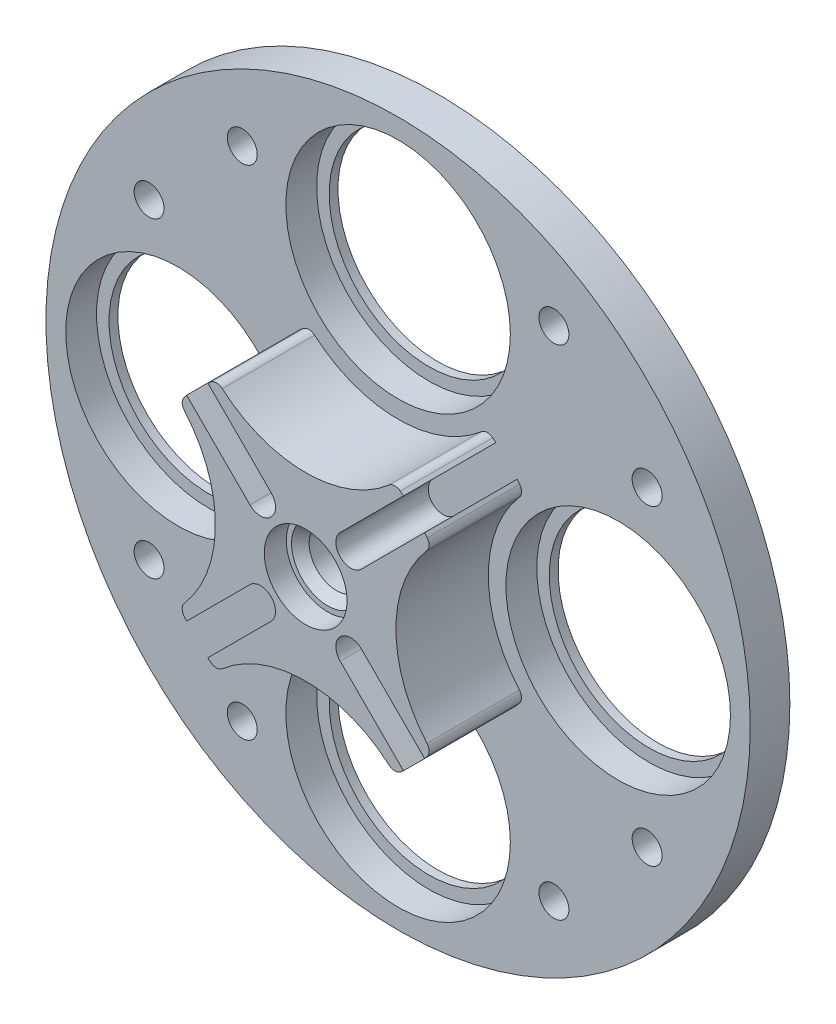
ISO-10303-21;
HEADER;
FILE_DESCRIPTION(('STEP AP214'),'2;1');
FILE_NAME('part.step','',(''),(''),'','','');
FILE_SCHEMA(('AUTOMOTIVE_DESIGN { 1 0 10303 214 1 1 1 1 }'));
ENDSEC;
DATA;
#1=APPLICATION_CONTEXT('core data for automotive mechanical design processes');
#2=APPLICATION_PROTOCOL_DEFINITION('international standard','automotive_design',2000,#1);
#3=PRODUCT_CONTEXT('',#1,'mechanical');
#4=PRODUCT('Part','Part','',(#3));
#5=PRODUCT_RELATED_PRODUCT_CATEGORY('part','',(#4));
#6=PRODUCT_DEFINITION_FORMATION('','',#4);
#7=PRODUCT_DEFINITION_CONTEXT('part definition',#1,'design');
#8=PRODUCT_DEFINITION('design','',#6,#7);
#9=PRODUCT_DEFINITION_SHAPE('','',#8);
#10=(LENGTH_UNIT() NAMED_UNIT(*) SI_UNIT(.MILLI.,.METRE.));
#11=(NAMED_UNIT(*) PLANE_ANGLE_UNIT() SI_UNIT($,.RADIAN.));
#12=(NAMED_UNIT(*) SI_UNIT($,.STERADIAN.) SOLID_ANGLE_UNIT());
#13=UNCERTAINTY_MEASURE_WITH_UNIT(LENGTH_MEASURE(1.E-05),#10,'distance_accuracy_value','');
#14=(GEOMETRIC_REPRESENTATION_CONTEXT(3) GLOBAL_UNCERTAINTY_ASSIGNED_CONTEXT((#13)) GLOBAL_UNIT_ASSIGNED_CONTEXT((#10,
#11,#12)) REPRESENTATION_CONTEXT('',''));
#15=CARTESIAN_POINT('',(0.,0.,0.));
#16=DIRECTION('',(0.,0.,1.));
#17=DIRECTION('',(1.,0.,0.));
#18=AXIS2_PLACEMENT_3D('',#15,#16,#17);
#19=CARTESIAN_POINT('',(17.6978406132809,28.2842712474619,1.));
#20=DIRECTION('',(0.,0.,-1.));
#21=DIRECTION('',(-1.,0.,0.));
#22=AXIS2_PLACEMENT_3D('',#19,#20,#21);
#23=CYLINDRICAL_SURFACE('',#22,1.7);
#24=CARTESIAN_POINT('',(17.6978406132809,28.2842712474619,4.5));
#25=DIRECTION('',(0.,0.,1.));
#26=DIRECTION('',(1.,0.,0.));
#27=AXIS2_PLACEMENT_3D('',#24,#25,#26);
#28=CIRCLE('',#27,1.7);
#29=CARTESIAN_POINT('',(19.3978406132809,28.2842712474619,4.5));
#30=VERTEX_POINT('',#29);
#31=EDGE_CURVE('E1111',#30,#30,#28,.T.);
#32=ORIENTED_EDGE('',*,*,#31,.T.);
#33=EDGE_LOOP('',(#32));
#34=FACE_BOUND('',#33,.T.);
#35=CARTESIAN_POINT('',(17.6978406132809,28.2842712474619,2.1));
#36=DIRECTION('',(0.,0.,-1.));
#37=DIRECTION('',(-1.,0.,0.));
#38=AXIS2_PLACEMENT_3D('',#35,#36,#37);
#39=CIRCLE('',#38,1.7);
#40=CARTESIAN_POINT('',(15.9978406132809,28.2842712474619,2.1));
#41=VERTEX_POINT('',#40);
#42=EDGE_CURVE('E931',#41,#41,#39,.T.);
#43=ORIENTED_EDGE('',*,*,#42,.T.);
#44=EDGE_LOOP('',(#43));
#45=FACE_BOUND('',#44,.T.);
#46=ADVANCED_FACE('F44',(#34,#45),#23,.F.);
#47=CARTESIAN_POINT('',(-17.6978406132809,28.2842712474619,1.));
#48=DIRECTION('',(0.,0.,-1.));
#49=DIRECTION('',(-1.,0.,0.));
#50=AXIS2_PLACEMENT_3D('',#47,#48,#49);
#51=CYLINDRICAL_SURFACE('',#50,1.7);
#52=CARTESIAN_POINT('',(-17.6978406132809,28.2842712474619,4.5));
#53=DIRECTION('',(0.,0.,1.));
#54=DIRECTION('',(1.,0.,0.));
#55=AXIS2_PLACEMENT_3D('',#52,#53,#54);
#56=CIRCLE('',#55,1.7);
#57=CARTESIAN_POINT('',(-15.9978406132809,28.2842712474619,4.5));
#58=VERTEX_POINT('',#57);
#59=EDGE_CURVE('E1108',#58,#58,#56,.T.);
#60=ORIENTED_EDGE('',*,*,#59,.T.);
#61=EDGE_LOOP('',(#60));
#62=FACE_BOUND('',#61,.T.);
#63=CARTESIAN_POINT('',(-17.6978406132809,28.2842712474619,2.1));
#64=DIRECTION('',(0.,0.,-1.));
#65=DIRECTION('',(-1.,0.,0.));
#66=AXIS2_PLACEMENT_3D('',#63,#64,#65);
#67=CIRCLE('',#66,1.7);
#68=CARTESIAN_POINT('',(-19.3978406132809,28.2842712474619,2.1));
#69=VERTEX_POINT('',#68);
#70=EDGE_CURVE('E1195',#69,#69,#67,.T.);
#71=ORIENTED_EDGE('',*,*,#70,.T.);
#72=EDGE_LOOP('',(#71));
#73=FACE_BOUND('',#72,.T.);
#74=ADVANCED_FACE('F1328',(#62,#73),#51,.F.);
#75=CARTESIAN_POINT('',(28.2842712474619,-17.6978406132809,1.));
#76=DIRECTION('',(0.,0.,-1.));
#77=DIRECTION('',(-1.,0.,0.));
#78=AXIS2_PLACEMENT_3D('',#75,#76,#77);
#79=CYLINDRICAL_SURFACE('',#78,1.7);
#80=CARTESIAN_POINT('',(28.2842712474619,-17.6978406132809,4.5));
#81=DIRECTION('',(0.,0.,1.));
#82=DIRECTION('',(1.,0.,0.));
#83=AXIS2_PLACEMENT_3D('',#80,#81,#82);
#84=CIRCLE('',#83,1.7);
#85=CARTESIAN_POINT('',(29.9842712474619,-17.6978406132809,4.5));
#86=VERTEX_POINT('',#85);
#87=EDGE_CURVE('E1105',#86,#86,#84,.T.);
#88=ORIENTED_EDGE('',*,*,#87,.T.);
#89=EDGE_LOOP('',(#88));
#90=FACE_BOUND('',#89,.T.);
#91=CARTESIAN_POINT('',(28.2842712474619,-17.6978406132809,2.1));
#92=DIRECTION('',(0.,0.,-1.));
#93=DIRECTION('',(-1.,0.,0.));
#94=AXIS2_PLACEMENT_3D('',#91,#92,#93);
#95=CIRCLE('',#94,1.7);
#96=CARTESIAN_POINT('',(26.5842712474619,-17.6978406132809,2.1));
#97=VERTEX_POINT('',#96);
#98=EDGE_CURVE('E1192',#97,#97,#95,.T.);
#99=ORIENTED_EDGE('',*,*,#98,.T.);
#100=EDGE_LOOP('',(#99));
#101=FACE_BOUND('',#100,.T.);
#102=ADVANCED_FACE('F1335',(#90,#101),#79,.F.);
#103=CARTESIAN_POINT('',(28.2842712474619,17.6978406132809,1.));
#104=DIRECTION('',(0.,0.,-1.));
#105=DIRECTION('',(-1.,0.,0.));
#106=AXIS2_PLACEMENT_3D('',#103,#104,#105);
#107=CYLINDRICAL_SURFACE('',#106,1.7);
#108=CARTESIAN_POINT('',(28.2842712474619,17.6978406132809,4.5));
#109=DIRECTION('',(0.,0.,1.));
#110=DIRECTION('',(1.,0.,0.));
#111=AXIS2_PLACEMENT_3D('',#108,#109,#110);
#112=CIRCLE('',#111,1.7);
#113=CARTESIAN_POINT('',(29.9842712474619,17.6978406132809,4.5));
#114=VERTEX_POINT('',#113);
#115=EDGE_CURVE('E1102',#114,#114,#112,.T.);
#116=ORIENTED_EDGE('',*,*,#115,.T.);
#117=EDGE_LOOP('',(#116));
#118=FACE_BOUND('',#117,.T.);
#119=CARTESIAN_POINT('',(28.2842712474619,17.6978406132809,2.1));
#120=DIRECTION('',(0.,0.,-1.));
#121=DIRECTION('',(-1.,0.,0.));
#122=AXIS2_PLACEMENT_3D('',#119,#120,#121);
#123=CIRCLE('',#122,1.7);
#124=CARTESIAN_POINT('',(26.5842712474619,17.6978406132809,2.1));
#125=VERTEX_POINT('',#124);
#126=EDGE_CURVE('E1189',#125,#125,#123,.T.);
#127=ORIENTED_EDGE('',*,*,#126,.T.);
#128=EDGE_LOOP('',(#127));
#129=FACE_BOUND('',#128,.T.);
#130=ADVANCED_FACE('F1952',(#118,#129),#107,.F.);
#131=CARTESIAN_POINT('',(-17.6978406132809,-28.2842712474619,1.));
#132=DIRECTION('',(0.,0.,-1.));
#133=DIRECTION('',(-1.,0.,0.));
#134=AXIS2_PLACEMENT_3D('',#131,#132,#133);
#135=CYLINDRICAL_SURFACE('',#134,1.7);
#136=CARTESIAN_POINT('',(-17.6978406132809,-28.2842712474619,4.5));
#137=DIRECTION('',(0.,0.,1.));
#138=DIRECTION('',(1.,0.,0.));
#139=AXIS2_PLACEMENT_3D('',#136,#137,#138);
#140=CIRCLE('',#139,1.7);
#141=CARTESIAN_POINT('',(-15.9978406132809,-28.2842712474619,4.5));
#142=VERTEX_POINT('',#141);
#143=EDGE_CURVE('E1099',#142,#142,#140,.T.);
#144=ORIENTED_EDGE('',*,*,#143,.T.);
#145=EDGE_LOOP('',(#144));
#146=FACE_BOUND('',#145,.T.);
#147=CARTESIAN_POINT('',(-17.6978406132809,-28.2842712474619,2.1));
#148=DIRECTION('',(0.,0.,-1.));
#149=DIRECTION('',(-1.,0.,0.));
#150=AXIS2_PLACEMENT_3D('',#147,#148,#149);
#151=CIRCLE('',#150,1.7);
#152=CARTESIAN_POINT('',(-19.3978406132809,-28.2842712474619,2.1));
#153=VERTEX_POINT('',#152);
#154=EDGE_CURVE('E1186',#153,#153,#151,.T.);
#155=ORIENTED_EDGE('',*,*,#154,.T.);
#156=EDGE_LOOP('',(#155));
#157=FACE_BOUND('',#156,.T.);
#158=ADVANCED_FACE('F1963',(#146,#157),#135,.F.);
#159=CARTESIAN_POINT('',(17.6978406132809,-28.2842712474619,1.));
#160=DIRECTION('',(0.,0.,-1.));
#161=DIRECTION('',(-1.,0.,0.));
#162=AXIS2_PLACEMENT_3D('',#159,#160,#161);
#163=CYLINDRICAL_SURFACE('',#162,1.7);
#164=CARTESIAN_POINT('',(17.6978406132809,-28.2842712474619,4.5));
#165=DIRECTION('',(0.,0.,1.));
#166=DIRECTION('',(1.,0.,0.));
#167=AXIS2_PLACEMENT_3D('',#164,#165,#166);
#168=CIRCLE('',#167,1.7);
#169=CARTESIAN_POINT('',(19.3978406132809,-28.2842712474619,4.5));
#170=VERTEX_POINT('',#169);
#171=EDGE_CURVE('E1096',#170,#170,#168,.T.);
#172=ORIENTED_EDGE('',*,*,#171,.T.);
#173=EDGE_LOOP('',(#172));
#174=FACE_BOUND('',#173,.T.);
#175=CARTESIAN_POINT('',(17.6978406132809,-28.2842712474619,2.1));
#176=DIRECTION('',(0.,0.,-1.));
#177=DIRECTION('',(-1.,0.,0.));
#178=AXIS2_PLACEMENT_3D('',#175,#176,#177);
#179=CIRCLE('',#178,1.7);
#180=CARTESIAN_POINT('',(15.9978406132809,-28.2842712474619,2.1));
#181=VERTEX_POINT('',#180);
#182=EDGE_CURVE('E1183',#181,#181,#179,.T.);
#183=ORIENTED_EDGE('',*,*,#182,.T.);
#184=EDGE_LOOP('',(#183));
#185=FACE_BOUND('',#184,.T.);
#186=ADVANCED_FACE('F1974',(#174,#185),#163,.F.);
#187=CARTESIAN_POINT('',(-28.2842712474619,17.6978406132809,1.));
#188=DIRECTION('',(0.,0.,-1.));
#189=DIRECTION('',(-1.,0.,0.));
#190=AXIS2_PLACEMENT_3D('',#187,#188,#189);
#191=CYLINDRICAL_SURFACE('',#190,1.7);
#192=CARTESIAN_POINT('',(-28.2842712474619,17.6978406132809,4.5));
#193=DIRECTION('',(0.,0.,1.));
#194=DIRECTION('',(1.,0.,0.));
#195=AXIS2_PLACEMENT_3D('',#192,#193,#194);
#196=CIRCLE('',#195,1.7);
#197=CARTESIAN_POINT('',(-26.5842712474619,17.6978406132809,4.5));
#198=VERTEX_POINT('',#197);
#199=EDGE_CURVE('E1093',#198,#198,#196,.T.);
#200=ORIENTED_EDGE('',*,*,#199,.T.);
#201=EDGE_LOOP('',(#200));
#202=FACE_BOUND('',#201,.T.);
#203=CARTESIAN_POINT('',(-28.2842712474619,17.6978406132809,2.1));
#204=DIRECTION('',(0.,0.,-1.));
#205=DIRECTION('',(-1.,0.,0.));
#206=AXIS2_PLACEMENT_3D('',#203,#204,#205);
#207=CIRCLE('',#206,1.7);
#208=CARTESIAN_POINT('',(-29.9842712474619,17.6978406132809,2.1));
#209=VERTEX_POINT('',#208);
#210=EDGE_CURVE('E1180',#209,#209,#207,.T.);
#211=ORIENTED_EDGE('',*,*,#210,.T.);
#212=EDGE_LOOP('',(#211));
#213=FACE_BOUND('',#212,.T.);
#214=ADVANCED_FACE('F1985',(#202,#213),#191,.F.);
#215=CARTESIAN_POINT('',(-28.2842712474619,-17.6978406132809,1.));
#216=DIRECTION('',(0.,0.,-1.));
#217=DIRECTION('',(-1.,0.,0.));
#218=AXIS2_PLACEMENT_3D('',#215,#216,#217);
#219=CYLINDRICAL_SURFACE('',#218,1.7);
#220=CARTESIAN_POINT('',(-28.2842712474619,-17.6978406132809,4.5));
#221=DIRECTION('',(0.,0.,1.));
#222=DIRECTION('',(1.,0.,0.));
#223=AXIS2_PLACEMENT_3D('',#220,#221,#222);
#224=CIRCLE('',#223,1.7);
#225=CARTESIAN_POINT('',(-26.5842712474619,-17.6978406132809,4.5));
#226=VERTEX_POINT('',#225);
#227=EDGE_CURVE('E1090',#226,#226,#224,.T.);
#228=ORIENTED_EDGE('',*,*,#227,.T.);
#229=EDGE_LOOP('',(#228));
#230=FACE_BOUND('',#229,.T.);
#231=CARTESIAN_POINT('',(-28.2842712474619,-17.6978406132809,2.1));
#232=DIRECTION('',(0.,0.,-1.));
#233=DIRECTION('',(-1.,0.,0.));
#234=AXIS2_PLACEMENT_3D('',#231,#232,#233);
#235=CIRCLE('',#234,1.7);
#236=CARTESIAN_POINT('',(-29.9842712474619,-17.6978406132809,2.1));
#237=VERTEX_POINT('',#236);
#238=EDGE_CURVE('E913',#237,#237,#235,.T.);
#239=ORIENTED_EDGE('',*,*,#238,.T.);
#240=EDGE_LOOP('',(#239));
#241=FACE_BOUND('',#240,.T.);
#242=ADVANCED_FACE('F1346',(#230,#241),#219,.F.);
#243=CARTESIAN_POINT('',(0.,0.,1.));
#244=DIRECTION('',(0.,0.,-1.));
#245=DIRECTION('',(-1.,0.,0.));
#246=AXIS2_PLACEMENT_3D('',#243,#244,#245);
#247=CYLINDRICAL_SURFACE('',#246,3.1);
#248=CARTESIAN_POINT('',(0.,0.,11.5));
#249=DIRECTION('',(0.,0.,1.));
#250=DIRECTION('',(1.,0.,0.));
#251=AXIS2_PLACEMENT_3D('',#248,#249,#250);
#252=CIRCLE('',#251,3.1);
#253=CARTESIAN_POINT('',(3.1,0.,11.5));
#254=VERTEX_POINT('',#253);
#255=EDGE_CURVE('E1171',#254,#254,#252,.T.);
#256=ORIENTED_EDGE('',*,*,#255,.T.);
#257=EDGE_LOOP('',(#256));
#258=FACE_BOUND('',#257,.T.);
#259=CARTESIAN_POINT('',(0.,0.,0.));
#260=DIRECTION('',(0.,0.,1.));
#261=DIRECTION('',(1.,0.,0.));
#262=AXIS2_PLACEMENT_3D('',#259,#260,#261);
#263=CIRCLE('',#262,3.1);
#264=CARTESIAN_POINT('',(3.1,0.,0.));
#265=VERTEX_POINT('',#264);
#266=EDGE_CURVE('E1157',#265,#265,#263,.T.);
#267=ORIENTED_EDGE('',*,*,#266,.F.);
#268=EDGE_LOOP('',(#267));
#269=FACE_BOUND('',#268,.T.);
#270=ADVANCED_FACE('F1343',(#258,#269),#247,.F.);
#271=CARTESIAN_POINT('',(0.,0.,4.5));
#272=DIRECTION('',(0.,0.,1.));
#273=DIRECTION('',(1.,0.,0.));
#274=AXIS2_PLACEMENT_3D('',#271,#272,#273);
#275=PLANE('',#274);
#276=ORIENTED_EDGE('',*,*,#227,.F.);
#277=EDGE_LOOP('',(#276));
#278=FACE_BOUND('',#277,.T.);
#279=ORIENTED_EDGE('',*,*,#171,.F.);
#280=EDGE_LOOP('',(#279));
#281=FACE_BOUND('',#280,.T.);
#282=ORIENTED_EDGE('',*,*,#115,.F.);
#283=EDGE_LOOP('',(#282));
#284=FACE_BOUND('',#283,.T.);
#285=ORIENTED_EDGE('',*,*,#59,.F.);
#286=EDGE_LOOP('',(#285));
#287=FACE_BOUND('',#286,.T.);
#288=CARTESIAN_POINT('',(0.,-25.,4.5));
#289=DIRECTION('',(0.,0.,1.));
#290=DIRECTION('',(1.,0.,0.));
#291=AXIS2_PLACEMENT_3D('',#288,#289,#290);
#292=CIRCLE('',#291,12.75);
#293=CARTESIAN_POINT('',(12.75,-25.,4.5));
#294=VERTEX_POINT('',#293);
#295=EDGE_CURVE('E1121',#294,#294,#292,.T.);
#296=ORIENTED_EDGE('',*,*,#295,.F.);
#297=EDGE_LOOP('',(#296));
#298=FACE_BOUND('',#297,.T.);
#299=CARTESIAN_POINT('',(0.,25.,4.5));
#300=DIRECTION('',(0.,0.,1.));
#301=DIRECTION('',(1.,0.,0.));
#302=AXIS2_PLACEMENT_3D('',#299,#300,#301);
#303=CIRCLE('',#302,12.75);
#304=CARTESIAN_POINT('',(12.75,25.,4.5));
#305=VERTEX_POINT('',#304);
#306=EDGE_CURVE('E1133',#305,#305,#303,.T.);
#307=ORIENTED_EDGE('',*,*,#306,.F.);
#308=EDGE_LOOP('',(#307));
#309=FACE_BOUND('',#308,.T.);
#310=CARTESIAN_POINT('',(0.,0.,4.5));
#311=DIRECTION('',(0.,0.,1.));
#312=DIRECTION('',(1.,0.,0.));
#313=AXIS2_PLACEMENT_3D('',#310,#311,#312);
#314=CIRCLE('',#313,40.);
#315=CARTESIAN_POINT('',(40.,0.,4.5));
#316=VERTEX_POINT('',#315);
#317=EDGE_CURVE('E1136',#316,#316,#314,.T.);
#318=ORIENTED_EDGE('',*,*,#317,.T.);
#319=EDGE_LOOP('',(#318));
#320=FACE_BOUND('',#319,.T.);
#321=CARTESIAN_POINT('',(25.,0.,4.5));
#322=DIRECTION('',(0.,0.,1.));
#323=DIRECTION('',(1.,0.,0.));
#324=AXIS2_PLACEMENT_3D('',#321,#322,#323);
#325=CIRCLE('',#324,12.75);
#326=CARTESIAN_POINT('',(37.75,0.,4.5));
#327=VERTEX_POINT('',#326);
#328=EDGE_CURVE('E1127',#327,#327,#325,.T.);
#329=ORIENTED_EDGE('',*,*,#328,.F.);
#330=EDGE_LOOP('',(#329));
#331=FACE_BOUND('',#330,.T.);
#332=CARTESIAN_POINT('',(-25.,0.,4.5));
#333=DIRECTION('',(0.,0.,1.));
#334=DIRECTION('',(1.,0.,0.));
#335=AXIS2_PLACEMENT_3D('',#332,#333,#334);
#336=CIRCLE('',#335,12.75);
#337=CARTESIAN_POINT('',(-12.25,0.,4.5));
#338=VERTEX_POINT('',#337);
#339=EDGE_CURVE('E1115',#338,#338,#336,.T.);
#340=ORIENTED_EDGE('',*,*,#339,.F.);
#341=EDGE_LOOP('',(#340));
#342=FACE_BOUND('',#341,.T.);
#343=ORIENTED_EDGE('',*,*,#31,.F.);
#344=EDGE_LOOP('',(#343));
#345=FACE_BOUND('',#344,.T.);
#346=ORIENTED_EDGE('',*,*,#87,.F.);
#347=EDGE_LOOP('',(#346));
#348=FACE_BOUND('',#347,.T.);
#349=ORIENTED_EDGE('',*,*,#143,.F.);
#350=EDGE_LOOP('',(#349));
#351=FACE_BOUND('',#350,.T.);
#352=ORIENTED_EDGE('',*,*,#199,.F.);
#353=EDGE_LOOP('',(#352));
#354=FACE_BOUND('',#353,.T.);
#355=CARTESIAN_POINT('',(24.7487373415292,0.,4.5));
#356=DIRECTION('',(0.,0.,-1.));
#357=DIRECTION('',(1.,0.,0.));
#358=AXIS2_PLACEMENT_3D('',#355,#356,#357);
#359=CIRCLE('',#358,14.5);
#360=CARTESIAN_POINT('',(13.7775031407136,-9.48061285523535,4.5));
#361=VERTEX_POINT('',#360);
#362=CARTESIAN_POINT('',(13.7775031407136,9.48061285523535,4.5));
#363=VERTEX_POINT('',#362);
#364=EDGE_CURVE('E991',#361,#363,#359,.T.);
#365=ORIENTED_EDGE('',*,*,#364,.F.);
#366=CARTESIAN_POINT('',(13.020866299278,-10.1344482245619,4.5));
#367=DIRECTION('',(0.,0.,1.));
#368=DIRECTION('',(1.,0.,0.));
#369=AXIS2_PLACEMENT_3D('',#366,#367,#368);
#370=CIRCLE('',#369,1.);
#371=CARTESIAN_POINT('',(13.8100097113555,-10.7486572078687,4.5));
#372=VERTEX_POINT('',#371);
#373=EDGE_CURVE('E52',#361,#372,#370,.F.);
#374=ORIENTED_EDGE('',*,*,#373,.T.);
#375=CARTESIAN_POINT('',(0.,0.,4.5));
#376=DIRECTION('',(0.,0.,1.));
#377=DIRECTION('',(1.,0.,0.));
#378=AXIS2_PLACEMENT_3D('',#375,#376,#377);
#379=CIRCLE('',#378,17.5);
#380=CARTESIAN_POINT('',(13.5179249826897,-11.1137619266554,4.5));
#381=VERTEX_POINT('',#380);
#382=EDGE_CURVE('E927',#381,#372,#379,.T.);
#383=ORIENTED_EDGE('',*,*,#382,.F.);
#384=DIRECTION('',(0.707106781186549,-0.707106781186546,0.));
#385=VECTOR('',#384,1.);
#386=CARTESIAN_POINT('',(13.5179249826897,-11.1137619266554,4.5));
#387=LINE('',#386,#385);
#388=CARTESIAN_POINT('',(6.32771285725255,-3.92354980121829,4.5));
#389=VERTEX_POINT('',#388);
#390=EDGE_CURVE('E936',#389,#381,#387,.T.);
#391=ORIENTED_EDGE('',*,*,#390,.F.);
#392=CARTESIAN_POINT('',(5.12563132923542,-5.12563132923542,4.5));
#393=DIRECTION('',(0.,0.,-1.));
#394=DIRECTION('',(1.,0.,0.));
#395=AXIS2_PLACEMENT_3D('',#392,#393,#394);
#396=CIRCLE('',#395,1.7);
#397=CARTESIAN_POINT('',(3.92354980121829,-6.32771285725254,4.5));
#398=VERTEX_POINT('',#397);
#399=EDGE_CURVE('E1040',#398,#389,#396,.T.);
#400=ORIENTED_EDGE('',*,*,#399,.F.);
#401=DIRECTION('',(-0.707106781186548,0.707106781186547,0.));
#402=VECTOR('',#401,1.);
#403=CARTESIAN_POINT('',(11.1137619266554,-13.5179249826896,4.5));
#404=LINE('',#403,#402);
#405=CARTESIAN_POINT('',(11.1137619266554,-13.5179249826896,4.5));
#406=VERTEX_POINT('',#405);
#407=EDGE_CURVE('E1038',#406,#398,#404,.T.);
#408=ORIENTED_EDGE('',*,*,#407,.F.);
#409=CARTESIAN_POINT('',(0.,0.,4.5));
#410=DIRECTION('',(0.,0.,1.));
#411=DIRECTION('',(1.,0.,0.));
#412=AXIS2_PLACEMENT_3D('',#409,#410,#411);
#413=CIRCLE('',#412,17.5);
#414=CARTESIAN_POINT('',(10.7486572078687,-13.8100097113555,4.5));
#415=VERTEX_POINT('',#414);
#416=EDGE_CURVE('E1036',#415,#406,#413,.T.);
#417=ORIENTED_EDGE('',*,*,#416,.F.);
#418=CARTESIAN_POINT('',(10.1344482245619,-13.020866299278,4.5));
#419=DIRECTION('',(0.,0.,1.));
#420=DIRECTION('',(1.,0.,0.));
#421=AXIS2_PLACEMENT_3D('',#418,#419,#420);
#422=CIRCLE('',#421,1.);
#423=CARTESIAN_POINT('',(9.48061285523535,-13.7775031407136,4.5));
#424=VERTEX_POINT('',#423);
#425=EDGE_CURVE('E1264',#415,#424,#422,.F.);
#426=ORIENTED_EDGE('',*,*,#425,.T.);
#427=CARTESIAN_POINT('',(0.,-24.7487373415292,4.5));
#428=DIRECTION('',(0.,0.,-1.));
#429=DIRECTION('',(1.,0.,0.));
#430=AXIS2_PLACEMENT_3D('',#427,#428,#429);
#431=CIRCLE('',#430,14.5);
#432=CARTESIAN_POINT('',(-9.48061285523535,-13.7775031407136,4.5));
#433=VERTEX_POINT('',#432);
#434=EDGE_CURVE('E1033',#433,#424,#431,.T.);
#435=ORIENTED_EDGE('',*,*,#434,.F.);
#436=CARTESIAN_POINT('',(-10.1344482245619,-13.020866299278,4.5));
#437=DIRECTION('',(0.,0.,1.));
#438=DIRECTION('',(1.,0.,0.));
#439=AXIS2_PLACEMENT_3D('',#436,#437,#438);
#440=CIRCLE('',#439,1.);
#441=CARTESIAN_POINT('',(-10.7486572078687,-13.8100097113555,4.5));
#442=VERTEX_POINT('',#441);
#443=EDGE_CURVE('E1262',#433,#442,#440,.F.);
#444=ORIENTED_EDGE('',*,*,#443,.T.);
#445=CARTESIAN_POINT('',(0.,0.,4.5));
#446=DIRECTION('',(0.,0.,1.));
#447=DIRECTION('',(1.,0.,0.));
#448=AXIS2_PLACEMENT_3D('',#445,#446,#447);
#449=CIRCLE('',#448,17.5);
#450=CARTESIAN_POINT('',(-11.1137619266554,-13.5179249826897,4.5));
#451=VERTEX_POINT('',#450);
#452=EDGE_CURVE('E1030',#451,#442,#449,.T.);
#453=ORIENTED_EDGE('',*,*,#452,.F.);
#454=DIRECTION('',(-0.707106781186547,-0.707106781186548,0.));
#455=VECTOR('',#454,1.);
#456=CARTESIAN_POINT('',(-11.1137619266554,-13.5179249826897,4.5));
#457=LINE('',#456,#455);
#458=CARTESIAN_POINT('',(-3.92354980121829,-6.32771285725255,4.5));
#459=VERTEX_POINT('',#458);
#460=EDGE_CURVE('E1028',#459,#451,#457,.T.);
#461=ORIENTED_EDGE('',*,*,#460,.F.);
#462=CARTESIAN_POINT('',(-5.12563132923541,-5.12563132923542,4.5));
#463=DIRECTION('',(0.,0.,-1.));
#464=DIRECTION('',(1.,0.,0.));
#465=AXIS2_PLACEMENT_3D('',#462,#463,#464);
#466=CIRCLE('',#465,1.7);
#467=CARTESIAN_POINT('',(-6.32771285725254,-3.92354980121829,4.5));
#468=VERTEX_POINT('',#467);
#469=EDGE_CURVE('E1026',#468,#459,#466,.T.);
#470=ORIENTED_EDGE('',*,*,#469,.F.);
#471=DIRECTION('',(0.707106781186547,0.707106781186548,0.));
#472=VECTOR('',#471,1.);
#473=CARTESIAN_POINT('',(-13.5179249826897,-11.1137619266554,4.5));
#474=LINE('',#473,#472);
#475=CARTESIAN_POINT('',(-13.5179249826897,-11.1137619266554,4.5));
#476=VERTEX_POINT('',#475);
#477=EDGE_CURVE('E1024',#476,#468,#474,.T.);
#478=ORIENTED_EDGE('',*,*,#477,.F.);
#479=CARTESIAN_POINT('',(0.,0.,4.5));
#480=DIRECTION('',(0.,0.,1.));
#481=DIRECTION('',(1.,0.,0.));
#482=AXIS2_PLACEMENT_3D('',#479,#480,#481);
#483=CIRCLE('',#482,17.5);
#484=CARTESIAN_POINT('',(-13.8100097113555,-10.7486572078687,4.5));
#485=VERTEX_POINT('',#484);
#486=EDGE_CURVE('E1022',#485,#476,#483,.T.);
#487=ORIENTED_EDGE('',*,*,#486,.F.);
#488=CARTESIAN_POINT('',(-13.020866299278,-10.1344482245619,4.5));
#489=DIRECTION('',(0.,0.,1.));
#490=DIRECTION('',(1.,0.,0.));
#491=AXIS2_PLACEMENT_3D('',#488,#489,#490);
#492=CIRCLE('',#491,1.);
#493=CARTESIAN_POINT('',(-13.7775031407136,-9.48061285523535,4.5));
#494=VERTEX_POINT('',#493);
#495=EDGE_CURVE('E1260',#485,#494,#492,.F.);
#496=ORIENTED_EDGE('',*,*,#495,.T.);
#497=CARTESIAN_POINT('',(-24.7487373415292,0.,4.5));
#498=DIRECTION('',(0.,0.,-1.));
#499=DIRECTION('',(1.,0.,0.));
#500=AXIS2_PLACEMENT_3D('',#497,#498,#499);
#501=CIRCLE('',#500,14.5);
#502=CARTESIAN_POINT('',(-13.7775031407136,9.48061285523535,4.5));
#503=VERTEX_POINT('',#502);
#504=EDGE_CURVE('E1019',#503,#494,#501,.T.);
#505=ORIENTED_EDGE('',*,*,#504,.F.);
#506=CARTESIAN_POINT('',(-13.020866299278,10.1344482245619,4.5));
#507=DIRECTION('',(0.,0.,1.));
#508=DIRECTION('',(1.,0.,0.));
#509=AXIS2_PLACEMENT_3D('',#506,#507,#508);
#510=CIRCLE('',#509,1.);
#511=CARTESIAN_POINT('',(-13.8100097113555,10.7486572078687,4.5));
#512=VERTEX_POINT('',#511);
#513=EDGE_CURVE('E1258',#503,#512,#510,.F.);
#514=ORIENTED_EDGE('',*,*,#513,.T.);
#515=CARTESIAN_POINT('',(0.,0.,4.5));
#516=DIRECTION('',(0.,0.,1.));
#517=DIRECTION('',(1.,0.,0.));
#518=AXIS2_PLACEMENT_3D('',#515,#516,#517);
#519=CIRCLE('',#518,17.5);
#520=CARTESIAN_POINT('',(-13.5179249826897,11.1137619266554,4.5));
#521=VERTEX_POINT('',#520);
#522=EDGE_CURVE('E1016',#521,#512,#519,.T.);
#523=ORIENTED_EDGE('',*,*,#522,.F.);
#524=DIRECTION('',(-0.707106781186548,0.707106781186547,0.));
#525=VECTOR('',#524,1.);
#526=CARTESIAN_POINT('',(-13.5179249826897,11.1137619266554,4.5));
#527=LINE('',#526,#525);
#528=CARTESIAN_POINT('',(-6.32771285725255,3.92354980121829,4.5));
#529=VERTEX_POINT('',#528);
#530=EDGE_CURVE('E1014',#529,#521,#527,.T.);
#531=ORIENTED_EDGE('',*,*,#530,.F.);
#532=CARTESIAN_POINT('',(-5.12563132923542,5.12563132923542,4.5));
#533=DIRECTION('',(0.,0.,-1.));
#534=DIRECTION('',(1.,0.,0.));
#535=AXIS2_PLACEMENT_3D('',#532,#533,#534);
#536=CIRCLE('',#535,1.7);
#537=CARTESIAN_POINT('',(-3.92354980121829,6.32771285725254,4.5));
#538=VERTEX_POINT('',#537);
#539=EDGE_CURVE('E1012',#538,#529,#536,.T.);
#540=ORIENTED_EDGE('',*,*,#539,.F.);
#541=DIRECTION('',(0.707106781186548,-0.707106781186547,0.));
#542=VECTOR('',#541,1.);
#543=CARTESIAN_POINT('',(-11.1137619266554,13.5179249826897,4.5));
#544=LINE('',#543,#542);
#545=CARTESIAN_POINT('',(-11.1137619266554,13.5179249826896,4.5));
#546=VERTEX_POINT('',#545);
#547=EDGE_CURVE('E1010',#546,#538,#544,.T.);
#548=ORIENTED_EDGE('',*,*,#547,.F.);
#549=CARTESIAN_POINT('',(0.,0.,4.5));
#550=DIRECTION('',(0.,0.,1.));
#551=DIRECTION('',(1.,0.,0.));
#552=AXIS2_PLACEMENT_3D('',#549,#550,#551);
#553=CIRCLE('',#552,17.5);
#554=CARTESIAN_POINT('',(-10.7486572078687,13.8100097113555,4.5));
#555=VERTEX_POINT('',#554);
#556=EDGE_CURVE('E1008',#555,#546,#553,.T.);
#557=ORIENTED_EDGE('',*,*,#556,.F.);
#558=CARTESIAN_POINT('',(-10.1344482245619,13.020866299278,4.5));
#559=DIRECTION('',(0.,0.,1.));
#560=DIRECTION('',(1.,0.,0.));
#561=AXIS2_PLACEMENT_3D('',#558,#559,#560);
#562=CIRCLE('',#561,1.);
#563=CARTESIAN_POINT('',(-9.48061285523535,13.7775031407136,4.5));
#564=VERTEX_POINT('',#563);
#565=EDGE_CURVE('E1256',#555,#564,#562,.F.);
#566=ORIENTED_EDGE('',*,*,#565,.T.);
#567=CARTESIAN_POINT('',(0.,24.7487373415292,4.5));
#568=DIRECTION('',(0.,0.,-1.));
#569=DIRECTION('',(1.,0.,0.));
#570=AXIS2_PLACEMENT_3D('',#567,#568,#569);
#571=CIRCLE('',#570,14.5);
#572=CARTESIAN_POINT('',(9.48061285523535,13.7775031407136,4.5));
#573=VERTEX_POINT('',#572);
#574=EDGE_CURVE('E1005',#573,#564,#571,.T.);
#575=ORIENTED_EDGE('',*,*,#574,.F.);
#576=CARTESIAN_POINT('',(10.1344482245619,13.020866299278,4.5));
#577=DIRECTION('',(0.,0.,1.));
#578=DIRECTION('',(1.,0.,0.));
#579=AXIS2_PLACEMENT_3D('',#576,#577,#578);
#580=CIRCLE('',#579,1.);
#581=CARTESIAN_POINT('',(10.7486572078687,13.8100097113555,4.5));
#582=VERTEX_POINT('',#581);
#583=EDGE_CURVE('E1254',#573,#582,#580,.F.);
#584=ORIENTED_EDGE('',*,*,#583,.T.);
#585=CARTESIAN_POINT('',(0.,0.,4.5));
#586=DIRECTION('',(0.,0.,1.));
#587=DIRECTION('',(1.,0.,0.));
#588=AXIS2_PLACEMENT_3D('',#585,#586,#587);
#589=CIRCLE('',#588,17.5);
#590=CARTESIAN_POINT('',(11.1137619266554,13.5179249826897,4.5));
#591=VERTEX_POINT('',#590);
#592=EDGE_CURVE('E1002',#591,#582,#589,.T.);
#593=ORIENTED_EDGE('',*,*,#592,.F.);
#594=DIRECTION('',(0.707106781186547,0.707106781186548,0.));
#595=VECTOR('',#594,1.);
#596=CARTESIAN_POINT('',(11.1137619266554,13.5179249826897,4.5));
#597=LINE('',#596,#595);
#598=CARTESIAN_POINT('',(3.92354980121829,6.32771285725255,4.5));
#599=VERTEX_POINT('',#598);
#600=EDGE_CURVE('E1000',#599,#591,#597,.T.);
#601=ORIENTED_EDGE('',*,*,#600,.F.);
#602=CARTESIAN_POINT('',(5.12563132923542,5.12563132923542,4.5));
#603=DIRECTION('',(0.,0.,-1.));
#604=DIRECTION('',(1.,0.,0.));
#605=AXIS2_PLACEMENT_3D('',#602,#603,#604);
#606=CIRCLE('',#605,1.7);
#607=CARTESIAN_POINT('',(6.32771285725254,3.92354980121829,4.5));
#608=VERTEX_POINT('',#607);
#609=EDGE_CURVE('E998',#608,#599,#606,.T.);
#610=ORIENTED_EDGE('',*,*,#609,.F.);
#611=DIRECTION('',(-0.707106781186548,-0.707106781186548,0.));
#612=VECTOR('',#611,1.);
#613=CARTESIAN_POINT('',(13.5179249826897,11.1137619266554,4.5));
#614=LINE('',#613,#612);
#615=CARTESIAN_POINT('',(13.5179249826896,11.1137619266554,4.5));
#616=VERTEX_POINT('',#615);
#617=EDGE_CURVE('E996',#616,#608,#614,.T.);
#618=ORIENTED_EDGE('',*,*,#617,.F.);
#619=CARTESIAN_POINT('',(0.,0.,4.5));
#620=DIRECTION('',(0.,0.,1.));
#621=DIRECTION('',(1.,0.,0.));
#622=AXIS2_PLACEMENT_3D('',#619,#620,#621);
#623=CIRCLE('',#622,17.5);
#624=CARTESIAN_POINT('',(13.8100097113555,10.7486572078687,4.5));
#625=VERTEX_POINT('',#624);
#626=EDGE_CURVE('E994',#625,#616,#623,.T.);
#627=ORIENTED_EDGE('',*,*,#626,.F.);
#628=CARTESIAN_POINT('',(13.020866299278,10.1344482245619,4.5));
#629=DIRECTION('',(0.,0.,1.));
#630=DIRECTION('',(1.,0.,0.));
#631=AXIS2_PLACEMENT_3D('',#628,#629,#630);
#632=CIRCLE('',#631,1.);
#633=EDGE_CURVE('E11',#625,#363,#632,.F.);
#634=ORIENTED_EDGE('',*,*,#633,.T.);
#635=EDGE_LOOP('',(#365,#374,#383,#391,#400,#408,#417,#426,#435,#444,#453,#461,#470,#478,#487,
#496,#505,#514,#523,#531,#540,#548,#557,#566,#575,#584,#593,#601,#610,#618,#627,#634));
#636=FACE_BOUND('',#635,.T.);
#637=ADVANCED_FACE('F1267',(#278,#281,#284,#287,#298,#309,#320,#331,#342,#345,#348,#351,#354,
#636),#275,.T.);
#638=CARTESIAN_POINT('',(0.,0.,1.));
#639=DIRECTION('',(0.,0.,1.));
#640=DIRECTION('',(1.,0.,0.));
#641=AXIS2_PLACEMENT_3D('',#638,#639,#640);
#642=PLANE('',#641);
#643=CARTESIAN_POINT('',(0.,25.,1.));
#644=DIRECTION('',(0.,0.,1.));
#645=DIRECTION('',(1.,0.,0.));
#646=AXIS2_PLACEMENT_3D('',#643,#644,#645);
#647=CIRCLE('',#646,11.33);
#648=CARTESIAN_POINT('',(11.33,25.,1.));
#649=VERTEX_POINT('',#648);
#650=EDGE_CURVE('E1163',#649,#649,#647,.T.);
#651=ORIENTED_EDGE('',*,*,#650,.F.);
#652=EDGE_LOOP('',(#651));
#653=FACE_BOUND('',#652,.T.);
#654=CARTESIAN_POINT('',(0.,25.,1.));
#655=DIRECTION('',(0.,0.,1.));
#656=DIRECTION('',(1.,0.,0.));
#657=AXIS2_PLACEMENT_3D('',#654,#655,#656);
#658=CIRCLE('',#657,12.75);
#659=CARTESIAN_POINT('',(12.75,25.,1.));
#660=VERTEX_POINT('',#659);
#661=EDGE_CURVE('E1130',#660,#660,#658,.T.);
#662=ORIENTED_EDGE('',*,*,#661,.T.);
#663=EDGE_LOOP('',(#662));
#664=FACE_BOUND('',#663,.T.);
#665=ADVANCED_FACE('F1353',(#653,#664),#642,.T.);
#666=CARTESIAN_POINT('',(25.,0.,1.));
#667=DIRECTION('',(0.,0.,1.));
#668=DIRECTION('',(1.,0.,0.));
#669=AXIS2_PLACEMENT_3D('',#666,#667,#668);
#670=CIRCLE('',#669,11.33);
#671=CARTESIAN_POINT('',(36.33,0.,1.));
#672=VERTEX_POINT('',#671);
#673=EDGE_CURVE('E1154',#672,#672,#670,.T.);
#674=ORIENTED_EDGE('',*,*,#673,.F.);
#675=EDGE_LOOP('',(#674));
#676=FACE_BOUND('',#675,.T.);
#677=CARTESIAN_POINT('',(25.,0.,1.));
#678=DIRECTION('',(0.,0.,1.));
#679=DIRECTION('',(1.,0.,0.));
#680=AXIS2_PLACEMENT_3D('',#677,#678,#679);
#681=CIRCLE('',#680,12.75);
#682=CARTESIAN_POINT('',(37.75,0.,1.));
#683=VERTEX_POINT('',#682);
#684=EDGE_CURVE('E1124',#683,#683,#681,.T.);
#685=ORIENTED_EDGE('',*,*,#684,.T.);
#686=EDGE_LOOP('',(#685));
#687=FACE_BOUND('',#686,.T.);
#688=ADVANCED_FACE('F1356',(#676,#687),#642,.T.);
#689=CARTESIAN_POINT('',(0.,-25.,1.));
#690=DIRECTION('',(0.,0.,1.));
#691=DIRECTION('',(1.,0.,0.));
#692=AXIS2_PLACEMENT_3D('',#689,#690,#691);
#693=CIRCLE('',#692,11.33);
#694=CARTESIAN_POINT('',(11.33,-25.,1.));
#695=VERTEX_POINT('',#694);
#696=EDGE_CURVE('E1148',#695,#695,#693,.T.);
#697=ORIENTED_EDGE('',*,*,#696,.F.);
#698=EDGE_LOOP('',(#697));
#699=FACE_BOUND('',#698,.T.);
#700=CARTESIAN_POINT('',(0.,-25.,1.));
#701=DIRECTION('',(0.,0.,1.));
#702=DIRECTION('',(1.,0.,0.));
#703=AXIS2_PLACEMENT_3D('',#700,#701,#702);
#704=CIRCLE('',#703,12.75);
#705=CARTESIAN_POINT('',(12.75,-25.,1.));
#706=VERTEX_POINT('',#705);
#707=EDGE_CURVE('E1118',#706,#706,#704,.T.);
#708=ORIENTED_EDGE('',*,*,#707,.T.);
#709=EDGE_LOOP('',(#708));
#710=FACE_BOUND('',#709,.T.);
#711=ADVANCED_FACE('F2306',(#699,#710),#642,.T.);
#712=CARTESIAN_POINT('',(-25.,0.,1.));
#713=DIRECTION('',(0.,0.,1.));
#714=DIRECTION('',(1.,0.,0.));
#715=AXIS2_PLACEMENT_3D('',#712,#713,#714);
#716=CIRCLE('',#715,11.33);
#717=CARTESIAN_POINT('',(-13.67,0.,1.));
#718=VERTEX_POINT('',#717);
#719=EDGE_CURVE('E1142',#718,#718,#716,.T.);
#720=ORIENTED_EDGE('',*,*,#719,.F.);
#721=EDGE_LOOP('',(#720));
#722=FACE_BOUND('',#721,.T.);
#723=CARTESIAN_POINT('',(-25.,0.,1.));
#724=DIRECTION('',(0.,0.,1.));
#725=DIRECTION('',(1.,0.,0.));
#726=AXIS2_PLACEMENT_3D('',#723,#724,#725);
#727=CIRCLE('',#726,12.75);
#728=CARTESIAN_POINT('',(-12.25,0.,1.));
#729=VERTEX_POINT('',#728);
#730=EDGE_CURVE('E1114',#729,#729,#727,.T.);
#731=ORIENTED_EDGE('',*,*,#730,.T.);
#732=EDGE_LOOP('',(#731));
#733=FACE_BOUND('',#732,.T.);
#734=ADVANCED_FACE('F1358',(#722,#733),#642,.T.);
#735=CARTESIAN_POINT('',(0.,0.,0.));
#736=DIRECTION('',(0.,0.,1.));
#737=DIRECTION('',(1.,0.,0.));
#738=AXIS2_PLACEMENT_3D('',#735,#736,#737);
#739=PLANE('',#738);
#740=DIRECTION('',(1.,0.,0.));
#741=VECTOR('',#740,1.);
#742=CARTESIAN_POINT('',(26.6388229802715,20.5478406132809,0.));
#743=LINE('',#742,#741);
#744=CARTESIAN_POINT('',(26.6388229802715,20.5478406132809,0.));
#745=VERTEX_POINT('',#744);
#746=CARTESIAN_POINT('',(29.9297195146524,20.5478406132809,0.));
#747=VERTEX_POINT('',#746);
#748=EDGE_CURVE('E858',#745,#747,#743,.T.);
#749=ORIENTED_EDGE('',*,*,#748,.F.);
#750=DIRECTION('',(0.5,0.866025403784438,0.));
#751=VECTOR('',#750,1.);
#752=CARTESIAN_POINT('',(24.9933747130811,17.6978406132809,0.));
#753=LINE('',#752,#751);
#754=CARTESIAN_POINT('',(24.9933747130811,17.6978406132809,0.));
#755=VERTEX_POINT('',#754);
#756=EDGE_CURVE('E797',#755,#745,#753,.T.);
#757=ORIENTED_EDGE('',*,*,#756,.F.);
#758=DIRECTION('',(-0.500000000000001,0.866025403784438,0.));
#759=VECTOR('',#758,1.);
#760=CARTESIAN_POINT('',(26.6388229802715,14.8478406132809,0.));
#761=LINE('',#760,#759);
#762=CARTESIAN_POINT('',(26.6388229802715,14.8478406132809,0.));
#763=VERTEX_POINT('',#762);
#764=EDGE_CURVE('E845',#763,#755,#761,.T.);
#765=ORIENTED_EDGE('',*,*,#764,.F.);
#766=DIRECTION('',(-1.,0.,0.));
#767=VECTOR('',#766,1.);
#768=CARTESIAN_POINT('',(29.9297195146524,14.8478406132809,0.));
#769=LINE('',#768,#767);
#770=CARTESIAN_POINT('',(29.9297195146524,14.8478406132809,0.));
#771=VERTEX_POINT('',#770);
#772=EDGE_CURVE('E848',#771,#763,#769,.T.);
#773=ORIENTED_EDGE('',*,*,#772,.F.);
#774=DIRECTION('',(-0.499999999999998,-0.86602540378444,0.));
#775=VECTOR('',#774,1.);
#776=CARTESIAN_POINT('',(31.5751677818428,17.6978406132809,0.));
#777=LINE('',#776,#775);
#778=CARTESIAN_POINT('',(31.5751677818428,17.6978406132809,0.));
#779=VERTEX_POINT('',#778);
#780=EDGE_CURVE('E852',#779,#771,#777,.T.);
#781=ORIENTED_EDGE('',*,*,#780,.F.);
#782=DIRECTION('',(0.5,-0.866025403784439,0.));
#783=VECTOR('',#782,1.);
#784=CARTESIAN_POINT('',(29.9297195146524,20.5478406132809,0.));
#785=LINE('',#784,#783);
#786=EDGE_CURVE('E855',#747,#779,#785,.T.);
#787=ORIENTED_EDGE('',*,*,#786,.F.);
#788=EDGE_LOOP('',(#749,#757,#765,#773,#781,#787));
#789=FACE_BOUND('',#788,.T.);
#790=DIRECTION('',(0.500000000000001,-0.866025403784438,0.));
#791=VECTOR('',#790,1.);
#792=CARTESIAN_POINT('',(29.9297195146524,-14.8478406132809,0.));
#793=LINE('',#792,#791);
#794=CARTESIAN_POINT('',(29.9297195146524,-14.8478406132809,0.));
#795=VERTEX_POINT('',#794);
#796=CARTESIAN_POINT('',(31.5751677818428,-17.6978406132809,0.));
#797=VERTEX_POINT('',#796);
#798=EDGE_CURVE('E811',#795,#797,#793,.T.);
#799=ORIENTED_EDGE('',*,*,#798,.F.);
#800=DIRECTION('',(1.,0.,0.));
#801=VECTOR('',#800,1.);
#802=CARTESIAN_POINT('',(26.6388229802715,-14.8478406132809,0.));
#803=LINE('',#802,#801);
#804=CARTESIAN_POINT('',(26.6388229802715,-14.8478406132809,0.));
#805=VERTEX_POINT('',#804);
#806=EDGE_CURVE('E749',#805,#795,#803,.T.);
#807=ORIENTED_EDGE('',*,*,#806,.F.);
#808=DIRECTION('',(0.5,0.866025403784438,0.));
#809=VECTOR('',#808,1.);
#810=CARTESIAN_POINT('',(24.9933747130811,-17.6978406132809,0.));
#811=LINE('',#810,#809);
#812=CARTESIAN_POINT('',(24.9933747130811,-17.6978406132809,0.));
#813=VERTEX_POINT('',#812);
#814=EDGE_CURVE('E798',#813,#805,#811,.T.);
#815=ORIENTED_EDGE('',*,*,#814,.F.);
#816=DIRECTION('',(-0.5,0.866025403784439,0.));
#817=VECTOR('',#816,1.);
#818=CARTESIAN_POINT('',(26.6388229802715,-20.5478406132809,0.));
#819=LINE('',#818,#817);
#820=CARTESIAN_POINT('',(26.6388229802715,-20.5478406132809,0.));
#821=VERTEX_POINT('',#820);
#822=EDGE_CURVE('E801',#821,#813,#819,.T.);
#823=ORIENTED_EDGE('',*,*,#822,.F.);
#824=DIRECTION('',(-1.,0.,0.));
#825=VECTOR('',#824,1.);
#826=CARTESIAN_POINT('',(29.9297195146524,-20.5478406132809,0.));
#827=LINE('',#826,#825);
#828=CARTESIAN_POINT('',(29.9297195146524,-20.5478406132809,0.));
#829=VERTEX_POINT('',#828);
#830=EDGE_CURVE('E805',#829,#821,#827,.T.);
#831=ORIENTED_EDGE('',*,*,#830,.F.);
#832=DIRECTION('',(-0.500000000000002,-0.866025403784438,0.));
#833=VECTOR('',#832,1.);
#834=CARTESIAN_POINT('',(31.5751677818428,-17.6978406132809,0.));
#835=LINE('',#834,#833);
#836=EDGE_CURVE('E808',#797,#829,#835,.T.);
#837=ORIENTED_EDGE('',*,*,#836,.F.);
#838=EDGE_LOOP('',(#799,#807,#815,#823,#831,#837));
#839=FACE_BOUND('',#838,.T.);
#840=DIRECTION('',(0.,-1.,0.));
#841=VECTOR('',#840,1.);
#842=CARTESIAN_POINT('',(20.5478406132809,-26.6388229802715,0.));
#843=LINE('',#842,#841);
#844=CARTESIAN_POINT('',(20.5478406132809,-26.6388229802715,0.));
#845=VERTEX_POINT('',#844);
#846=CARTESIAN_POINT('',(20.5478406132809,-29.9297195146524,0.));
#847=VERTEX_POINT('',#846);
#848=EDGE_CURVE('E763',#845,#847,#843,.T.);
#849=ORIENTED_EDGE('',*,*,#848,.F.);
#850=DIRECTION('',(0.866025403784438,-0.5,0.));
#851=VECTOR('',#850,1.);
#852=CARTESIAN_POINT('',(17.6978406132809,-24.9933747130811,0.));
#853=LINE('',#852,#851);
#854=CARTESIAN_POINT('',(17.6978406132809,-24.9933747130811,0.));
#855=VERTEX_POINT('',#854);
#856=EDGE_CURVE('E701',#855,#845,#853,.T.);
#857=ORIENTED_EDGE('',*,*,#856,.F.);
#858=DIRECTION('',(0.866025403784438,0.500000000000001,0.));
#859=VECTOR('',#858,1.);
#860=CARTESIAN_POINT('',(14.8478406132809,-26.6388229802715,0.));
#861=LINE('',#860,#859);
#862=CARTESIAN_POINT('',(14.8478406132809,-26.6388229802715,0.));
#863=VERTEX_POINT('',#862);
#864=EDGE_CURVE('E750',#863,#855,#861,.T.);
#865=ORIENTED_EDGE('',*,*,#864,.F.);
#866=DIRECTION('',(0.,1.,0.));
#867=VECTOR('',#866,1.);
#868=CARTESIAN_POINT('',(14.8478406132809,-29.9297195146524,0.));
#869=LINE('',#868,#867);
#870=CARTESIAN_POINT('',(14.8478406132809,-29.9297195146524,0.));
#871=VERTEX_POINT('',#870);
#872=EDGE_CURVE('E753',#871,#863,#869,.T.);
#873=ORIENTED_EDGE('',*,*,#872,.F.);
#874=DIRECTION('',(-0.86602540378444,0.499999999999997,0.));
#875=VECTOR('',#874,1.);
#876=CARTESIAN_POINT('',(17.6978406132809,-31.5751677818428,0.));
#877=LINE('',#876,#875);
#878=CARTESIAN_POINT('',(17.6978406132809,-31.5751677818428,0.));
#879=VERTEX_POINT('',#878);
#880=EDGE_CURVE('E757',#879,#871,#877,.T.);
#881=ORIENTED_EDGE('',*,*,#880,.F.);
#882=DIRECTION('',(-0.866025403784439,-0.5,0.));
#883=VECTOR('',#882,1.);
#884=CARTESIAN_POINT('',(20.5478406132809,-29.9297195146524,0.));
#885=LINE('',#884,#883);
#886=EDGE_CURVE('E760',#847,#879,#885,.T.);
#887=ORIENTED_EDGE('',*,*,#886,.F.);
#888=EDGE_LOOP('',(#849,#857,#865,#873,#881,#887));
#889=FACE_BOUND('',#888,.T.);
#890=DIRECTION('',(-0.866025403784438,-0.500000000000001,0.));
#891=VECTOR('',#890,1.);
#892=CARTESIAN_POINT('',(-14.8478406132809,-29.9297195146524,0.));
#893=LINE('',#892,#891);
#894=CARTESIAN_POINT('',(-14.8478406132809,-29.9297195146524,0.));
#895=VERTEX_POINT('',#894);
#896=CARTESIAN_POINT('',(-17.6978406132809,-31.5751677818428,0.));
#897=VERTEX_POINT('',#896);
#898=EDGE_CURVE('E715',#895,#897,#893,.T.);
#899=ORIENTED_EDGE('',*,*,#898,.F.);
#900=DIRECTION('',(0.,-1.,0.));
#901=VECTOR('',#900,1.);
#902=CARTESIAN_POINT('',(-14.8478406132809,-26.6388229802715,0.));
#903=LINE('',#902,#901);
#904=CARTESIAN_POINT('',(-14.8478406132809,-26.6388229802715,0.));
#905=VERTEX_POINT('',#904);
#906=EDGE_CURVE('E653',#905,#895,#903,.T.);
#907=ORIENTED_EDGE('',*,*,#906,.F.);
#908=DIRECTION('',(0.866025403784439,-0.5,0.));
#909=VECTOR('',#908,1.);
#910=CARTESIAN_POINT('',(-17.6978406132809,-24.9933747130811,0.));
#911=LINE('',#910,#909);
#912=CARTESIAN_POINT('',(-17.6978406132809,-24.9933747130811,0.));
#913=VERTEX_POINT('',#912);
#914=EDGE_CURVE('E702',#913,#905,#911,.T.);
#915=ORIENTED_EDGE('',*,*,#914,.F.);
#916=DIRECTION('',(0.866025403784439,0.5,0.));
#917=VECTOR('',#916,1.);
#918=CARTESIAN_POINT('',(-20.5478406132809,-26.6388229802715,0.));
#919=LINE('',#918,#917);
#920=CARTESIAN_POINT('',(-20.5478406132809,-26.6388229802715,0.));
#921=VERTEX_POINT('',#920);
#922=EDGE_CURVE('E705',#921,#913,#919,.T.);
#923=ORIENTED_EDGE('',*,*,#922,.F.);
#924=DIRECTION('',(0.,1.,0.));
#925=VECTOR('',#924,1.);
#926=CARTESIAN_POINT('',(-20.5478406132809,-29.9297195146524,0.));
#927=LINE('',#926,#925);
#928=CARTESIAN_POINT('',(-20.5478406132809,-29.9297195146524,0.));
#929=VERTEX_POINT('',#928);
#930=EDGE_CURVE('E709',#929,#921,#927,.T.);
#931=ORIENTED_EDGE('',*,*,#930,.F.);
#932=DIRECTION('',(-0.866025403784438,0.500000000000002,0.));
#933=VECTOR('',#932,1.);
#934=CARTESIAN_POINT('',(-17.6978406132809,-31.5751677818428,0.));
#935=LINE('',#934,#933);
#936=EDGE_CURVE('E712',#897,#929,#935,.T.);
#937=ORIENTED_EDGE('',*,*,#936,.F.);
#938=EDGE_LOOP('',(#899,#907,#915,#923,#931,#937));
#939=FACE_BOUND('',#938,.T.);
#940=DIRECTION('',(-1.,0.,0.));
#941=VECTOR('',#940,1.);
#942=CARTESIAN_POINT('',(-26.6388229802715,-20.5478406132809,0.));
#943=LINE('',#942,#941);
#944=CARTESIAN_POINT('',(-26.6388229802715,-20.5478406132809,0.));
#945=VERTEX_POINT('',#944);
#946=CARTESIAN_POINT('',(-29.9297195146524,-20.5478406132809,0.));
#947=VERTEX_POINT('',#946);
#948=EDGE_CURVE('E667',#945,#947,#943,.T.);
#949=ORIENTED_EDGE('',*,*,#948,.F.);
#950=DIRECTION('',(-0.5,-0.866025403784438,0.));
#951=VECTOR('',#950,1.);
#952=CARTESIAN_POINT('',(-24.9933747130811,-17.6978406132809,0.));
#953=LINE('',#952,#951);
#954=CARTESIAN_POINT('',(-24.9933747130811,-17.6978406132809,0.));
#955=VERTEX_POINT('',#954);
#956=EDGE_CURVE('E605',#955,#945,#953,.T.);
#957=ORIENTED_EDGE('',*,*,#956,.F.);
#958=DIRECTION('',(0.500000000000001,-0.866025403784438,0.));
#959=VECTOR('',#958,1.);
#960=CARTESIAN_POINT('',(-26.6388229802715,-14.8478406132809,0.));
#961=LINE('',#960,#959);
#962=CARTESIAN_POINT('',(-26.6388229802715,-14.8478406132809,0.));
#963=VERTEX_POINT('',#962);
#964=EDGE_CURVE('E654',#963,#955,#961,.T.);
#965=ORIENTED_EDGE('',*,*,#964,.F.);
#966=DIRECTION('',(1.,0.,0.));
#967=VECTOR('',#966,1.);
#968=CARTESIAN_POINT('',(-29.9297195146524,-14.8478406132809,0.));
#969=LINE('',#968,#967);
#970=CARTESIAN_POINT('',(-29.9297195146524,-14.8478406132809,0.));
#971=VERTEX_POINT('',#970);
#972=EDGE_CURVE('E657',#971,#963,#969,.T.);
#973=ORIENTED_EDGE('',*,*,#972,.F.);
#974=DIRECTION('',(0.499999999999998,0.86602540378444,0.));
#975=VECTOR('',#974,1.);
#976=CARTESIAN_POINT('',(-31.5751677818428,-17.6978406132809,0.));
#977=LINE('',#976,#975);
#978=CARTESIAN_POINT('',(-31.5751677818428,-17.6978406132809,0.));
#979=VERTEX_POINT('',#978);
#980=EDGE_CURVE('E661',#979,#971,#977,.T.);
#981=ORIENTED_EDGE('',*,*,#980,.F.);
#982=DIRECTION('',(-0.5,0.866025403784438,0.));
#983=VECTOR('',#982,1.);
#984=CARTESIAN_POINT('',(-29.9297195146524,-20.5478406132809,0.));
#985=LINE('',#984,#983);
#986=EDGE_CURVE('E664',#947,#979,#985,.T.);
#987=ORIENTED_EDGE('',*,*,#986,.F.);
#988=EDGE_LOOP('',(#949,#957,#965,#973,#981,#987));
#989=FACE_BOUND('',#988,.T.);
#990=DIRECTION('',(-0.5,0.866025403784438,0.));
#991=VECTOR('',#990,1.);
#992=CARTESIAN_POINT('',(-29.9297195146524,14.8478406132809,0.));
#993=LINE('',#992,#991);
#994=CARTESIAN_POINT('',(-29.9297195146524,14.8478406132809,0.));
#995=VERTEX_POINT('',#994);
#996=CARTESIAN_POINT('',(-31.5751677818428,17.6978406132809,0.));
#997=VERTEX_POINT('',#996);
#998=EDGE_CURVE('E619',#995,#997,#993,.T.);
#999=ORIENTED_EDGE('',*,*,#998,.F.);
#1000=DIRECTION('',(-1.,0.,0.));
#1001=VECTOR('',#1000,1.);
#1002=CARTESIAN_POINT('',(-26.6388229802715,14.8478406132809,0.));
#1003=LINE('',#1002,#1001);
#1004=CARTESIAN_POINT('',(-26.6388229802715,14.8478406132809,0.));
#1005=VERTEX_POINT('',#1004);
#1006=EDGE_CURVE('E551',#1005,#995,#1003,.T.);
#1007=ORIENTED_EDGE('',*,*,#1006,.F.);
#1008=DIRECTION('',(-0.5,-0.866025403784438,0.));
#1009=VECTOR('',#1008,1.);
#1010=CARTESIAN_POINT('',(-24.9933747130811,17.6978406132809,0.));
#1011=LINE('',#1010,#1009);
#1012=CARTESIAN_POINT('',(-24.9933747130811,17.6978406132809,0.));
#1013=VERTEX_POINT('',#1012);
#1014=EDGE_CURVE('E606',#1013,#1005,#1011,.T.);
#1015=ORIENTED_EDGE('',*,*,#1014,.F.);
#1016=DIRECTION('',(0.5,-0.866025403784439,0.));
#1017=VECTOR('',#1016,1.);
#1018=CARTESIAN_POINT('',(-26.6388229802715,20.5478406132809,0.));
#1019=LINE('',#1018,#1017);
#1020=CARTESIAN_POINT('',(-26.6388229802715,20.5478406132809,0.));
#1021=VERTEX_POINT('',#1020);
#1022=EDGE_CURVE('E609',#1021,#1013,#1019,.T.);
#1023=ORIENTED_EDGE('',*,*,#1022,.F.);
#1024=DIRECTION('',(1.,0.,0.));
#1025=VECTOR('',#1024,1.);
#1026=CARTESIAN_POINT('',(-29.9297195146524,20.5478406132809,0.));
#1027=LINE('',#1026,#1025);
#1028=CARTESIAN_POINT('',(-29.9297195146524,20.5478406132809,0.));
#1029=VERTEX_POINT('',#1028);
#1030=EDGE_CURVE('E613',#1029,#1021,#1027,.T.);
#1031=ORIENTED_EDGE('',*,*,#1030,.F.);
#1032=DIRECTION('',(0.500000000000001,0.866025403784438,0.));
#1033=VECTOR('',#1032,1.);
#1034=CARTESIAN_POINT('',(-31.5751677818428,17.6978406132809,0.));
#1035=LINE('',#1034,#1033);
#1036=EDGE_CURVE('E616',#997,#1029,#1035,.T.);
#1037=ORIENTED_EDGE('',*,*,#1036,.F.);
#1038=EDGE_LOOP('',(#999,#1007,#1015,#1023,#1031,#1037));
#1039=FACE_BOUND('',#1038,.T.);
#1040=DIRECTION('',(0.,1.,0.));
#1041=VECTOR('',#1040,1.);
#1042=CARTESIAN_POINT('',(-20.5478406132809,26.6388229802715,0.));
#1043=LINE('',#1042,#1041);
#1044=CARTESIAN_POINT('',(-20.5478406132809,26.6388229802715,0.));
#1045=VERTEX_POINT('',#1044);
#1046=CARTESIAN_POINT('',(-20.5478406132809,29.9297195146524,0.));
#1047=VERTEX_POINT('',#1046);
#1048=EDGE_CURVE('E566',#1045,#1047,#1043,.T.);
#1049=ORIENTED_EDGE('',*,*,#1048,.F.);
#1050=DIRECTION('',(-0.866025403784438,0.5,0.));
#1051=VECTOR('',#1050,1.);
#1052=CARTESIAN_POINT('',(-17.6978406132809,24.9933747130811,0.));
#1053=LINE('',#1052,#1051);
#1054=CARTESIAN_POINT('',(-17.6978406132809,24.9933747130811,0.));
#1055=VERTEX_POINT('',#1054);
#1056=EDGE_CURVE('E543',#1055,#1045,#1053,.T.);
#1057=ORIENTED_EDGE('',*,*,#1056,.F.);
#1058=DIRECTION('',(-0.866025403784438,-0.500000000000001,0.));
#1059=VECTOR('',#1058,1.);
#1060=CARTESIAN_POINT('',(-14.8478406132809,26.6388229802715,0.));
#1061=LINE('',#1060,#1059);
#1062=CARTESIAN_POINT('',(-14.8478406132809,26.6388229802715,0.));
#1063=VERTEX_POINT('',#1062);
#1064=EDGE_CURVE('E554',#1063,#1055,#1061,.T.);
#1065=ORIENTED_EDGE('',*,*,#1064,.F.);
#1066=DIRECTION('',(0.,-1.,0.));
#1067=VECTOR('',#1066,1.);
#1068=CARTESIAN_POINT('',(-14.8478406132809,29.9297195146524,0.));
#1069=LINE('',#1068,#1067);
#1070=CARTESIAN_POINT('',(-14.8478406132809,29.9297195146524,0.));
#1071=VERTEX_POINT('',#1070);
#1072=EDGE_CURVE('E559',#1071,#1063,#1069,.T.);
#1073=ORIENTED_EDGE('',*,*,#1072,.F.);
#1074=DIRECTION('',(0.86602540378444,-0.499999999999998,0.));
#1075=VECTOR('',#1074,1.);
#1076=CARTESIAN_POINT('',(-17.6978406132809,31.5751677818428,0.));
#1077=LINE('',#1076,#1075);
#1078=CARTESIAN_POINT('',(-17.6978406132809,31.5751677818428,0.));
#1079=VERTEX_POINT('',#1078);
#1080=EDGE_CURVE('E2601',#1079,#1071,#1077,.T.);
#1081=ORIENTED_EDGE('',*,*,#1080,.F.);
#1082=DIRECTION('',(0.866025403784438,0.5,0.));
#1083=VECTOR('',#1082,1.);
#1084=CARTESIAN_POINT('',(-20.5478406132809,29.9297195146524,0.));
#1085=LINE('',#1084,#1083);
#1086=EDGE_CURVE('E571',#1047,#1079,#1085,.T.);
#1087=ORIENTED_EDGE('',*,*,#1086,.F.);
#1088=EDGE_LOOP('',(#1049,#1057,#1065,#1073,#1081,#1087));
#1089=FACE_BOUND('',#1088,.T.);
#1090=DIRECTION('',(0.866025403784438,0.500000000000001,0.));
#1091=VECTOR('',#1090,1.);
#1092=CARTESIAN_POINT('',(14.8478406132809,29.9297195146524,0.));
#1093=LINE('',#1092,#1091);
#1094=CARTESIAN_POINT('',(14.8478406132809,29.9297195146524,0.));
#1095=VERTEX_POINT('',#1094);
#1096=CARTESIAN_POINT('',(17.6978406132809,31.5751677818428,0.));
#1097=VERTEX_POINT('',#1096);
#1098=EDGE_CURVE('E569',#1095,#1097,#1093,.T.);
#1099=ORIENTED_EDGE('',*,*,#1098,.F.);
#1100=DIRECTION('',(0.,1.,0.));
#1101=VECTOR('',#1100,1.);
#1102=CARTESIAN_POINT('',(14.8478406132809,26.6388229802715,0.));
#1103=LINE('',#1102,#1101);
#1104=CARTESIAN_POINT('',(14.8478406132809,26.6388229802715,0.));
#1105=VERTEX_POINT('',#1104);
#1106=EDGE_CURVE('E567',#1105,#1095,#1103,.T.);
#1107=ORIENTED_EDGE('',*,*,#1106,.F.);
#1108=DIRECTION('',(-0.866025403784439,0.5,0.));
#1109=VECTOR('',#1108,1.);
#1110=CARTESIAN_POINT('',(17.6978406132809,24.9933747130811,0.));
#1111=LINE('',#1110,#1109);
#1112=CARTESIAN_POINT('',(17.6978406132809,24.9933747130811,0.));
#1113=VERTEX_POINT('',#1112);
#1114=EDGE_CURVE('E882',#1113,#1105,#1111,.T.);
#1115=ORIENTED_EDGE('',*,*,#1114,.F.);
#1116=DIRECTION('',(-0.866025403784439,-0.5,0.));
#1117=VECTOR('',#1116,1.);
#1118=CARTESIAN_POINT('',(20.5478406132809,26.6388229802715,0.));
#1119=LINE('',#1118,#1117);
#1120=CARTESIAN_POINT('',(20.5478406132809,26.6388229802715,0.));
#1121=VERTEX_POINT('',#1120);
#1122=EDGE_CURVE('E906',#1121,#1113,#1119,.T.);
#1123=ORIENTED_EDGE('',*,*,#1122,.F.);
#1124=DIRECTION('',(0.,-1.,0.));
#1125=VECTOR('',#1124,1.);
#1126=CARTESIAN_POINT('',(20.5478406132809,29.9297195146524,0.));
#1127=LINE('',#1126,#1125);
#1128=CARTESIAN_POINT('',(20.5478406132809,29.9297195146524,0.));
#1129=VERTEX_POINT('',#1128);
#1130=EDGE_CURVE('E903',#1129,#1121,#1127,.T.);
#1131=ORIENTED_EDGE('',*,*,#1130,.F.);
#1132=DIRECTION('',(0.866025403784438,-0.500000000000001,0.));
#1133=VECTOR('',#1132,1.);
#1134=CARTESIAN_POINT('',(17.6978406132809,31.5751677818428,0.));
#1135=LINE('',#1134,#1133);
#1136=EDGE_CURVE('E900',#1097,#1129,#1135,.T.);
#1137=ORIENTED_EDGE('',*,*,#1136,.F.);
#1138=EDGE_LOOP('',(#1099,#1107,#1115,#1123,#1131,#1137));
#1139=FACE_BOUND('',#1138,.T.);
#1140=CARTESIAN_POINT('',(0.,0.,0.));
#1141=DIRECTION('',(0.,0.,1.));
#1142=DIRECTION('',(1.,0.,0.));
#1143=AXIS2_PLACEMENT_3D('',#1140,#1141,#1142);
#1144=CIRCLE('',#1143,40.);
#1145=CARTESIAN_POINT('',(40.,0.,0.));
#1146=VERTEX_POINT('',#1145);
#1147=EDGE_CURVE('E1166',#1146,#1146,#1144,.T.);
#1148=ORIENTED_EDGE('',*,*,#1147,.F.);
#1149=EDGE_LOOP('',(#1148));
#1150=FACE_BOUND('',#1149,.T.);
#1151=CARTESIAN_POINT('',(0.,25.,0.));
#1152=DIRECTION('',(0.,0.,1.));
#1153=DIRECTION('',(1.,0.,0.));
#1154=AXIS2_PLACEMENT_3D('',#1151,#1152,#1153);
#1155=CIRCLE('',#1154,11.33);
#1156=CARTESIAN_POINT('',(11.33,25.,0.));
#1157=VERTEX_POINT('',#1156);
#1158=EDGE_CURVE('E1162',#1157,#1157,#1155,.T.);
#1159=ORIENTED_EDGE('',*,*,#1158,.T.);
#1160=EDGE_LOOP('',(#1159));
#1161=FACE_BOUND('',#1160,.T.);
#1162=ORIENTED_EDGE('',*,*,#266,.T.);
#1163=EDGE_LOOP('',(#1162));
#1164=FACE_BOUND('',#1163,.T.);
#1165=CARTESIAN_POINT('',(25.,0.,0.));
#1166=DIRECTION('',(0.,0.,1.));
#1167=DIRECTION('',(1.,0.,0.));
#1168=AXIS2_PLACEMENT_3D('',#1165,#1166,#1167);
#1169=CIRCLE('',#1168,11.33);
#1170=CARTESIAN_POINT('',(36.33,0.,0.));
#1171=VERTEX_POINT('',#1170);
#1172=EDGE_CURVE('E1151',#1171,#1171,#1169,.T.);
#1173=ORIENTED_EDGE('',*,*,#1172,.T.);
#1174=EDGE_LOOP('',(#1173));
#1175=FACE_BOUND('',#1174,.T.);
#1176=CARTESIAN_POINT('',(0.,-25.,0.));
#1177=DIRECTION('',(0.,0.,1.));
#1178=DIRECTION('',(1.,0.,0.));
#1179=AXIS2_PLACEMENT_3D('',#1176,#1177,#1178);
#1180=CIRCLE('',#1179,11.33);
#1181=CARTESIAN_POINT('',(11.33,-25.,0.));
#1182=VERTEX_POINT('',#1181);
#1183=EDGE_CURVE('E1145',#1182,#1182,#1180,.T.);
#1184=ORIENTED_EDGE('',*,*,#1183,.T.);
#1185=EDGE_LOOP('',(#1184));
#1186=FACE_BOUND('',#1185,.T.);
#1187=CARTESIAN_POINT('',(-25.,0.,0.));
#1188=DIRECTION('',(0.,0.,1.));
#1189=DIRECTION('',(1.,0.,0.));
#1190=AXIS2_PLACEMENT_3D('',#1187,#1188,#1189);
#1191=CIRCLE('',#1190,11.33);
#1192=CARTESIAN_POINT('',(-13.67,0.,0.));
#1193=VERTEX_POINT('',#1192);
#1194=EDGE_CURVE('E1141',#1193,#1193,#1191,.T.);
#1195=ORIENTED_EDGE('',*,*,#1194,.T.);
#1196=EDGE_LOOP('',(#1195));
#1197=FACE_BOUND('',#1196,.T.);
#1198=ADVANCED_FACE('F562',(#789,#839,#889,#939,#989,#1039,#1089,#1139,#1150,#1161,#1164,#1175,
#1186,#1197),#739,.F.);
#1199=CARTESIAN_POINT('',(0.,0.,1.));
#1200=DIRECTION('',(0.,0.,-1.));
#1201=DIRECTION('',(-1.,0.,0.));
#1202=AXIS2_PLACEMENT_3D('',#1199,#1200,#1201);
#1203=CYLINDRICAL_SURFACE('',#1202,40.);
#1204=ORIENTED_EDGE('',*,*,#1147,.T.);
#1205=EDGE_LOOP('',(#1204));
#1206=FACE_BOUND('',#1205,.T.);
#1207=ORIENTED_EDGE('',*,*,#317,.F.);
#1208=EDGE_LOOP('',(#1207));
#1209=FACE_BOUND('',#1208,.T.);
#1210=ADVANCED_FACE('F1351',(#1206,#1209),#1203,.T.);
#1211=CARTESIAN_POINT('',(0.,25.,1.));
#1212=DIRECTION('',(0.,0.,-1.));
#1213=DIRECTION('',(-1.,0.,0.));
#1214=AXIS2_PLACEMENT_3D('',#1211,#1212,#1213);
#1215=CYLINDRICAL_SURFACE('',#1214,11.33);
#1216=ORIENTED_EDGE('',*,*,#650,.T.);
#1217=EDGE_LOOP('',(#1216));
#1218=FACE_BOUND('',#1217,.T.);
#1219=ORIENTED_EDGE('',*,*,#1158,.F.);
#1220=EDGE_LOOP('',(#1219));
#1221=FACE_BOUND('',#1220,.T.);
#1222=ADVANCED_FACE('F1348',(#1218,#1221),#1215,.F.);
#1223=CARTESIAN_POINT('',(25.,0.,1.));
#1224=DIRECTION('',(0.,0.,-1.));
#1225=DIRECTION('',(-1.,0.,0.));
#1226=AXIS2_PLACEMENT_3D('',#1223,#1224,#1225);
#1227=CYLINDRICAL_SURFACE('',#1226,11.33);
#1228=ORIENTED_EDGE('',*,*,#673,.T.);
#1229=EDGE_LOOP('',(#1228));
#1230=FACE_BOUND('',#1229,.T.);
#1231=ORIENTED_EDGE('',*,*,#1172,.F.);
#1232=EDGE_LOOP('',(#1231));
#1233=FACE_BOUND('',#1232,.T.);
#1234=ADVANCED_FACE('F1341',(#1230,#1233),#1227,.F.);
#1235=CARTESIAN_POINT('',(0.,-25.,1.));
#1236=DIRECTION('',(0.,0.,-1.));
#1237=DIRECTION('',(-1.,0.,0.));
#1238=AXIS2_PLACEMENT_3D('',#1235,#1236,#1237);
#1239=CYLINDRICAL_SURFACE('',#1238,11.33);
#1240=ORIENTED_EDGE('',*,*,#696,.T.);
#1241=EDGE_LOOP('',(#1240));
#1242=FACE_BOUND('',#1241,.T.);
#1243=ORIENTED_EDGE('',*,*,#1183,.F.);
#1244=EDGE_LOOP('',(#1243));
#1245=FACE_BOUND('',#1244,.T.);
#1246=ADVANCED_FACE('F2330',(#1242,#1245),#1239,.F.);
#1247=CARTESIAN_POINT('',(-25.,0.,1.));
#1248=DIRECTION('',(0.,0.,-1.));
#1249=DIRECTION('',(-1.,0.,0.));
#1250=AXIS2_PLACEMENT_3D('',#1247,#1248,#1249);
#1251=CYLINDRICAL_SURFACE('',#1250,11.33);
#1252=ORIENTED_EDGE('',*,*,#719,.T.);
#1253=EDGE_LOOP('',(#1252));
#1254=FACE_BOUND('',#1253,.T.);
#1255=ORIENTED_EDGE('',*,*,#1194,.F.);
#1256=EDGE_LOOP('',(#1255));
#1257=FACE_BOUND('',#1256,.T.);
#1258=ADVANCED_FACE('F2289',(#1254,#1257),#1251,.F.);
#1259=CARTESIAN_POINT('',(0.,25.,4.5));
#1260=DIRECTION('',(0.,0.,-1.));
#1261=DIRECTION('',(-1.,0.,0.));
#1262=AXIS2_PLACEMENT_3D('',#1259,#1260,#1261);
#1263=CYLINDRICAL_SURFACE('',#1262,12.75);
#1264=ORIENTED_EDGE('',*,*,#306,.T.);
#1265=EDGE_LOOP('',(#1264));
#1266=FACE_BOUND('',#1265,.T.);
#1267=ORIENTED_EDGE('',*,*,#661,.F.);
#1268=EDGE_LOOP('',(#1267));
#1269=FACE_BOUND('',#1268,.T.);
#1270=ADVANCED_FACE('F2280',(#1266,#1269),#1263,.F.);
#1271=CARTESIAN_POINT('',(25.,0.,4.5));
#1272=DIRECTION('',(0.,0.,-1.));
#1273=DIRECTION('',(-1.,0.,0.));
#1274=AXIS2_PLACEMENT_3D('',#1271,#1272,#1273);
#1275=CYLINDRICAL_SURFACE('',#1274,12.75);
#1276=ORIENTED_EDGE('',*,*,#328,.T.);
#1277=EDGE_LOOP('',(#1276));
#1278=FACE_BOUND('',#1277,.T.);
#1279=ORIENTED_EDGE('',*,*,#684,.F.);
#1280=EDGE_LOOP('',(#1279));
#1281=FACE_BOUND('',#1280,.T.);
#1282=ADVANCED_FACE('F2271',(#1278,#1281),#1275,.F.);
#1283=CARTESIAN_POINT('',(0.,-25.,4.5));
#1284=DIRECTION('',(0.,0.,-1.));
#1285=DIRECTION('',(-1.,0.,0.));
#1286=AXIS2_PLACEMENT_3D('',#1283,#1284,#1285);
#1287=CYLINDRICAL_SURFACE('',#1286,12.75);
#1288=ORIENTED_EDGE('',*,*,#295,.T.);
#1289=EDGE_LOOP('',(#1288));
#1290=FACE_BOUND('',#1289,.T.);
#1291=ORIENTED_EDGE('',*,*,#707,.F.);
#1292=EDGE_LOOP('',(#1291));
#1293=FACE_BOUND('',#1292,.T.);
#1294=ADVANCED_FACE('F2262',(#1290,#1293),#1287,.F.);
#1295=CARTESIAN_POINT('',(-25.,0.,4.5));
#1296=DIRECTION('',(0.,0.,-1.));
#1297=DIRECTION('',(-1.,0.,0.));
#1298=AXIS2_PLACEMENT_3D('',#1295,#1296,#1297);
#1299=CYLINDRICAL_SURFACE('',#1298,12.75);
#1300=ORIENTED_EDGE('',*,*,#339,.T.);
#1301=EDGE_LOOP('',(#1300));
#1302=FACE_BOUND('',#1301,.T.);
#1303=ORIENTED_EDGE('',*,*,#730,.F.);
#1304=EDGE_LOOP('',(#1303));
#1305=FACE_BOUND('',#1304,.T.);
#1306=ADVANCED_FACE('F2244',(#1302,#1305),#1299,.F.);
#1307=CARTESIAN_POINT('',(0.,0.,15.));
#1308=DIRECTION('',(0.,0.,1.));
#1309=DIRECTION('',(1.,0.,0.));
#1310=AXIS2_PLACEMENT_3D('',#1307,#1308,#1309);
#1311=PLANE('',#1310);
#1312=CARTESIAN_POINT('',(0.,0.,15.));
#1313=DIRECTION('',(0.,0.,1.));
#1314=DIRECTION('',(1.,0.,0.));
#1315=AXIS2_PLACEMENT_3D('',#1312,#1313,#1314);
#1316=CIRCLE('',#1315,4.7);
#1317=CARTESIAN_POINT('',(4.7,0.,15.));
#1318=VERTEX_POINT('',#1317);
#1319=EDGE_CURVE('E928',#1318,#1318,#1316,.T.);
#1320=ORIENTED_EDGE('',*,*,#1319,.F.);
#1321=EDGE_LOOP('',(#1320));
#1322=FACE_BOUND('',#1321,.T.);
#1323=CARTESIAN_POINT('',(0.,0.,15.));
#1324=DIRECTION('',(0.,0.,1.));
#1325=DIRECTION('',(1.,0.,0.));
#1326=AXIS2_PLACEMENT_3D('',#1323,#1324,#1325);
#1327=CIRCLE('',#1326,17.5);
#1328=CARTESIAN_POINT('',(11.1137619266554,13.5179249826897,15.));
#1329=VERTEX_POINT('',#1328);
#1330=CARTESIAN_POINT('',(10.7486572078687,13.8100097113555,15.));
#1331=VERTEX_POINT('',#1330);
#1332=EDGE_CURVE('E947',#1329,#1331,#1327,.T.);
#1333=ORIENTED_EDGE('',*,*,#1332,.T.);
#1334=CARTESIAN_POINT('',(10.1344482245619,13.020866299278,15.));
#1335=DIRECTION('',(0.,0.,1.));
#1336=DIRECTION('',(1.,0.,0.));
#1337=AXIS2_PLACEMENT_3D('',#1334,#1335,#1336);
#1338=CIRCLE('',#1337,1.);
#1339=CARTESIAN_POINT('',(9.48061285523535,13.7775031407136,15.));
#1340=VERTEX_POINT('',#1339);
#1341=EDGE_CURVE('E1220',#1331,#1340,#1338,.T.);
#1342=ORIENTED_EDGE('',*,*,#1341,.T.);
#1343=CARTESIAN_POINT('',(0.,24.7487373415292,15.));
#1344=DIRECTION('',(0.,0.,-1.));
#1345=DIRECTION('',(1.,0.,0.));
#1346=AXIS2_PLACEMENT_3D('',#1343,#1344,#1345);
#1347=CIRCLE('',#1346,14.5);
#1348=CARTESIAN_POINT('',(-9.48061285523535,13.7775031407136,15.));
#1349=VERTEX_POINT('',#1348);
#1350=EDGE_CURVE('E950',#1340,#1349,#1347,.T.);
#1351=ORIENTED_EDGE('',*,*,#1350,.T.);
#1352=CARTESIAN_POINT('',(-10.1344482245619,13.020866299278,15.));
#1353=DIRECTION('',(0.,0.,1.));
#1354=DIRECTION('',(1.,0.,0.));
#1355=AXIS2_PLACEMENT_3D('',#1352,#1353,#1354);
#1356=CIRCLE('',#1355,1.);
#1357=CARTESIAN_POINT('',(-10.7486572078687,13.8100097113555,15.));
#1358=VERTEX_POINT('',#1357);
#1359=EDGE_CURVE('E1218',#1349,#1358,#1356,.T.);
#1360=ORIENTED_EDGE('',*,*,#1359,.T.);
#1361=CARTESIAN_POINT('',(0.,0.,15.));
#1362=DIRECTION('',(0.,0.,1.));
#1363=DIRECTION('',(1.,0.,0.));
#1364=AXIS2_PLACEMENT_3D('',#1361,#1362,#1363);
#1365=CIRCLE('',#1364,17.5);
#1366=CARTESIAN_POINT('',(-11.1137619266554,13.5179249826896,15.));
#1367=VERTEX_POINT('',#1366);
#1368=EDGE_CURVE('E953',#1358,#1367,#1365,.T.);
#1369=ORIENTED_EDGE('',*,*,#1368,.T.);
#1370=DIRECTION('',(0.707106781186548,-0.707106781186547,0.));
#1371=VECTOR('',#1370,1.);
#1372=CARTESIAN_POINT('',(-11.1137619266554,13.5179249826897,15.));
#1373=LINE('',#1372,#1371);
#1374=CARTESIAN_POINT('',(-3.92354980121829,6.32771285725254,15.));
#1375=VERTEX_POINT('',#1374);
#1376=EDGE_CURVE('E955',#1367,#1375,#1373,.T.);
#1377=ORIENTED_EDGE('',*,*,#1376,.T.);
#1378=CARTESIAN_POINT('',(-5.12563132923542,5.12563132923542,15.));
#1379=DIRECTION('',(0.,0.,-1.));
#1380=DIRECTION('',(1.,0.,0.));
#1381=AXIS2_PLACEMENT_3D('',#1378,#1379,#1380);
#1382=CIRCLE('',#1381,1.7);
#1383=CARTESIAN_POINT('',(-6.32771285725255,3.92354980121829,15.));
#1384=VERTEX_POINT('',#1383);
#1385=EDGE_CURVE('E957',#1375,#1384,#1382,.T.);
#1386=ORIENTED_EDGE('',*,*,#1385,.T.);
#1387=DIRECTION('',(-0.707106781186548,0.707106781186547,0.));
#1388=VECTOR('',#1387,1.);
#1389=CARTESIAN_POINT('',(-13.5179249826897,11.1137619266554,15.));
#1390=LINE('',#1389,#1388);
#1391=CARTESIAN_POINT('',(-13.5179249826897,11.1137619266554,15.));
#1392=VERTEX_POINT('',#1391);
#1393=EDGE_CURVE('E959',#1384,#1392,#1390,.T.);
#1394=ORIENTED_EDGE('',*,*,#1393,.T.);
#1395=CARTESIAN_POINT('',(0.,0.,15.));
#1396=DIRECTION('',(0.,0.,1.));
#1397=DIRECTION('',(1.,0.,0.));
#1398=AXIS2_PLACEMENT_3D('',#1395,#1396,#1397);
#1399=CIRCLE('',#1398,17.5);
#1400=CARTESIAN_POINT('',(-13.8100097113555,10.7486572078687,15.));
#1401=VERTEX_POINT('',#1400);
#1402=EDGE_CURVE('E961',#1392,#1401,#1399,.T.);
#1403=ORIENTED_EDGE('',*,*,#1402,.T.);
#1404=CARTESIAN_POINT('',(-13.020866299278,10.1344482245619,15.));
#1405=DIRECTION('',(0.,0.,1.));
#1406=DIRECTION('',(1.,0.,0.));
#1407=AXIS2_PLACEMENT_3D('',#1404,#1405,#1406);
#1408=CIRCLE('',#1407,1.);
#1409=CARTESIAN_POINT('',(-13.7775031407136,9.48061285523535,15.));
#1410=VERTEX_POINT('',#1409);
#1411=EDGE_CURVE('E1216',#1401,#1410,#1408,.T.);
#1412=ORIENTED_EDGE('',*,*,#1411,.T.);
#1413=CARTESIAN_POINT('',(-24.7487373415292,0.,15.));
#1414=DIRECTION('',(0.,0.,-1.));
#1415=DIRECTION('',(1.,0.,0.));
#1416=AXIS2_PLACEMENT_3D('',#1413,#1414,#1415);
#1417=CIRCLE('',#1416,14.5);
#1418=CARTESIAN_POINT('',(-13.7775031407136,-9.48061285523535,15.));
#1419=VERTEX_POINT('',#1418);
#1420=EDGE_CURVE('E964',#1410,#1419,#1417,.T.);
#1421=ORIENTED_EDGE('',*,*,#1420,.T.);
#1422=CARTESIAN_POINT('',(-13.020866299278,-10.1344482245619,15.));
#1423=DIRECTION('',(0.,0.,1.));
#1424=DIRECTION('',(1.,0.,0.));
#1425=AXIS2_PLACEMENT_3D('',#1422,#1423,#1424);
#1426=CIRCLE('',#1425,1.);
#1427=CARTESIAN_POINT('',(-13.8100097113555,-10.7486572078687,15.));
#1428=VERTEX_POINT('',#1427);
#1429=EDGE_CURVE('E1214',#1419,#1428,#1426,.T.);
#1430=ORIENTED_EDGE('',*,*,#1429,.T.);
#1431=CARTESIAN_POINT('',(0.,0.,15.));
#1432=DIRECTION('',(0.,0.,1.));
#1433=DIRECTION('',(1.,0.,0.));
#1434=AXIS2_PLACEMENT_3D('',#1431,#1432,#1433);
#1435=CIRCLE('',#1434,17.5);
#1436=CARTESIAN_POINT('',(-13.5179249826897,-11.1137619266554,15.));
#1437=VERTEX_POINT('',#1436);
#1438=EDGE_CURVE('E967',#1428,#1437,#1435,.T.);
#1439=ORIENTED_EDGE('',*,*,#1438,.T.);
#1440=DIRECTION('',(0.707106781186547,0.707106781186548,0.));
#1441=VECTOR('',#1440,1.);
#1442=CARTESIAN_POINT('',(-13.5179249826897,-11.1137619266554,15.));
#1443=LINE('',#1442,#1441);
#1444=CARTESIAN_POINT('',(-6.32771285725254,-3.92354980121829,15.));
#1445=VERTEX_POINT('',#1444);
#1446=EDGE_CURVE('E969',#1437,#1445,#1443,.T.);
#1447=ORIENTED_EDGE('',*,*,#1446,.T.);
#1448=CARTESIAN_POINT('',(-5.12563132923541,-5.12563132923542,15.));
#1449=DIRECTION('',(0.,0.,-1.));
#1450=DIRECTION('',(1.,0.,0.));
#1451=AXIS2_PLACEMENT_3D('',#1448,#1449,#1450);
#1452=CIRCLE('',#1451,1.7);
#1453=CARTESIAN_POINT('',(-3.92354980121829,-6.32771285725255,15.));
#1454=VERTEX_POINT('',#1453);
#1455=EDGE_CURVE('E971',#1445,#1454,#1452,.T.);
#1456=ORIENTED_EDGE('',*,*,#1455,.T.);
#1457=DIRECTION('',(-0.707106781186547,-0.707106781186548,0.));
#1458=VECTOR('',#1457,1.);
#1459=CARTESIAN_POINT('',(-11.1137619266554,-13.5179249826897,15.));
#1460=LINE('',#1459,#1458);
#1461=CARTESIAN_POINT('',(-11.1137619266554,-13.5179249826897,15.));
#1462=VERTEX_POINT('',#1461);
#1463=EDGE_CURVE('E973',#1454,#1462,#1460,.T.);
#1464=ORIENTED_EDGE('',*,*,#1463,.T.);
#1465=CARTESIAN_POINT('',(0.,0.,15.));
#1466=DIRECTION('',(0.,0.,1.));
#1467=DIRECTION('',(1.,0.,0.));
#1468=AXIS2_PLACEMENT_3D('',#1465,#1466,#1467);
#1469=CIRCLE('',#1468,17.5);
#1470=CARTESIAN_POINT('',(-10.7486572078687,-13.8100097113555,15.));
#1471=VERTEX_POINT('',#1470);
#1472=EDGE_CURVE('E975',#1462,#1471,#1469,.T.);
#1473=ORIENTED_EDGE('',*,*,#1472,.T.);
#1474=CARTESIAN_POINT('',(-10.1344482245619,-13.020866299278,15.));
#1475=DIRECTION('',(0.,0.,1.));
#1476=DIRECTION('',(1.,0.,0.));
#1477=AXIS2_PLACEMENT_3D('',#1474,#1475,#1476);
#1478=CIRCLE('',#1477,1.);
#1479=CARTESIAN_POINT('',(-9.48061285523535,-13.7775031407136,15.));
#1480=VERTEX_POINT('',#1479);
#1481=EDGE_CURVE('E1212',#1471,#1480,#1478,.T.);
#1482=ORIENTED_EDGE('',*,*,#1481,.T.);
#1483=CARTESIAN_POINT('',(0.,-24.7487373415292,15.));
#1484=DIRECTION('',(0.,0.,-1.));
#1485=DIRECTION('',(1.,0.,0.));
#1486=AXIS2_PLACEMENT_3D('',#1483,#1484,#1485);
#1487=CIRCLE('',#1486,14.5);
#1488=CARTESIAN_POINT('',(9.48061285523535,-13.7775031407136,15.));
#1489=VERTEX_POINT('',#1488);
#1490=EDGE_CURVE('E978',#1480,#1489,#1487,.T.);
#1491=ORIENTED_EDGE('',*,*,#1490,.T.);
#1492=CARTESIAN_POINT('',(10.1344482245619,-13.020866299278,15.));
#1493=DIRECTION('',(0.,0.,1.));
#1494=DIRECTION('',(1.,0.,0.));
#1495=AXIS2_PLACEMENT_3D('',#1492,#1493,#1494);
#1496=CIRCLE('',#1495,1.);
#1497=CARTESIAN_POINT('',(10.7486572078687,-13.8100097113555,15.));
#1498=VERTEX_POINT('',#1497);
#1499=EDGE_CURVE('E1210',#1489,#1498,#1496,.T.);
#1500=ORIENTED_EDGE('',*,*,#1499,.T.);
#1501=CARTESIAN_POINT('',(0.,0.,15.));
#1502=DIRECTION('',(0.,0.,1.));
#1503=DIRECTION('',(1.,0.,0.));
#1504=AXIS2_PLACEMENT_3D('',#1501,#1502,#1503);
#1505=CIRCLE('',#1504,17.5);
#1506=CARTESIAN_POINT('',(11.1137619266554,-13.5179249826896,15.));
#1507=VERTEX_POINT('',#1506);
#1508=EDGE_CURVE('E981',#1498,#1507,#1505,.T.);
#1509=ORIENTED_EDGE('',*,*,#1508,.T.);
#1510=DIRECTION('',(-0.707106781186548,0.707106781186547,0.));
#1511=VECTOR('',#1510,1.);
#1512=CARTESIAN_POINT('',(11.1137619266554,-13.5179249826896,15.));
#1513=LINE('',#1512,#1511);
#1514=CARTESIAN_POINT('',(3.92354980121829,-6.32771285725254,15.));
#1515=VERTEX_POINT('',#1514);
#1516=EDGE_CURVE('E983',#1507,#1515,#1513,.T.);
#1517=ORIENTED_EDGE('',*,*,#1516,.T.);
#1518=CARTESIAN_POINT('',(5.12563132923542,-5.12563132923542,15.));
#1519=DIRECTION('',(0.,0.,-1.));
#1520=DIRECTION('',(1.,0.,0.));
#1521=AXIS2_PLACEMENT_3D('',#1518,#1519,#1520);
#1522=CIRCLE('',#1521,1.7);
#1523=CARTESIAN_POINT('',(6.32771285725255,-3.92354980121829,15.));
#1524=VERTEX_POINT('',#1523);
#1525=EDGE_CURVE('E985',#1515,#1524,#1522,.T.);
#1526=ORIENTED_EDGE('',*,*,#1525,.T.);
#1527=DIRECTION('',(0.707106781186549,-0.707106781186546,0.));
#1528=VECTOR('',#1527,1.);
#1529=CARTESIAN_POINT('',(13.5179249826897,-11.1137619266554,15.));
#1530=LINE('',#1529,#1528);
#1531=CARTESIAN_POINT('',(13.5179249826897,-11.1137619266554,15.));
#1532=VERTEX_POINT('',#1531);
#1533=EDGE_CURVE('E987',#1524,#1532,#1530,.T.);
#1534=ORIENTED_EDGE('',*,*,#1533,.T.);
#1535=CARTESIAN_POINT('',(0.,0.,15.));
#1536=DIRECTION('',(0.,0.,1.));
#1537=DIRECTION('',(1.,0.,0.));
#1538=AXIS2_PLACEMENT_3D('',#1535,#1536,#1537);
#1539=CIRCLE('',#1538,17.5);
#1540=CARTESIAN_POINT('',(13.8100097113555,-10.7486572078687,15.));
#1541=VERTEX_POINT('',#1540);
#1542=EDGE_CURVE('E932',#1532,#1541,#1539,.T.);
#1543=ORIENTED_EDGE('',*,*,#1542,.T.);
#1544=CARTESIAN_POINT('',(13.020866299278,-10.1344482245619,15.));
#1545=DIRECTION('',(0.,0.,1.));
#1546=DIRECTION('',(1.,0.,0.));
#1547=AXIS2_PLACEMENT_3D('',#1544,#1545,#1546);
#1548=CIRCLE('',#1547,1.);
#1549=CARTESIAN_POINT('',(13.7775031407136,-9.48061285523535,15.));
#1550=VERTEX_POINT('',#1549);
#1551=EDGE_CURVE('E1208',#1541,#1550,#1548,.T.);
#1552=ORIENTED_EDGE('',*,*,#1551,.T.);
#1553=CARTESIAN_POINT('',(24.7487373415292,0.,15.));
#1554=DIRECTION('',(0.,0.,-1.));
#1555=DIRECTION('',(1.,0.,0.));
#1556=AXIS2_PLACEMENT_3D('',#1553,#1554,#1555);
#1557=CIRCLE('',#1556,14.5);
#1558=CARTESIAN_POINT('',(13.7775031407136,9.48061285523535,15.));
#1559=VERTEX_POINT('',#1558);
#1560=EDGE_CURVE('E935',#1550,#1559,#1557,.T.);
#1561=ORIENTED_EDGE('',*,*,#1560,.T.);
#1562=CARTESIAN_POINT('',(13.020866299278,10.1344482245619,15.));
#1563=DIRECTION('',(0.,0.,1.));
#1564=DIRECTION('',(1.,0.,0.));
#1565=AXIS2_PLACEMENT_3D('',#1562,#1563,#1564);
#1566=CIRCLE('',#1565,1.);
#1567=CARTESIAN_POINT('',(13.8100097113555,10.7486572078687,15.));
#1568=VERTEX_POINT('',#1567);
#1569=EDGE_CURVE('E1206',#1559,#1568,#1566,.T.);
#1570=ORIENTED_EDGE('',*,*,#1569,.T.);
#1571=CARTESIAN_POINT('',(0.,0.,15.));
#1572=DIRECTION('',(0.,0.,1.));
#1573=DIRECTION('',(1.,0.,0.));
#1574=AXIS2_PLACEMENT_3D('',#1571,#1572,#1573);
#1575=CIRCLE('',#1574,17.5);
#1576=CARTESIAN_POINT('',(13.5179249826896,11.1137619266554,15.));
#1577=VERTEX_POINT('',#1576);
#1578=EDGE_CURVE('E939',#1568,#1577,#1575,.T.);
#1579=ORIENTED_EDGE('',*,*,#1578,.T.);
#1580=DIRECTION('',(-0.707106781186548,-0.707106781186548,0.));
#1581=VECTOR('',#1580,1.);
#1582=CARTESIAN_POINT('',(13.5179249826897,11.1137619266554,15.));
#1583=LINE('',#1582,#1581);
#1584=CARTESIAN_POINT('',(6.32771285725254,3.92354980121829,15.));
#1585=VERTEX_POINT('',#1584);
#1586=EDGE_CURVE('E941',#1577,#1585,#1583,.T.);
#1587=ORIENTED_EDGE('',*,*,#1586,.T.);
#1588=CARTESIAN_POINT('',(5.12563132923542,5.12563132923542,15.));
#1589=DIRECTION('',(0.,0.,-1.));
#1590=DIRECTION('',(1.,0.,0.));
#1591=AXIS2_PLACEMENT_3D('',#1588,#1589,#1590);
#1592=CIRCLE('',#1591,1.7);
#1593=CARTESIAN_POINT('',(3.92354980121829,6.32771285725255,15.));
#1594=VERTEX_POINT('',#1593);
#1595=EDGE_CURVE('E943',#1585,#1594,#1592,.T.);
#1596=ORIENTED_EDGE('',*,*,#1595,.T.);
#1597=DIRECTION('',(0.707106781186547,0.707106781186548,0.));
#1598=VECTOR('',#1597,1.);
#1599=CARTESIAN_POINT('',(11.1137619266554,13.5179249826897,15.));
#1600=LINE('',#1599,#1598);
#1601=EDGE_CURVE('E945',#1594,#1329,#1600,.T.);
#1602=ORIENTED_EDGE('',*,*,#1601,.T.);
#1603=EDGE_LOOP('',(#1333,#1342,#1351,#1360,#1369,#1377,#1386,#1394,#1403,#1412,#1421,#1430,
#1439,#1447,#1456,#1464,#1473,#1482,#1491,#1500,#1509,#1517,#1526,#1534,#1543,#1552,#1561,#1570,
#1579,#1587,#1596,#1602));
#1604=FACE_BOUND('',#1603,.T.);
#1605=ADVANCED_FACE('F1280',(#1322,#1604),#1311,.T.);
#1606=CARTESIAN_POINT('',(0.,0.,15.));
#1607=DIRECTION('',(0.,0.,-1.));
#1608=DIRECTION('',(-1.,0.,0.));
#1609=AXIS2_PLACEMENT_3D('',#1606,#1607,#1608);
#1610=CYLINDRICAL_SURFACE('',#1609,17.5);
#1611=ORIENTED_EDGE('',*,*,#382,.T.);
#1612=DIRECTION('',(0.,0.,-1.));
#1613=VECTOR('',#1612,1.);
#1614=CARTESIAN_POINT('',(13.8100097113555,-10.7486572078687,15.));
#1615=LINE('',#1614,#1613);
#1616=EDGE_CURVE('E1250',#372,#1541,#1615,.F.);
#1617=ORIENTED_EDGE('',*,*,#1616,.T.);
#1618=ORIENTED_EDGE('',*,*,#1542,.F.);
#1619=DIRECTION('',(0.,0.,-1.));
#1620=VECTOR('',#1619,1.);
#1621=CARTESIAN_POINT('',(13.5179249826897,-11.1137619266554,15.));
#1622=LINE('',#1621,#1620);
#1623=EDGE_CURVE('E989',#1532,#381,#1622,.T.);
#1624=ORIENTED_EDGE('',*,*,#1623,.T.);
#1625=EDGE_LOOP('',(#1611,#1617,#1618,#1624));
#1626=FACE_BOUND('',#1625,.T.);
#1627=ADVANCED_FACE('F1300',(#1626),#1610,.T.);
#1628=CARTESIAN_POINT('',(24.7487373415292,0.,15.));
#1629=DIRECTION('',(0.,0.,-1.));
#1630=DIRECTION('',(-1.,0.,0.));
#1631=AXIS2_PLACEMENT_3D('',#1628,#1629,#1630);
#1632=CYLINDRICAL_SURFACE('',#1631,14.5);
#1633=ORIENTED_EDGE('',*,*,#1560,.F.);
#1634=DIRECTION('',(0.,0.,-1.));
#1635=VECTOR('',#1634,1.);
#1636=CARTESIAN_POINT('',(13.7775031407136,-9.48061285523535,15.));
#1637=LINE('',#1636,#1635);
#1638=EDGE_CURVE('E1247',#1550,#361,#1637,.T.);
#1639=ORIENTED_EDGE('',*,*,#1638,.T.);
#1640=ORIENTED_EDGE('',*,*,#364,.T.);
#1641=DIRECTION('',(0.,0.,-1.));
#1642=VECTOR('',#1641,1.);
#1643=CARTESIAN_POINT('',(13.7775031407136,9.48061285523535,15.));
#1644=LINE('',#1643,#1642);
#1645=EDGE_CURVE('E1245',#363,#1559,#1644,.F.);
#1646=ORIENTED_EDGE('',*,*,#1645,.T.);
#1647=EDGE_LOOP('',(#1633,#1639,#1640,#1646));
#1648=FACE_BOUND('',#1647,.T.);
#1649=ADVANCED_FACE('F1308',(#1648),#1632,.F.);
#1650=CARTESIAN_POINT('',(0.,0.,15.));
#1651=DIRECTION('',(0.,0.,-1.));
#1652=DIRECTION('',(-1.,0.,0.));
#1653=AXIS2_PLACEMENT_3D('',#1650,#1651,#1652);
#1654=CYLINDRICAL_SURFACE('',#1653,17.5);
#1655=ORIENTED_EDGE('',*,*,#1578,.F.);
#1656=DIRECTION('',(0.,0.,-1.));
#1657=VECTOR('',#1656,1.);
#1658=CARTESIAN_POINT('',(13.8100097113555,10.7486572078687,15.));
#1659=LINE('',#1658,#1657);
#1660=EDGE_CURVE('E1252',#1568,#625,#1659,.T.);
#1661=ORIENTED_EDGE('',*,*,#1660,.T.);
#1662=ORIENTED_EDGE('',*,*,#626,.T.);
#1663=DIRECTION('',(0.,0.,-1.));
#1664=VECTOR('',#1663,1.);
#1665=CARTESIAN_POINT('',(13.5179249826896,11.1137619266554,15.));
#1666=LINE('',#1665,#1664);
#1667=EDGE_CURVE('E1087',#1577,#616,#1666,.T.);
#1668=ORIENTED_EDGE('',*,*,#1667,.F.);
#1669=EDGE_LOOP('',(#1655,#1661,#1662,#1668));
#1670=FACE_BOUND('',#1669,.T.);
#1671=ADVANCED_FACE('F1315',(#1670),#1654,.T.);
#1672=CARTESIAN_POINT('',(13.5179249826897,11.1137619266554,15.));
#1673=DIRECTION('',(0.707106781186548,-0.707106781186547,0.));
#1674=DIRECTION('',(0.707106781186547,0.707106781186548,0.));
#1675=AXIS2_PLACEMENT_3D('',#1672,#1673,#1674);
#1676=PLANE('',#1675);
#1677=ORIENTED_EDGE('',*,*,#617,.T.);
#1678=DIRECTION('',(0.,0.,-1.));
#1679=VECTOR('',#1678,1.);
#1680=CARTESIAN_POINT('',(6.32771285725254,3.92354980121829,15.));
#1681=LINE('',#1680,#1679);
#1682=EDGE_CURVE('E1084',#1585,#608,#1681,.T.);
#1683=ORIENTED_EDGE('',*,*,#1682,.F.);
#1684=ORIENTED_EDGE('',*,*,#1586,.F.);
#1685=ORIENTED_EDGE('',*,*,#1667,.T.);
#1686=EDGE_LOOP('',(#1677,#1683,#1684,#1685));
#1687=FACE_BOUND('',#1686,.T.);
#1688=ADVANCED_FACE('F1318',(#1687),#1676,.F.);
#1689=CARTESIAN_POINT('',(5.12563132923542,5.12563132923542,15.));
#1690=DIRECTION('',(0.,0.,-1.));
#1691=DIRECTION('',(-1.,0.,0.));
#1692=AXIS2_PLACEMENT_3D('',#1689,#1690,#1691);
#1693=CYLINDRICAL_SURFACE('',#1692,1.7);
#1694=ORIENTED_EDGE('',*,*,#609,.T.);
#1695=DIRECTION('',(0.,0.,-1.));
#1696=VECTOR('',#1695,1.);
#1697=CARTESIAN_POINT('',(3.92354980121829,6.32771285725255,15.));
#1698=LINE('',#1697,#1696);
#1699=EDGE_CURVE('E1081',#1594,#599,#1698,.T.);
#1700=ORIENTED_EDGE('',*,*,#1699,.F.);
#1701=ORIENTED_EDGE('',*,*,#1595,.F.);
#1702=ORIENTED_EDGE('',*,*,#1682,.T.);
#1703=EDGE_LOOP('',(#1694,#1700,#1701,#1702));
#1704=FACE_BOUND('',#1703,.T.);
#1705=ADVANCED_FACE('F2199',(#1704),#1693,.F.);
#1706=CARTESIAN_POINT('',(11.1137619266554,13.5179249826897,15.));
#1707=DIRECTION('',(-0.707106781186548,0.707106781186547,0.));
#1708=DIRECTION('',(-0.707106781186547,-0.707106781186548,0.));
#1709=AXIS2_PLACEMENT_3D('',#1706,#1707,#1708);
#1710=PLANE('',#1709);
#1711=ORIENTED_EDGE('',*,*,#600,.T.);
#1712=DIRECTION('',(0.,0.,-1.));
#1713=VECTOR('',#1712,1.);
#1714=CARTESIAN_POINT('',(11.1137619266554,13.5179249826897,15.));
#1715=LINE('',#1714,#1713);
#1716=EDGE_CURVE('E1078',#1329,#591,#1715,.T.);
#1717=ORIENTED_EDGE('',*,*,#1716,.F.);
#1718=ORIENTED_EDGE('',*,*,#1601,.F.);
#1719=ORIENTED_EDGE('',*,*,#1699,.T.);
#1720=EDGE_LOOP('',(#1711,#1717,#1718,#1719));
#1721=FACE_BOUND('',#1720,.T.);
#1722=ADVANCED_FACE('F2190',(#1721),#1710,.F.);
#1723=CARTESIAN_POINT('',(0.,0.,15.));
#1724=DIRECTION('',(0.,0.,-1.));
#1725=DIRECTION('',(-1.,0.,0.));
#1726=AXIS2_PLACEMENT_3D('',#1723,#1724,#1725);
#1727=CYLINDRICAL_SURFACE('',#1726,17.5);
#1728=ORIENTED_EDGE('',*,*,#592,.T.);
#1729=DIRECTION('',(0.,0.,-1.));
#1730=VECTOR('',#1729,1.);
#1731=CARTESIAN_POINT('',(10.7486572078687,13.8100097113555,15.));
#1732=LINE('',#1731,#1730);
#1733=EDGE_CURVE('E1204',#582,#1331,#1732,.F.);
#1734=ORIENTED_EDGE('',*,*,#1733,.T.);
#1735=ORIENTED_EDGE('',*,*,#1332,.F.);
#1736=ORIENTED_EDGE('',*,*,#1716,.T.);
#1737=EDGE_LOOP('',(#1728,#1734,#1735,#1736));
#1738=FACE_BOUND('',#1737,.T.);
#1739=ADVANCED_FACE('F2181',(#1738),#1727,.T.);
#1740=CARTESIAN_POINT('',(0.,24.7487373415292,15.));
#1741=DIRECTION('',(0.,0.,-1.));
#1742=DIRECTION('',(-1.,0.,0.));
#1743=AXIS2_PLACEMENT_3D('',#1740,#1741,#1742);
#1744=CYLINDRICAL_SURFACE('',#1743,14.5);
#1745=ORIENTED_EDGE('',*,*,#1350,.F.);
#1746=DIRECTION('',(0.,0.,-1.));
#1747=VECTOR('',#1746,1.);
#1748=CARTESIAN_POINT('',(9.48061285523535,13.7775031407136,15.));
#1749=LINE('',#1748,#1747);
#1750=EDGE_CURVE('E1201',#1340,#573,#1749,.T.);
#1751=ORIENTED_EDGE('',*,*,#1750,.T.);
#1752=ORIENTED_EDGE('',*,*,#574,.T.);
#1753=DIRECTION('',(0.,0.,-1.));
#1754=VECTOR('',#1753,1.);
#1755=CARTESIAN_POINT('',(-9.48061285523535,13.7775031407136,15.));
#1756=LINE('',#1755,#1754);
#1757=EDGE_CURVE('E1177',#564,#1349,#1756,.F.);
#1758=ORIENTED_EDGE('',*,*,#1757,.T.);
#1759=EDGE_LOOP('',(#1745,#1751,#1752,#1758));
#1760=FACE_BOUND('',#1759,.T.);
#1761=ADVANCED_FACE('F2172',(#1760),#1744,.F.);
#1762=CARTESIAN_POINT('',(0.,0.,15.));
#1763=DIRECTION('',(0.,0.,-1.));
#1764=DIRECTION('',(-1.,0.,0.));
#1765=AXIS2_PLACEMENT_3D('',#1762,#1763,#1764);
#1766=CYLINDRICAL_SURFACE('',#1765,17.5);
#1767=ORIENTED_EDGE('',*,*,#1368,.F.);
#1768=DIRECTION('',(0.,0.,-1.));
#1769=VECTOR('',#1768,1.);
#1770=CARTESIAN_POINT('',(-10.7486572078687,13.8100097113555,15.));
#1771=LINE('',#1770,#1769);
#1772=EDGE_CURVE('E1222',#1358,#555,#1771,.T.);
#1773=ORIENTED_EDGE('',*,*,#1772,.T.);
#1774=ORIENTED_EDGE('',*,*,#556,.T.);
#1775=DIRECTION('',(0.,0.,-1.));
#1776=VECTOR('',#1775,1.);
#1777=CARTESIAN_POINT('',(-11.1137619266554,13.5179249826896,15.));
#1778=LINE('',#1777,#1776);
#1779=EDGE_CURVE('E1075',#1367,#546,#1778,.T.);
#1780=ORIENTED_EDGE('',*,*,#1779,.F.);
#1781=EDGE_LOOP('',(#1767,#1773,#1774,#1780));
#1782=FACE_BOUND('',#1781,.T.);
#1783=ADVANCED_FACE('F2163',(#1782),#1766,.T.);
#1784=CARTESIAN_POINT('',(-11.1137619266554,13.5179249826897,15.));
#1785=DIRECTION('',(0.707106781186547,0.707106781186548,0.));
#1786=DIRECTION('',(-0.707106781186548,0.707106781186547,0.));
#1787=AXIS2_PLACEMENT_3D('',#1784,#1785,#1786);
#1788=PLANE('',#1787);
#1789=ORIENTED_EDGE('',*,*,#547,.T.);
#1790=DIRECTION('',(0.,0.,-1.));
#1791=VECTOR('',#1790,1.);
#1792=CARTESIAN_POINT('',(-3.92354980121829,6.32771285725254,15.));
#1793=LINE('',#1792,#1791);
#1794=EDGE_CURVE('E1072',#1375,#538,#1793,.T.);
#1795=ORIENTED_EDGE('',*,*,#1794,.F.);
#1796=ORIENTED_EDGE('',*,*,#1376,.F.);
#1797=ORIENTED_EDGE('',*,*,#1779,.T.);
#1798=EDGE_LOOP('',(#1789,#1795,#1796,#1797));
#1799=FACE_BOUND('',#1798,.T.);
#1800=ADVANCED_FACE('F2154',(#1799),#1788,.F.);
#1801=CARTESIAN_POINT('',(-5.12563132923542,5.12563132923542,15.));
#1802=DIRECTION('',(0.,0.,-1.));
#1803=DIRECTION('',(-1.,0.,0.));
#1804=AXIS2_PLACEMENT_3D('',#1801,#1802,#1803);
#1805=CYLINDRICAL_SURFACE('',#1804,1.7);
#1806=ORIENTED_EDGE('',*,*,#539,.T.);
#1807=DIRECTION('',(0.,0.,-1.));
#1808=VECTOR('',#1807,1.);
#1809=CARTESIAN_POINT('',(-6.32771285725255,3.92354980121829,15.));
#1810=LINE('',#1809,#1808);
#1811=EDGE_CURVE('E1069',#1384,#529,#1810,.T.);
#1812=ORIENTED_EDGE('',*,*,#1811,.F.);
#1813=ORIENTED_EDGE('',*,*,#1385,.F.);
#1814=ORIENTED_EDGE('',*,*,#1794,.T.);
#1815=EDGE_LOOP('',(#1806,#1812,#1813,#1814));
#1816=FACE_BOUND('',#1815,.T.);
#1817=ADVANCED_FACE('F2145',(#1816),#1805,.F.);
#1818=CARTESIAN_POINT('',(-13.5179249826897,11.1137619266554,15.));
#1819=DIRECTION('',(-0.707106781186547,-0.707106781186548,0.));
#1820=DIRECTION('',(0.707106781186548,-0.707106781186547,0.));
#1821=AXIS2_PLACEMENT_3D('',#1818,#1819,#1820);
#1822=PLANE('',#1821);
#1823=ORIENTED_EDGE('',*,*,#530,.T.);
#1824=DIRECTION('',(0.,0.,-1.));
#1825=VECTOR('',#1824,1.);
#1826=CARTESIAN_POINT('',(-13.5179249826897,11.1137619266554,15.));
#1827=LINE('',#1826,#1825);
#1828=EDGE_CURVE('E1066',#1392,#521,#1827,.T.);
#1829=ORIENTED_EDGE('',*,*,#1828,.F.);
#1830=ORIENTED_EDGE('',*,*,#1393,.F.);
#1831=ORIENTED_EDGE('',*,*,#1811,.T.);
#1832=EDGE_LOOP('',(#1823,#1829,#1830,#1831));
#1833=FACE_BOUND('',#1832,.T.);
#1834=ADVANCED_FACE('F2136',(#1833),#1822,.F.);
#1835=CARTESIAN_POINT('',(0.,0.,15.));
#1836=DIRECTION('',(0.,0.,-1.));
#1837=DIRECTION('',(-1.,0.,0.));
#1838=AXIS2_PLACEMENT_3D('',#1835,#1836,#1837);
#1839=CYLINDRICAL_SURFACE('',#1838,17.5);
#1840=ORIENTED_EDGE('',*,*,#522,.T.);
#1841=DIRECTION('',(0.,0.,-1.));
#1842=VECTOR('',#1841,1.);
#1843=CARTESIAN_POINT('',(-13.8100097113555,10.7486572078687,15.));
#1844=LINE('',#1843,#1842);
#1845=EDGE_CURVE('E1230',#512,#1401,#1844,.F.);
#1846=ORIENTED_EDGE('',*,*,#1845,.T.);
#1847=ORIENTED_EDGE('',*,*,#1402,.F.);
#1848=ORIENTED_EDGE('',*,*,#1828,.T.);
#1849=EDGE_LOOP('',(#1840,#1846,#1847,#1848));
#1850=FACE_BOUND('',#1849,.T.);
#1851=ADVANCED_FACE('F2127',(#1850),#1839,.T.);
#1852=CARTESIAN_POINT('',(-24.7487373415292,0.,15.));
#1853=DIRECTION('',(0.,0.,-1.));
#1854=DIRECTION('',(-1.,0.,0.));
#1855=AXIS2_PLACEMENT_3D('',#1852,#1853,#1854);
#1856=CYLINDRICAL_SURFACE('',#1855,14.5);
#1857=ORIENTED_EDGE('',*,*,#1420,.F.);
#1858=DIRECTION('',(0.,0.,-1.));
#1859=VECTOR('',#1858,1.);
#1860=CARTESIAN_POINT('',(-13.7775031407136,9.48061285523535,15.));
#1861=LINE('',#1860,#1859);
#1862=EDGE_CURVE('E1227',#1410,#503,#1861,.T.);
#1863=ORIENTED_EDGE('',*,*,#1862,.T.);
#1864=ORIENTED_EDGE('',*,*,#504,.T.);
#1865=DIRECTION('',(0.,0.,-1.));
#1866=VECTOR('',#1865,1.);
#1867=CARTESIAN_POINT('',(-13.7775031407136,-9.48061285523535,15.));
#1868=LINE('',#1867,#1866);
#1869=EDGE_CURVE('E1225',#494,#1419,#1868,.F.);
#1870=ORIENTED_EDGE('',*,*,#1869,.T.);
#1871=EDGE_LOOP('',(#1857,#1863,#1864,#1870));
#1872=FACE_BOUND('',#1871,.T.);
#1873=ADVANCED_FACE('F2118',(#1872),#1856,.F.);
#1874=CARTESIAN_POINT('',(0.,0.,15.));
#1875=DIRECTION('',(0.,0.,-1.));
#1876=DIRECTION('',(-1.,0.,0.));
#1877=AXIS2_PLACEMENT_3D('',#1874,#1875,#1876);
#1878=CYLINDRICAL_SURFACE('',#1877,17.5);
#1879=ORIENTED_EDGE('',*,*,#1438,.F.);
#1880=DIRECTION('',(0.,0.,-1.));
#1881=VECTOR('',#1880,1.);
#1882=CARTESIAN_POINT('',(-13.8100097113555,-10.7486572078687,15.));
#1883=LINE('',#1882,#1881);
#1884=EDGE_CURVE('E1232',#1428,#485,#1883,.T.);
#1885=ORIENTED_EDGE('',*,*,#1884,.T.);
#1886=ORIENTED_EDGE('',*,*,#486,.T.);
#1887=DIRECTION('',(0.,0.,-1.));
#1888=VECTOR('',#1887,1.);
#1889=CARTESIAN_POINT('',(-13.5179249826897,-11.1137619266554,15.));
#1890=LINE('',#1889,#1888);
#1891=EDGE_CURVE('E1063',#1437,#476,#1890,.T.);
#1892=ORIENTED_EDGE('',*,*,#1891,.F.);
#1893=EDGE_LOOP('',(#1879,#1885,#1886,#1892));
#1894=FACE_BOUND('',#1893,.T.);
#1895=ADVANCED_FACE('F2109',(#1894),#1878,.T.);
#1896=CARTESIAN_POINT('',(-13.5179249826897,-11.1137619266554,15.));
#1897=DIRECTION('',(-0.707106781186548,0.707106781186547,0.));
#1898=DIRECTION('',(-0.707106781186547,-0.707106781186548,0.));
#1899=AXIS2_PLACEMENT_3D('',#1896,#1897,#1898);
#1900=PLANE('',#1899);
#1901=ORIENTED_EDGE('',*,*,#477,.T.);
#1902=DIRECTION('',(0.,0.,-1.));
#1903=VECTOR('',#1902,1.);
#1904=CARTESIAN_POINT('',(-6.32771285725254,-3.92354980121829,15.));
#1905=LINE('',#1904,#1903);
#1906=EDGE_CURVE('E1060',#1445,#468,#1905,.T.);
#1907=ORIENTED_EDGE('',*,*,#1906,.F.);
#1908=ORIENTED_EDGE('',*,*,#1446,.F.);
#1909=ORIENTED_EDGE('',*,*,#1891,.T.);
#1910=EDGE_LOOP('',(#1901,#1907,#1908,#1909));
#1911=FACE_BOUND('',#1910,.T.);
#1912=ADVANCED_FACE('F2100',(#1911),#1900,.F.);
#1913=CARTESIAN_POINT('',(-5.12563132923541,-5.12563132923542,15.));
#1914=DIRECTION('',(0.,0.,-1.));
#1915=DIRECTION('',(-1.,0.,0.));
#1916=AXIS2_PLACEMENT_3D('',#1913,#1914,#1915);
#1917=CYLINDRICAL_SURFACE('',#1916,1.7);
#1918=ORIENTED_EDGE('',*,*,#469,.T.);
#1919=DIRECTION('',(0.,0.,-1.));
#1920=VECTOR('',#1919,1.);
#1921=CARTESIAN_POINT('',(-3.92354980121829,-6.32771285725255,15.));
#1922=LINE('',#1921,#1920);
#1923=EDGE_CURVE('E1057',#1454,#459,#1922,.T.);
#1924=ORIENTED_EDGE('',*,*,#1923,.F.);
#1925=ORIENTED_EDGE('',*,*,#1455,.F.);
#1926=ORIENTED_EDGE('',*,*,#1906,.T.);
#1927=EDGE_LOOP('',(#1918,#1924,#1925,#1926));
#1928=FACE_BOUND('',#1927,.T.);
#1929=ADVANCED_FACE('F2091',(#1928),#1917,.F.);
#1930=CARTESIAN_POINT('',(-11.1137619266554,-13.5179249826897,15.));
#1931=DIRECTION('',(0.707106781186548,-0.707106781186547,0.));
#1932=DIRECTION('',(0.707106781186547,0.707106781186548,0.));
#1933=AXIS2_PLACEMENT_3D('',#1930,#1931,#1932);
#1934=PLANE('',#1933);
#1935=ORIENTED_EDGE('',*,*,#460,.T.);
#1936=DIRECTION('',(0.,0.,-1.));
#1937=VECTOR('',#1936,1.);
#1938=CARTESIAN_POINT('',(-11.1137619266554,-13.5179249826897,15.));
#1939=LINE('',#1938,#1937);
#1940=EDGE_CURVE('E1054',#1462,#451,#1939,.T.);
#1941=ORIENTED_EDGE('',*,*,#1940,.F.);
#1942=ORIENTED_EDGE('',*,*,#1463,.F.);
#1943=ORIENTED_EDGE('',*,*,#1923,.T.);
#1944=EDGE_LOOP('',(#1935,#1941,#1942,#1943));
#1945=FACE_BOUND('',#1944,.T.);
#1946=ADVANCED_FACE('F2082',(#1945),#1934,.F.);
#1947=CARTESIAN_POINT('',(0.,0.,15.));
#1948=DIRECTION('',(0.,0.,-1.));
#1949=DIRECTION('',(-1.,0.,0.));
#1950=AXIS2_PLACEMENT_3D('',#1947,#1948,#1949);
#1951=CYLINDRICAL_SURFACE('',#1950,17.5);
#1952=ORIENTED_EDGE('',*,*,#452,.T.);
#1953=DIRECTION('',(0.,0.,-1.));
#1954=VECTOR('',#1953,1.);
#1955=CARTESIAN_POINT('',(-10.7486572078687,-13.8100097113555,15.));
#1956=LINE('',#1955,#1954);
#1957=EDGE_CURVE('E1240',#442,#1471,#1956,.F.);
#1958=ORIENTED_EDGE('',*,*,#1957,.T.);
#1959=ORIENTED_EDGE('',*,*,#1472,.F.);
#1960=ORIENTED_EDGE('',*,*,#1940,.T.);
#1961=EDGE_LOOP('',(#1952,#1958,#1959,#1960));
#1962=FACE_BOUND('',#1961,.T.);
#1963=ADVANCED_FACE('F2074',(#1962),#1951,.T.);
#1964=CARTESIAN_POINT('',(0.,-24.7487373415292,15.));
#1965=DIRECTION('',(0.,0.,-1.));
#1966=DIRECTION('',(-1.,0.,0.));
#1967=AXIS2_PLACEMENT_3D('',#1964,#1965,#1966);
#1968=CYLINDRICAL_SURFACE('',#1967,14.5);
#1969=ORIENTED_EDGE('',*,*,#1490,.F.);
#1970=DIRECTION('',(0.,0.,-1.));
#1971=VECTOR('',#1970,1.);
#1972=CARTESIAN_POINT('',(-9.48061285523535,-13.7775031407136,15.));
#1973=LINE('',#1972,#1971);
#1974=EDGE_CURVE('E1237',#1480,#433,#1973,.T.);
#1975=ORIENTED_EDGE('',*,*,#1974,.T.);
#1976=ORIENTED_EDGE('',*,*,#434,.T.);
#1977=DIRECTION('',(0.,0.,-1.));
#1978=VECTOR('',#1977,1.);
#1979=CARTESIAN_POINT('',(9.48061285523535,-13.7775031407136,15.));
#1980=LINE('',#1979,#1978);
#1981=EDGE_CURVE('E1235',#424,#1489,#1980,.F.);
#1982=ORIENTED_EDGE('',*,*,#1981,.T.);
#1983=EDGE_LOOP('',(#1969,#1975,#1976,#1982));
#1984=FACE_BOUND('',#1983,.T.);
#1985=ADVANCED_FACE('F1274',(#1984),#1968,.F.);
#1986=CARTESIAN_POINT('',(0.,0.,15.));
#1987=DIRECTION('',(0.,0.,-1.));
#1988=DIRECTION('',(-1.,0.,0.));
#1989=AXIS2_PLACEMENT_3D('',#1986,#1987,#1988);
#1990=CYLINDRICAL_SURFACE('',#1989,17.5);
#1991=ORIENTED_EDGE('',*,*,#1508,.F.);
#1992=DIRECTION('',(0.,0.,-1.));
#1993=VECTOR('',#1992,1.);
#1994=CARTESIAN_POINT('',(10.7486572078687,-13.8100097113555,15.));
#1995=LINE('',#1994,#1993);
#1996=EDGE_CURVE('E1242',#1498,#415,#1995,.T.);
#1997=ORIENTED_EDGE('',*,*,#1996,.T.);
#1998=ORIENTED_EDGE('',*,*,#416,.T.);
#1999=DIRECTION('',(0.,0.,-1.));
#2000=VECTOR('',#1999,1.);
#2001=CARTESIAN_POINT('',(11.1137619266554,-13.5179249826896,15.));
#2002=LINE('',#2001,#2000);
#2003=EDGE_CURVE('E1051',#1507,#406,#2002,.T.);
#2004=ORIENTED_EDGE('',*,*,#2003,.F.);
#2005=EDGE_LOOP('',(#1991,#1997,#1998,#2004));
#2006=FACE_BOUND('',#2005,.T.);
#2007=ADVANCED_FACE('F1283',(#2006),#1990,.T.);
#2008=CARTESIAN_POINT('',(11.1137619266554,-13.5179249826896,15.));
#2009=DIRECTION('',(-0.707106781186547,-0.707106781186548,0.));
#2010=DIRECTION('',(0.707106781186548,-0.707106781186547,0.));
#2011=AXIS2_PLACEMENT_3D('',#2008,#2009,#2010);
#2012=PLANE('',#2011);
#2013=ORIENTED_EDGE('',*,*,#407,.T.);
#2014=DIRECTION('',(0.,0.,-1.));
#2015=VECTOR('',#2014,1.);
#2016=CARTESIAN_POINT('',(3.92354980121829,-6.32771285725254,15.));
#2017=LINE('',#2016,#2015);
#2018=EDGE_CURVE('E1048',#1515,#398,#2017,.T.);
#2019=ORIENTED_EDGE('',*,*,#2018,.F.);
#2020=ORIENTED_EDGE('',*,*,#1516,.F.);
#2021=ORIENTED_EDGE('',*,*,#2003,.T.);
#2022=EDGE_LOOP('',(#2013,#2019,#2020,#2021));
#2023=FACE_BOUND('',#2022,.T.);
#2024=ADVANCED_FACE('F1287',(#2023),#2012,.F.);
#2025=CARTESIAN_POINT('',(5.12563132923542,-5.12563132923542,15.));
#2026=DIRECTION('',(0.,0.,-1.));
#2027=DIRECTION('',(-1.,0.,0.));
#2028=AXIS2_PLACEMENT_3D('',#2025,#2026,#2027);
#2029=CYLINDRICAL_SURFACE('',#2028,1.7);
#2030=ORIENTED_EDGE('',*,*,#399,.T.);
#2031=DIRECTION('',(0.,0.,-1.));
#2032=VECTOR('',#2031,1.);
#2033=CARTESIAN_POINT('',(6.32771285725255,-3.92354980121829,15.));
#2034=LINE('',#2033,#2032);
#2035=EDGE_CURVE('E1046',#1524,#389,#2034,.T.);
#2036=ORIENTED_EDGE('',*,*,#2035,.F.);
#2037=ORIENTED_EDGE('',*,*,#1525,.F.);
#2038=ORIENTED_EDGE('',*,*,#2018,.T.);
#2039=EDGE_LOOP('',(#2030,#2036,#2037,#2038));
#2040=FACE_BOUND('',#2039,.T.);
#2041=ADVANCED_FACE('F1293',(#2040),#2029,.F.);
#2042=CARTESIAN_POINT('',(13.5179249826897,-11.1137619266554,15.));
#2043=DIRECTION('',(0.707106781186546,0.707106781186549,0.));
#2044=DIRECTION('',(-0.707106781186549,0.707106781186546,0.));
#2045=AXIS2_PLACEMENT_3D('',#2042,#2043,#2044);
#2046=PLANE('',#2045);
#2047=ORIENTED_EDGE('',*,*,#390,.T.);
#2048=ORIENTED_EDGE('',*,*,#1623,.F.);
#2049=ORIENTED_EDGE('',*,*,#1533,.F.);
#2050=ORIENTED_EDGE('',*,*,#2035,.T.);
#2051=EDGE_LOOP('',(#2047,#2048,#2049,#2050));
#2052=FACE_BOUND('',#2051,.T.);
#2053=ADVANCED_FACE('F1297',(#2052),#2046,.F.);
#2054=CARTESIAN_POINT('',(0.,0.,12.5));
#2055=DIRECTION('',(0.,0.,1.));
#2056=DIRECTION('',(1.,0.,0.));
#2057=AXIS2_PLACEMENT_3D('',#2054,#2055,#2056);
#2058=CYLINDRICAL_SURFACE('',#2057,4.7);
#2059=CARTESIAN_POINT('',(0.,0.,12.5));
#2060=DIRECTION('',(0.,0.,1.));
#2061=DIRECTION('',(1.,0.,0.));
#2062=AXIS2_PLACEMENT_3D('',#2059,#2060,#2061);
#2063=CIRCLE('',#2062,4.7);
#2064=CARTESIAN_POINT('',(4.7,0.,12.5));
#2065=VERTEX_POINT('',#2064);
#2066=EDGE_CURVE('E924',#2065,#2065,#2063,.T.);
#2067=ORIENTED_EDGE('',*,*,#2066,.F.);
#2068=EDGE_LOOP('',(#2067));
#2069=FACE_BOUND('',#2068,.T.);
#2070=ORIENTED_EDGE('',*,*,#1319,.T.);
#2071=EDGE_LOOP('',(#2070));
#2072=FACE_BOUND('',#2071,.T.);
#2073=ADVANCED_FACE('F2021',(#2069,#2072),#2058,.F.);
#2074=CARTESIAN_POINT('',(0.,0.,12.5));
#2075=DIRECTION('',(0.,0.,1.));
#2076=DIRECTION('',(1.,0.,0.));
#2077=AXIS2_PLACEMENT_3D('',#2074,#2075,#2076);
#2078=PLANE('',#2077);
#2079=CARTESIAN_POINT('',(0.,0.,12.5));
#2080=DIRECTION('',(0.,0.,1.));
#2081=DIRECTION('',(1.,0.,0.));
#2082=AXIS2_PLACEMENT_3D('',#2079,#2080,#2081);
#2083=CIRCLE('',#2082,4.09999999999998);
#2084=CARTESIAN_POINT('',(4.09999999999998,0.,12.5));
#2085=VERTEX_POINT('',#2084);
#2086=EDGE_CURVE('E1174',#2085,#2085,#2083,.F.);
#2087=ORIENTED_EDGE('',*,*,#2086,.T.);
#2088=EDGE_LOOP('',(#2087));
#2089=FACE_BOUND('',#2088,.T.);
#2090=ORIENTED_EDGE('',*,*,#2066,.T.);
#2091=EDGE_LOOP('',(#2090));
#2092=FACE_BOUND('',#2091,.T.);
#2093=ADVANCED_FACE('F1371',(#2089,#2092),#2078,.T.);
#2094=CARTESIAN_POINT('',(0.,0.,11.5));
#2095=DIRECTION('',(0.,0.,1.));
#2096=DIRECTION('',(1.,0.,0.));
#2097=AXIS2_PLACEMENT_3D('',#2094,#2095,#2096);
#2098=CONICAL_SURFACE('',#2097,3.1,0.785398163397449);
#2099=ORIENTED_EDGE('',*,*,#2086,.F.);
#2100=EDGE_LOOP('',(#2099));
#2101=FACE_BOUND('',#2100,.T.);
#2102=ORIENTED_EDGE('',*,*,#255,.F.);
#2103=EDGE_LOOP('',(#2102));
#2104=FACE_BOUND('',#2103,.T.);
#2105=ADVANCED_FACE('F1366',(#2101,#2104),#2098,.F.);
#2106=CARTESIAN_POINT('',(-24.9933747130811,-17.6978406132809,2.1));
#2107=DIRECTION('',(0.866025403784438,-0.5,0.));
#2108=DIRECTION('',(0.5,0.866025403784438,0.));
#2109=AXIS2_PLACEMENT_3D('',#2106,#2107,#2108);
#2110=PLANE('',#2109);
#2111=ORIENTED_EDGE('',*,*,#956,.T.);
#2112=DIRECTION('',(0.,0.,-1.));
#2113=VECTOR('',#2112,1.);
#2114=CARTESIAN_POINT('',(-26.6388229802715,-20.5478406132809,2.1));
#2115=LINE('',#2114,#2113);
#2116=CARTESIAN_POINT('',(-26.6388229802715,-20.5478406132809,2.1));
#2117=VERTEX_POINT('',#2116);
#2118=EDGE_CURVE('E639',#2117,#945,#2115,.T.);
#2119=ORIENTED_EDGE('',*,*,#2118,.F.);
#2120=DIRECTION('',(-0.5,-0.866025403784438,0.));
#2121=VECTOR('',#2120,1.);
#2122=CARTESIAN_POINT('',(-24.9933747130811,-17.6978406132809,2.1));
#2123=LINE('',#2122,#2121);
#2124=CARTESIAN_POINT('',(-24.9933747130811,-17.6978406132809,2.1));
#2125=VERTEX_POINT('',#2124);
#2126=EDGE_CURVE('E658',#2125,#2117,#2123,.T.);
#2127=ORIENTED_EDGE('',*,*,#2126,.F.);
#2128=DIRECTION('',(0.,0.,-1.));
#2129=VECTOR('',#2128,1.);
#2130=CARTESIAN_POINT('',(-24.9933747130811,-17.6978406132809,2.1));
#2131=LINE('',#2130,#2129);
#2132=EDGE_CURVE('E651',#2125,#955,#2131,.T.);
#2133=ORIENTED_EDGE('',*,*,#2132,.T.);
#2134=EDGE_LOOP('',(#2111,#2119,#2127,#2133));
#2135=FACE_BOUND('',#2134,.T.);
#2136=ADVANCED_FACE('F1370',(#2135),#2110,.F.);
#2137=CARTESIAN_POINT('',(-26.6388229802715,-14.8478406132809,2.1));
#2138=DIRECTION('',(0.866025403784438,0.500000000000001,0.));
#2139=DIRECTION('',(-0.500000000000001,0.866025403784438,0.));
#2140=AXIS2_PLACEMENT_3D('',#2137,#2138,#2139);
#2141=PLANE('',#2140);
#2142=ORIENTED_EDGE('',*,*,#964,.T.);
#2143=ORIENTED_EDGE('',*,*,#2132,.F.);
#2144=DIRECTION('',(0.500000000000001,-0.866025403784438,0.));
#2145=VECTOR('',#2144,1.);
#2146=CARTESIAN_POINT('',(-26.6388229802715,-14.8478406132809,2.1));
#2147=LINE('',#2146,#2145);
#2148=CARTESIAN_POINT('',(-26.6388229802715,-14.8478406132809,2.1));
#2149=VERTEX_POINT('',#2148);
#2150=EDGE_CURVE('E642',#2149,#2125,#2147,.T.);
#2151=ORIENTED_EDGE('',*,*,#2150,.F.);
#2152=DIRECTION('',(0.,0.,-1.));
#2153=VECTOR('',#2152,1.);
#2154=CARTESIAN_POINT('',(-26.6388229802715,-14.8478406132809,2.1));
#2155=LINE('',#2154,#2153);
#2156=EDGE_CURVE('E649',#2149,#963,#2155,.T.);
#2157=ORIENTED_EDGE('',*,*,#2156,.T.);
#2158=EDGE_LOOP('',(#2142,#2143,#2151,#2157));
#2159=FACE_BOUND('',#2158,.T.);
#2160=ADVANCED_FACE('F1915',(#2159),#2141,.F.);
#2161=CARTESIAN_POINT('',(-29.9297195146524,-14.8478406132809,2.1));
#2162=DIRECTION('',(0.,1.,0.));
#2163=DIRECTION('',(0.,0.,1.));
#2164=AXIS2_PLACEMENT_3D('',#2161,#2162,#2163);
#2165=PLANE('',#2164);
#2166=ORIENTED_EDGE('',*,*,#972,.T.);
#2167=ORIENTED_EDGE('',*,*,#2156,.F.);
#2168=DIRECTION('',(1.,0.,0.));
#2169=VECTOR('',#2168,1.);
#2170=CARTESIAN_POINT('',(-29.9297195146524,-14.8478406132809,2.1));
#2171=LINE('',#2170,#2169);
#2172=CARTESIAN_POINT('',(-29.9297195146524,-14.8478406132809,2.1));
#2173=VERTEX_POINT('',#2172);
#2174=EDGE_CURVE('E673',#2173,#2149,#2171,.T.);
#2175=ORIENTED_EDGE('',*,*,#2174,.F.);
#2176=DIRECTION('',(0.,0.,-1.));
#2177=VECTOR('',#2176,1.);
#2178=CARTESIAN_POINT('',(-29.9297195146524,-14.8478406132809,2.1));
#2179=LINE('',#2178,#2177);
#2180=EDGE_CURVE('E647',#2173,#971,#2179,.T.);
#2181=ORIENTED_EDGE('',*,*,#2180,.T.);
#2182=EDGE_LOOP('',(#2166,#2167,#2175,#2181));
#2183=FACE_BOUND('',#2182,.T.);
#2184=ADVANCED_FACE('F1906',(#2183),#2165,.F.);
#2185=CARTESIAN_POINT('',(-31.5751677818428,-17.6978406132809,2.1));
#2186=DIRECTION('',(-0.86602540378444,0.499999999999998,0.));
#2187=DIRECTION('',(-0.499999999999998,-0.86602540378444,0.));
#2188=AXIS2_PLACEMENT_3D('',#2185,#2186,#2187);
#2189=PLANE('',#2188);
#2190=ORIENTED_EDGE('',*,*,#980,.T.);
#2191=ORIENTED_EDGE('',*,*,#2180,.F.);
#2192=DIRECTION('',(0.499999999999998,0.86602540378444,0.));
#2193=VECTOR('',#2192,1.);
#2194=CARTESIAN_POINT('',(-31.5751677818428,-17.6978406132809,2.1));
#2195=LINE('',#2194,#2193);
#2196=CARTESIAN_POINT('',(-31.5751677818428,-17.6978406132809,2.1));
#2197=VERTEX_POINT('',#2196);
#2198=EDGE_CURVE('E676',#2197,#2173,#2195,.T.);
#2199=ORIENTED_EDGE('',*,*,#2198,.F.);
#2200=DIRECTION('',(0.,0.,-1.));
#2201=VECTOR('',#2200,1.);
#2202=CARTESIAN_POINT('',(-31.5751677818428,-17.6978406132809,2.1));
#2203=LINE('',#2202,#2201);
#2204=EDGE_CURVE('E645',#2197,#979,#2203,.T.);
#2205=ORIENTED_EDGE('',*,*,#2204,.T.);
#2206=EDGE_LOOP('',(#2190,#2191,#2199,#2205));
#2207=FACE_BOUND('',#2206,.T.);
#2208=ADVANCED_FACE('F1897',(#2207),#2189,.F.);
#2209=CARTESIAN_POINT('',(-29.9297195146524,-20.5478406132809,2.1));
#2210=DIRECTION('',(-0.866025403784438,-0.5,0.));
#2211=DIRECTION('',(0.5,-0.866025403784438,0.));
#2212=AXIS2_PLACEMENT_3D('',#2209,#2210,#2211);
#2213=PLANE('',#2212);
#2214=ORIENTED_EDGE('',*,*,#986,.T.);
#2215=ORIENTED_EDGE('',*,*,#2204,.F.);
#2216=DIRECTION('',(-0.5,0.866025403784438,0.));
#2217=VECTOR('',#2216,1.);
#2218=CARTESIAN_POINT('',(-29.9297195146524,-20.5478406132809,2.1));
#2219=LINE('',#2218,#2217);
#2220=CARTESIAN_POINT('',(-29.9297195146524,-20.5478406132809,2.1));
#2221=VERTEX_POINT('',#2220);
#2222=EDGE_CURVE('E679',#2221,#2197,#2219,.T.);
#2223=ORIENTED_EDGE('',*,*,#2222,.F.);
#2224=DIRECTION('',(0.,0.,-1.));
#2225=VECTOR('',#2224,1.);
#2226=CARTESIAN_POINT('',(-29.9297195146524,-20.5478406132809,2.1));
#2227=LINE('',#2226,#2225);
#2228=EDGE_CURVE('E643',#2221,#947,#2227,.T.);
#2229=ORIENTED_EDGE('',*,*,#2228,.T.);
#2230=EDGE_LOOP('',(#2214,#2215,#2223,#2229));
#2231=FACE_BOUND('',#2230,.T.);
#2232=ADVANCED_FACE('F1888',(#2231),#2213,.F.);
#2233=CARTESIAN_POINT('',(-26.6388229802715,-20.5478406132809,2.1));
#2234=DIRECTION('',(0.,-1.,0.));
#2235=DIRECTION('',(1.,0.,0.));
#2236=AXIS2_PLACEMENT_3D('',#2233,#2234,#2235);
#2237=PLANE('',#2236);
#2238=ORIENTED_EDGE('',*,*,#948,.T.);
#2239=ORIENTED_EDGE('',*,*,#2228,.F.);
#2240=DIRECTION('',(-1.,0.,0.));
#2241=VECTOR('',#2240,1.);
#2242=CARTESIAN_POINT('',(-26.6388229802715,-20.5478406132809,2.1));
#2243=LINE('',#2242,#2241);
#2244=EDGE_CURVE('E682',#2117,#2221,#2243,.T.);
#2245=ORIENTED_EDGE('',*,*,#2244,.F.);
#2246=ORIENTED_EDGE('',*,*,#2118,.T.);
#2247=EDGE_LOOP('',(#2238,#2239,#2245,#2246));
#2248=FACE_BOUND('',#2247,.T.);
#2249=ADVANCED_FACE('F1879',(#2248),#2237,.F.);
#2250=CARTESIAN_POINT('',(0.,0.,2.1));
#2251=DIRECTION('',(0.,0.,-1.));
#2252=DIRECTION('',(-1.,0.,0.));
#2253=AXIS2_PLACEMENT_3D('',#2250,#2251,#2252);
#2254=PLANE('',#2253);
#2255=ORIENTED_EDGE('',*,*,#238,.F.);
#2256=EDGE_LOOP('',(#2255));
#2257=FACE_BOUND('',#2256,.T.);
#2258=ORIENTED_EDGE('',*,*,#2126,.T.);
#2259=ORIENTED_EDGE('',*,*,#2244,.T.);
#2260=ORIENTED_EDGE('',*,*,#2222,.T.);
#2261=ORIENTED_EDGE('',*,*,#2198,.T.);
#2262=ORIENTED_EDGE('',*,*,#2174,.T.);
#2263=ORIENTED_EDGE('',*,*,#2150,.T.);
#2264=EDGE_LOOP('',(#2258,#2259,#2260,#2261,#2262,#2263));
#2265=FACE_BOUND('',#2264,.T.);
#2266=ADVANCED_FACE('F1870',(#2257,#2265),#2254,.T.);
#2267=CARTESIAN_POINT('',(-26.6388229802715,14.8478406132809,2.1));
#2268=DIRECTION('',(0.,-1.,0.));
#2269=DIRECTION('',(0.,0.,-1.));
#2270=AXIS2_PLACEMENT_3D('',#2267,#2268,#2269);
#2271=PLANE('',#2270);
#2272=ORIENTED_EDGE('',*,*,#1006,.T.);
#2273=DIRECTION('',(0.,0.,-1.));
#2274=VECTOR('',#2273,1.);
#2275=CARTESIAN_POINT('',(-29.9297195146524,14.8478406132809,2.1));
#2276=LINE('',#2275,#2274);
#2277=CARTESIAN_POINT('',(-29.9297195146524,14.8478406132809,2.1));
#2278=VERTEX_POINT('',#2277);
#2279=EDGE_CURVE('E591',#2278,#995,#2276,.T.);
#2280=ORIENTED_EDGE('',*,*,#2279,.F.);
#2281=DIRECTION('',(-1.,0.,0.));
#2282=VECTOR('',#2281,1.);
#2283=CARTESIAN_POINT('',(-26.6388229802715,14.8478406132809,2.1));
#2284=LINE('',#2283,#2282);
#2285=CARTESIAN_POINT('',(-26.6388229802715,14.8478406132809,2.1));
#2286=VERTEX_POINT('',#2285);
#2287=EDGE_CURVE('E610',#2286,#2278,#2284,.T.);
#2288=ORIENTED_EDGE('',*,*,#2287,.F.);
#2289=DIRECTION('',(0.,0.,-1.));
#2290=VECTOR('',#2289,1.);
#2291=CARTESIAN_POINT('',(-26.6388229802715,14.8478406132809,2.1));
#2292=LINE('',#2291,#2290);
#2293=EDGE_CURVE('E603',#2286,#1005,#2292,.T.);
#2294=ORIENTED_EDGE('',*,*,#2293,.T.);
#2295=EDGE_LOOP('',(#2272,#2280,#2288,#2294));
#2296=FACE_BOUND('',#2295,.T.);
#2297=ADVANCED_FACE('F1861',(#2296),#2271,.F.);
#2298=CARTESIAN_POINT('',(-24.9933747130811,17.6978406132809,2.1));
#2299=DIRECTION('',(0.866025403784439,-0.5,0.));
#2300=DIRECTION('',(0.5,0.866025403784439,0.));
#2301=AXIS2_PLACEMENT_3D('',#2298,#2299,#2300);
#2302=PLANE('',#2301);
#2303=ORIENTED_EDGE('',*,*,#1014,.T.);
#2304=ORIENTED_EDGE('',*,*,#2293,.F.);
#2305=DIRECTION('',(-0.5,-0.866025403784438,0.));
#2306=VECTOR('',#2305,1.);
#2307=CARTESIAN_POINT('',(-24.9933747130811,17.6978406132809,2.1));
#2308=LINE('',#2307,#2306);
#2309=CARTESIAN_POINT('',(-24.9933747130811,17.6978406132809,2.1));
#2310=VERTEX_POINT('',#2309);
#2311=EDGE_CURVE('E594',#2310,#2286,#2308,.T.);
#2312=ORIENTED_EDGE('',*,*,#2311,.F.);
#2313=DIRECTION('',(0.,0.,-1.));
#2314=VECTOR('',#2313,1.);
#2315=CARTESIAN_POINT('',(-24.9933747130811,17.6978406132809,2.1));
#2316=LINE('',#2315,#2314);
#2317=EDGE_CURVE('E601',#2310,#1013,#2316,.T.);
#2318=ORIENTED_EDGE('',*,*,#2317,.T.);
#2319=EDGE_LOOP('',(#2303,#2304,#2312,#2318));
#2320=FACE_BOUND('',#2319,.T.);
#2321=ADVANCED_FACE('F1852',(#2320),#2302,.F.);
#2322=CARTESIAN_POINT('',(-26.6388229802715,20.5478406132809,2.1));
#2323=DIRECTION('',(0.866025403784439,0.5,0.));
#2324=DIRECTION('',(-0.5,0.866025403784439,0.));
#2325=AXIS2_PLACEMENT_3D('',#2322,#2323,#2324);
#2326=PLANE('',#2325);
#2327=ORIENTED_EDGE('',*,*,#1022,.T.);
#2328=ORIENTED_EDGE('',*,*,#2317,.F.);
#2329=DIRECTION('',(0.5,-0.866025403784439,0.));
#2330=VECTOR('',#2329,1.);
#2331=CARTESIAN_POINT('',(-26.6388229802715,20.5478406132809,2.1));
#2332=LINE('',#2331,#2330);
#2333=CARTESIAN_POINT('',(-26.6388229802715,20.5478406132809,2.1));
#2334=VERTEX_POINT('',#2333);
#2335=EDGE_CURVE('E625',#2334,#2310,#2332,.T.);
#2336=ORIENTED_EDGE('',*,*,#2335,.F.);
#2337=DIRECTION('',(0.,0.,-1.));
#2338=VECTOR('',#2337,1.);
#2339=CARTESIAN_POINT('',(-26.6388229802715,20.5478406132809,2.1));
#2340=LINE('',#2339,#2338);
#2341=EDGE_CURVE('E599',#2334,#1021,#2340,.T.);
#2342=ORIENTED_EDGE('',*,*,#2341,.T.);
#2343=EDGE_LOOP('',(#2327,#2328,#2336,#2342));
#2344=FACE_BOUND('',#2343,.T.);
#2345=ADVANCED_FACE('F1843',(#2344),#2326,.F.);
#2346=CARTESIAN_POINT('',(-29.9297195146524,20.5478406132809,2.1));
#2347=DIRECTION('',(0.,1.,0.));
#2348=DIRECTION('',(-1.,0.,0.));
#2349=AXIS2_PLACEMENT_3D('',#2346,#2347,#2348);
#2350=PLANE('',#2349);
#2351=ORIENTED_EDGE('',*,*,#1030,.T.);
#2352=ORIENTED_EDGE('',*,*,#2341,.F.);
#2353=DIRECTION('',(1.,0.,0.));
#2354=VECTOR('',#2353,1.);
#2355=CARTESIAN_POINT('',(-29.9297195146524,20.5478406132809,2.1));
#2356=LINE('',#2355,#2354);
#2357=CARTESIAN_POINT('',(-29.9297195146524,20.5478406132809,2.1));
#2358=VERTEX_POINT('',#2357);
#2359=EDGE_CURVE('E628',#2358,#2334,#2356,.T.);
#2360=ORIENTED_EDGE('',*,*,#2359,.F.);
#2361=DIRECTION('',(0.,0.,-1.));
#2362=VECTOR('',#2361,1.);
#2363=CARTESIAN_POINT('',(-29.9297195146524,20.5478406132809,2.1));
#2364=LINE('',#2363,#2362);
#2365=EDGE_CURVE('E597',#2358,#1029,#2364,.T.);
#2366=ORIENTED_EDGE('',*,*,#2365,.T.);
#2367=EDGE_LOOP('',(#2351,#2352,#2360,#2366));
#2368=FACE_BOUND('',#2367,.T.);
#2369=ADVANCED_FACE('F1834',(#2368),#2350,.F.);
#2370=CARTESIAN_POINT('',(-31.5751677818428,17.6978406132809,2.1));
#2371=DIRECTION('',(-0.866025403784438,0.500000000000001,0.));
#2372=DIRECTION('',(-0.500000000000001,-0.866025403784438,0.));
#2373=AXIS2_PLACEMENT_3D('',#2370,#2371,#2372);
#2374=PLANE('',#2373);
#2375=ORIENTED_EDGE('',*,*,#1036,.T.);
#2376=ORIENTED_EDGE('',*,*,#2365,.F.);
#2377=DIRECTION('',(0.500000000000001,0.866025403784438,0.));
#2378=VECTOR('',#2377,1.);
#2379=CARTESIAN_POINT('',(-31.5751677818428,17.6978406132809,2.1));
#2380=LINE('',#2379,#2378);
#2381=CARTESIAN_POINT('',(-31.5751677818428,17.6978406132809,2.1));
#2382=VERTEX_POINT('',#2381);
#2383=EDGE_CURVE('E631',#2382,#2358,#2380,.T.);
#2384=ORIENTED_EDGE('',*,*,#2383,.F.);
#2385=DIRECTION('',(0.,0.,-1.));
#2386=VECTOR('',#2385,1.);
#2387=CARTESIAN_POINT('',(-31.5751677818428,17.6978406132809,2.1));
#2388=LINE('',#2387,#2386);
#2389=EDGE_CURVE('E595',#2382,#997,#2388,.T.);
#2390=ORIENTED_EDGE('',*,*,#2389,.T.);
#2391=EDGE_LOOP('',(#2375,#2376,#2384,#2390));
#2392=FACE_BOUND('',#2391,.T.);
#2393=ADVANCED_FACE('F1825',(#2392),#2374,.F.);
#2394=CARTESIAN_POINT('',(-29.9297195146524,14.8478406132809,2.1));
#2395=DIRECTION('',(-0.866025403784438,-0.5,0.));
#2396=DIRECTION('',(0.5,-0.866025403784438,0.));
#2397=AXIS2_PLACEMENT_3D('',#2394,#2395,#2396);
#2398=PLANE('',#2397);
#2399=ORIENTED_EDGE('',*,*,#998,.T.);
#2400=ORIENTED_EDGE('',*,*,#2389,.F.);
#2401=DIRECTION('',(-0.5,0.866025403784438,0.));
#2402=VECTOR('',#2401,1.);
#2403=CARTESIAN_POINT('',(-29.9297195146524,14.8478406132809,2.1));
#2404=LINE('',#2403,#2402);
#2405=EDGE_CURVE('E634',#2278,#2382,#2404,.T.);
#2406=ORIENTED_EDGE('',*,*,#2405,.F.);
#2407=ORIENTED_EDGE('',*,*,#2279,.T.);
#2408=EDGE_LOOP('',(#2399,#2400,#2406,#2407));
#2409=FACE_BOUND('',#2408,.T.);
#2410=ADVANCED_FACE('F1816',(#2409),#2398,.F.);
#2411=CARTESIAN_POINT('',(0.,0.,2.1));
#2412=DIRECTION('',(0.,0.,-1.));
#2413=DIRECTION('',(-1.,0.,0.));
#2414=AXIS2_PLACEMENT_3D('',#2411,#2412,#2413);
#2415=PLANE('',#2414);
#2416=ORIENTED_EDGE('',*,*,#210,.F.);
#2417=EDGE_LOOP('',(#2416));
#2418=FACE_BOUND('',#2417,.T.);
#2419=ORIENTED_EDGE('',*,*,#2287,.T.);
#2420=ORIENTED_EDGE('',*,*,#2405,.T.);
#2421=ORIENTED_EDGE('',*,*,#2383,.T.);
#2422=ORIENTED_EDGE('',*,*,#2359,.T.);
#2423=ORIENTED_EDGE('',*,*,#2335,.T.);
#2424=ORIENTED_EDGE('',*,*,#2311,.T.);
#2425=EDGE_LOOP('',(#2419,#2420,#2421,#2422,#2423,#2424));
#2426=FACE_BOUND('',#2425,.T.);
#2427=ADVANCED_FACE('F1807',(#2418,#2426),#2415,.T.);
#2428=CARTESIAN_POINT('',(17.6978406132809,-24.9933747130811,2.1));
#2429=DIRECTION('',(0.5,0.866025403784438,0.));
#2430=DIRECTION('',(-0.866025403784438,0.5,0.));
#2431=AXIS2_PLACEMENT_3D('',#2428,#2429,#2430);
#2432=PLANE('',#2431);
#2433=ORIENTED_EDGE('',*,*,#856,.T.);
#2434=DIRECTION('',(0.,0.,-1.));
#2435=VECTOR('',#2434,1.);
#2436=CARTESIAN_POINT('',(20.5478406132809,-26.6388229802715,2.1));
#2437=LINE('',#2436,#2435);
#2438=CARTESIAN_POINT('',(20.5478406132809,-26.6388229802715,2.1));
#2439=VERTEX_POINT('',#2438);
#2440=EDGE_CURVE('E735',#2439,#845,#2437,.T.);
#2441=ORIENTED_EDGE('',*,*,#2440,.F.);
#2442=DIRECTION('',(0.866025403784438,-0.5,0.));
#2443=VECTOR('',#2442,1.);
#2444=CARTESIAN_POINT('',(17.6978406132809,-24.9933747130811,2.1));
#2445=LINE('',#2444,#2443);
#2446=CARTESIAN_POINT('',(17.6978406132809,-24.9933747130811,2.1));
#2447=VERTEX_POINT('',#2446);
#2448=EDGE_CURVE('E754',#2447,#2439,#2445,.T.);
#2449=ORIENTED_EDGE('',*,*,#2448,.F.);
#2450=DIRECTION('',(0.,0.,-1.));
#2451=VECTOR('',#2450,1.);
#2452=CARTESIAN_POINT('',(17.6978406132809,-24.9933747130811,2.1));
#2453=LINE('',#2452,#2451);
#2454=EDGE_CURVE('E747',#2447,#855,#2453,.T.);
#2455=ORIENTED_EDGE('',*,*,#2454,.T.);
#2456=EDGE_LOOP('',(#2433,#2441,#2449,#2455));
#2457=FACE_BOUND('',#2456,.T.);
#2458=ADVANCED_FACE('F1798',(#2457),#2432,.F.);
#2459=CARTESIAN_POINT('',(14.8478406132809,-26.6388229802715,2.1));
#2460=DIRECTION('',(-0.500000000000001,0.866025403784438,0.));
#2461=DIRECTION('',(-0.866025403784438,-0.500000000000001,0.));
#2462=AXIS2_PLACEMENT_3D('',#2459,#2460,#2461);
#2463=PLANE('',#2462);
#2464=ORIENTED_EDGE('',*,*,#864,.T.);
#2465=ORIENTED_EDGE('',*,*,#2454,.F.);
#2466=DIRECTION('',(0.866025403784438,0.500000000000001,0.));
#2467=VECTOR('',#2466,1.);
#2468=CARTESIAN_POINT('',(14.8478406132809,-26.6388229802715,2.1));
#2469=LINE('',#2468,#2467);
#2470=CARTESIAN_POINT('',(14.8478406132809,-26.6388229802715,2.1));
#2471=VERTEX_POINT('',#2470);
#2472=EDGE_CURVE('E738',#2471,#2447,#2469,.T.);
#2473=ORIENTED_EDGE('',*,*,#2472,.F.);
#2474=DIRECTION('',(0.,0.,-1.));
#2475=VECTOR('',#2474,1.);
#2476=CARTESIAN_POINT('',(14.8478406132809,-26.6388229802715,2.1));
#2477=LINE('',#2476,#2475);
#2478=EDGE_CURVE('E745',#2471,#863,#2477,.T.);
#2479=ORIENTED_EDGE('',*,*,#2478,.T.);
#2480=EDGE_LOOP('',(#2464,#2465,#2473,#2479));
#2481=FACE_BOUND('',#2480,.T.);
#2482=ADVANCED_FACE('F1789',(#2481),#2463,.F.);
#2483=CARTESIAN_POINT('',(14.8478406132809,-29.9297195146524,2.1));
#2484=DIRECTION('',(-1.,0.,0.));
#2485=DIRECTION('',(0.,0.,1.));
#2486=AXIS2_PLACEMENT_3D('',#2483,#2484,#2485);
#2487=PLANE('',#2486);
#2488=ORIENTED_EDGE('',*,*,#872,.T.);
#2489=ORIENTED_EDGE('',*,*,#2478,.F.);
#2490=DIRECTION('',(0.,1.,0.));
#2491=VECTOR('',#2490,1.);
#2492=CARTESIAN_POINT('',(14.8478406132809,-29.9297195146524,2.1));
#2493=LINE('',#2492,#2491);
#2494=CARTESIAN_POINT('',(14.8478406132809,-29.9297195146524,2.1));
#2495=VERTEX_POINT('',#2494);
#2496=EDGE_CURVE('E769',#2495,#2471,#2493,.T.);
#2497=ORIENTED_EDGE('',*,*,#2496,.F.);
#2498=DIRECTION('',(0.,0.,-1.));
#2499=VECTOR('',#2498,1.);
#2500=CARTESIAN_POINT('',(14.8478406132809,-29.9297195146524,2.1));
#2501=LINE('',#2500,#2499);
#2502=EDGE_CURVE('E743',#2495,#871,#2501,.T.);
#2503=ORIENTED_EDGE('',*,*,#2502,.T.);
#2504=EDGE_LOOP('',(#2488,#2489,#2497,#2503));
#2505=FACE_BOUND('',#2504,.T.);
#2506=ADVANCED_FACE('F1780',(#2505),#2487,.F.);
#2507=CARTESIAN_POINT('',(17.6978406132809,-31.5751677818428,2.1));
#2508=DIRECTION('',(-0.499999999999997,-0.86602540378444,0.));
#2509=DIRECTION('',(0.86602540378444,-0.499999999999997,0.));
#2510=AXIS2_PLACEMENT_3D('',#2507,#2508,#2509);
#2511=PLANE('',#2510);
#2512=ORIENTED_EDGE('',*,*,#880,.T.);
#2513=ORIENTED_EDGE('',*,*,#2502,.F.);
#2514=DIRECTION('',(-0.86602540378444,0.499999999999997,0.));
#2515=VECTOR('',#2514,1.);
#2516=CARTESIAN_POINT('',(17.6978406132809,-31.5751677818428,2.1));
#2517=LINE('',#2516,#2515);
#2518=CARTESIAN_POINT('',(17.6978406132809,-31.5751677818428,2.1));
#2519=VERTEX_POINT('',#2518);
#2520=EDGE_CURVE('E772',#2519,#2495,#2517,.T.);
#2521=ORIENTED_EDGE('',*,*,#2520,.F.);
#2522=DIRECTION('',(0.,0.,-1.));
#2523=VECTOR('',#2522,1.);
#2524=CARTESIAN_POINT('',(17.6978406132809,-31.5751677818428,2.1));
#2525=LINE('',#2524,#2523);
#2526=EDGE_CURVE('E741',#2519,#879,#2525,.T.);
#2527=ORIENTED_EDGE('',*,*,#2526,.T.);
#2528=EDGE_LOOP('',(#2512,#2513,#2521,#2527));
#2529=FACE_BOUND('',#2528,.T.);
#2530=ADVANCED_FACE('F1771',(#2529),#2511,.F.);
#2531=CARTESIAN_POINT('',(20.5478406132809,-29.9297195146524,2.1));
#2532=DIRECTION('',(0.5,-0.866025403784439,0.));
#2533=DIRECTION('',(0.866025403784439,0.5,0.));
#2534=AXIS2_PLACEMENT_3D('',#2531,#2532,#2533);
#2535=PLANE('',#2534);
#2536=ORIENTED_EDGE('',*,*,#886,.T.);
#2537=ORIENTED_EDGE('',*,*,#2526,.F.);
#2538=DIRECTION('',(-0.866025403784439,-0.5,0.));
#2539=VECTOR('',#2538,1.);
#2540=CARTESIAN_POINT('',(20.5478406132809,-29.9297195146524,2.1));
#2541=LINE('',#2540,#2539);
#2542=CARTESIAN_POINT('',(20.5478406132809,-29.9297195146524,2.1));
#2543=VERTEX_POINT('',#2542);
#2544=EDGE_CURVE('E775',#2543,#2519,#2541,.T.);
#2545=ORIENTED_EDGE('',*,*,#2544,.F.);
#2546=DIRECTION('',(0.,0.,-1.));
#2547=VECTOR('',#2546,1.);
#2548=CARTESIAN_POINT('',(20.5478406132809,-29.9297195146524,2.1));
#2549=LINE('',#2548,#2547);
#2550=EDGE_CURVE('E739',#2543,#847,#2549,.T.);
#2551=ORIENTED_EDGE('',*,*,#2550,.T.);
#2552=EDGE_LOOP('',(#2536,#2537,#2545,#2551));
#2553=FACE_BOUND('',#2552,.T.);
#2554=ADVANCED_FACE('F1762',(#2553),#2535,.F.);
#2555=CARTESIAN_POINT('',(20.5478406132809,-26.6388229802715,2.1));
#2556=DIRECTION('',(1.,0.,0.));
#2557=DIRECTION('',(0.,0.,-1.));
#2558=AXIS2_PLACEMENT_3D('',#2555,#2556,#2557);
#2559=PLANE('',#2558);
#2560=ORIENTED_EDGE('',*,*,#848,.T.);
#2561=ORIENTED_EDGE('',*,*,#2550,.F.);
#2562=DIRECTION('',(0.,-1.,0.));
#2563=VECTOR('',#2562,1.);
#2564=CARTESIAN_POINT('',(20.5478406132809,-26.6388229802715,2.1));
#2565=LINE('',#2564,#2563);
#2566=EDGE_CURVE('E778',#2439,#2543,#2565,.T.);
#2567=ORIENTED_EDGE('',*,*,#2566,.F.);
#2568=ORIENTED_EDGE('',*,*,#2440,.T.);
#2569=EDGE_LOOP('',(#2560,#2561,#2567,#2568));
#2570=FACE_BOUND('',#2569,.T.);
#2571=ADVANCED_FACE('F1753',(#2570),#2559,.F.);
#2572=CARTESIAN_POINT('',(0.,0.,2.1));
#2573=DIRECTION('',(0.,0.,-1.));
#2574=DIRECTION('',(-1.,0.,0.));
#2575=AXIS2_PLACEMENT_3D('',#2572,#2573,#2574);
#2576=PLANE('',#2575);
#2577=ORIENTED_EDGE('',*,*,#182,.F.);
#2578=EDGE_LOOP('',(#2577));
#2579=FACE_BOUND('',#2578,.T.);
#2580=ORIENTED_EDGE('',*,*,#2448,.T.);
#2581=ORIENTED_EDGE('',*,*,#2566,.T.);
#2582=ORIENTED_EDGE('',*,*,#2544,.T.);
#2583=ORIENTED_EDGE('',*,*,#2520,.T.);
#2584=ORIENTED_EDGE('',*,*,#2496,.T.);
#2585=ORIENTED_EDGE('',*,*,#2472,.T.);
#2586=EDGE_LOOP('',(#2580,#2581,#2582,#2583,#2584,#2585));
#2587=FACE_BOUND('',#2586,.T.);
#2588=ADVANCED_FACE('F1744',(#2579,#2587),#2576,.T.);
#2589=CARTESIAN_POINT('',(-14.8478406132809,-26.6388229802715,2.1));
#2590=DIRECTION('',(1.,0.,0.));
#2591=DIRECTION('',(0.,0.,-1.));
#2592=AXIS2_PLACEMENT_3D('',#2589,#2590,#2591);
#2593=PLANE('',#2592);
#2594=ORIENTED_EDGE('',*,*,#906,.T.);
#2595=DIRECTION('',(0.,0.,-1.));
#2596=VECTOR('',#2595,1.);
#2597=CARTESIAN_POINT('',(-14.8478406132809,-29.9297195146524,2.1));
#2598=LINE('',#2597,#2596);
#2599=CARTESIAN_POINT('',(-14.8478406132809,-29.9297195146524,2.1));
#2600=VERTEX_POINT('',#2599);
#2601=EDGE_CURVE('E687',#2600,#895,#2598,.T.);
#2602=ORIENTED_EDGE('',*,*,#2601,.F.);
#2603=DIRECTION('',(0.,-1.,0.));
#2604=VECTOR('',#2603,1.);
#2605=CARTESIAN_POINT('',(-14.8478406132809,-26.6388229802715,2.1));
#2606=LINE('',#2605,#2604);
#2607=CARTESIAN_POINT('',(-14.8478406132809,-26.6388229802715,2.1));
#2608=VERTEX_POINT('',#2607);
#2609=EDGE_CURVE('E706',#2608,#2600,#2606,.T.);
#2610=ORIENTED_EDGE('',*,*,#2609,.F.);
#2611=DIRECTION('',(0.,0.,-1.));
#2612=VECTOR('',#2611,1.);
#2613=CARTESIAN_POINT('',(-14.8478406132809,-26.6388229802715,2.1));
#2614=LINE('',#2613,#2612);
#2615=EDGE_CURVE('E699',#2608,#905,#2614,.T.);
#2616=ORIENTED_EDGE('',*,*,#2615,.T.);
#2617=EDGE_LOOP('',(#2594,#2602,#2610,#2616));
#2618=FACE_BOUND('',#2617,.T.);
#2619=ADVANCED_FACE('F1735',(#2618),#2593,.F.);
#2620=CARTESIAN_POINT('',(-17.6978406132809,-24.9933747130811,2.1));
#2621=DIRECTION('',(0.5,0.866025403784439,0.));
#2622=DIRECTION('',(-0.866025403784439,0.5,0.));
#2623=AXIS2_PLACEMENT_3D('',#2620,#2621,#2622);
#2624=PLANE('',#2623);
#2625=ORIENTED_EDGE('',*,*,#914,.T.);
#2626=ORIENTED_EDGE('',*,*,#2615,.F.);
#2627=DIRECTION('',(0.866025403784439,-0.5,0.));
#2628=VECTOR('',#2627,1.);
#2629=CARTESIAN_POINT('',(-17.6978406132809,-24.9933747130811,2.1));
#2630=LINE('',#2629,#2628);
#2631=CARTESIAN_POINT('',(-17.6978406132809,-24.9933747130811,2.1));
#2632=VERTEX_POINT('',#2631);
#2633=EDGE_CURVE('E690',#2632,#2608,#2630,.T.);
#2634=ORIENTED_EDGE('',*,*,#2633,.F.);
#2635=DIRECTION('',(0.,0.,-1.));
#2636=VECTOR('',#2635,1.);
#2637=CARTESIAN_POINT('',(-17.6978406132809,-24.9933747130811,2.1));
#2638=LINE('',#2637,#2636);
#2639=EDGE_CURVE('E697',#2632,#913,#2638,.T.);
#2640=ORIENTED_EDGE('',*,*,#2639,.T.);
#2641=EDGE_LOOP('',(#2625,#2626,#2634,#2640));
#2642=FACE_BOUND('',#2641,.T.);
#2643=ADVANCED_FACE('F1726',(#2642),#2624,.F.);
#2644=CARTESIAN_POINT('',(-20.5478406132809,-26.6388229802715,2.1));
#2645=DIRECTION('',(-0.5,0.866025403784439,0.));
#2646=DIRECTION('',(-0.866025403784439,-0.5,0.));
#2647=AXIS2_PLACEMENT_3D('',#2644,#2645,#2646);
#2648=PLANE('',#2647);
#2649=ORIENTED_EDGE('',*,*,#922,.T.);
#2650=ORIENTED_EDGE('',*,*,#2639,.F.);
#2651=DIRECTION('',(0.866025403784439,0.5,0.));
#2652=VECTOR('',#2651,1.);
#2653=CARTESIAN_POINT('',(-20.5478406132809,-26.6388229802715,2.1));
#2654=LINE('',#2653,#2652);
#2655=CARTESIAN_POINT('',(-20.5478406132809,-26.6388229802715,2.1));
#2656=VERTEX_POINT('',#2655);
#2657=EDGE_CURVE('E721',#2656,#2632,#2654,.T.);
#2658=ORIENTED_EDGE('',*,*,#2657,.F.);
#2659=DIRECTION('',(0.,0.,-1.));
#2660=VECTOR('',#2659,1.);
#2661=CARTESIAN_POINT('',(-20.5478406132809,-26.6388229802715,2.1));
#2662=LINE('',#2661,#2660);
#2663=EDGE_CURVE('E695',#2656,#921,#2662,.T.);
#2664=ORIENTED_EDGE('',*,*,#2663,.T.);
#2665=EDGE_LOOP('',(#2649,#2650,#2658,#2664));
#2666=FACE_BOUND('',#2665,.T.);
#2667=ADVANCED_FACE('F1717',(#2666),#2648,.F.);
#2668=CARTESIAN_POINT('',(-20.5478406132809,-29.9297195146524,2.1));
#2669=DIRECTION('',(-1.,0.,0.));
#2670=DIRECTION('',(0.,-1.,0.));
#2671=AXIS2_PLACEMENT_3D('',#2668,#2669,#2670);
#2672=PLANE('',#2671);
#2673=ORIENTED_EDGE('',*,*,#930,.T.);
#2674=ORIENTED_EDGE('',*,*,#2663,.F.);
#2675=DIRECTION('',(0.,1.,0.));
#2676=VECTOR('',#2675,1.);
#2677=CARTESIAN_POINT('',(-20.5478406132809,-29.9297195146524,2.1));
#2678=LINE('',#2677,#2676);
#2679=CARTESIAN_POINT('',(-20.5478406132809,-29.9297195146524,2.1));
#2680=VERTEX_POINT('',#2679);
#2681=EDGE_CURVE('E724',#2680,#2656,#2678,.T.);
#2682=ORIENTED_EDGE('',*,*,#2681,.F.);
#2683=DIRECTION('',(0.,0.,-1.));
#2684=VECTOR('',#2683,1.);
#2685=CARTESIAN_POINT('',(-20.5478406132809,-29.9297195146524,2.1));
#2686=LINE('',#2685,#2684);
#2687=EDGE_CURVE('E693',#2680,#929,#2686,.T.);
#2688=ORIENTED_EDGE('',*,*,#2687,.T.);
#2689=EDGE_LOOP('',(#2673,#2674,#2682,#2688));
#2690=FACE_BOUND('',#2689,.T.);
#2691=ADVANCED_FACE('F1708',(#2690),#2672,.F.);
#2692=CARTESIAN_POINT('',(-17.6978406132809,-31.5751677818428,2.1));
#2693=DIRECTION('',(-0.500000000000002,-0.866025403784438,0.));
#2694=DIRECTION('',(0.866025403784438,-0.500000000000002,0.));
#2695=AXIS2_PLACEMENT_3D('',#2692,#2693,#2694);
#2696=PLANE('',#2695);
#2697=ORIENTED_EDGE('',*,*,#936,.T.);
#2698=ORIENTED_EDGE('',*,*,#2687,.F.);
#2699=DIRECTION('',(-0.866025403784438,0.500000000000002,0.));
#2700=VECTOR('',#2699,1.);
#2701=CARTESIAN_POINT('',(-17.6978406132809,-31.5751677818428,2.1));
#2702=LINE('',#2701,#2700);
#2703=CARTESIAN_POINT('',(-17.6978406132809,-31.5751677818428,2.1));
#2704=VERTEX_POINT('',#2703);
#2705=EDGE_CURVE('E727',#2704,#2680,#2702,.T.);
#2706=ORIENTED_EDGE('',*,*,#2705,.F.);
#2707=DIRECTION('',(0.,0.,-1.));
#2708=VECTOR('',#2707,1.);
#2709=CARTESIAN_POINT('',(-17.6978406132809,-31.5751677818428,2.1));
#2710=LINE('',#2709,#2708);
#2711=EDGE_CURVE('E691',#2704,#897,#2710,.T.);
#2712=ORIENTED_EDGE('',*,*,#2711,.T.);
#2713=EDGE_LOOP('',(#2697,#2698,#2706,#2712));
#2714=FACE_BOUND('',#2713,.T.);
#2715=ADVANCED_FACE('F1699',(#2714),#2696,.F.);
#2716=CARTESIAN_POINT('',(-14.8478406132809,-29.9297195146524,2.1));
#2717=DIRECTION('',(0.500000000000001,-0.866025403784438,0.));
#2718=DIRECTION('',(0.866025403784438,0.500000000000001,0.));
#2719=AXIS2_PLACEMENT_3D('',#2716,#2717,#2718);
#2720=PLANE('',#2719);
#2721=ORIENTED_EDGE('',*,*,#898,.T.);
#2722=ORIENTED_EDGE('',*,*,#2711,.F.);
#2723=DIRECTION('',(-0.866025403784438,-0.500000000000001,0.));
#2724=VECTOR('',#2723,1.);
#2725=CARTESIAN_POINT('',(-14.8478406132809,-29.9297195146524,2.1));
#2726=LINE('',#2725,#2724);
#2727=EDGE_CURVE('E730',#2600,#2704,#2726,.T.);
#2728=ORIENTED_EDGE('',*,*,#2727,.F.);
#2729=ORIENTED_EDGE('',*,*,#2601,.T.);
#2730=EDGE_LOOP('',(#2721,#2722,#2728,#2729));
#2731=FACE_BOUND('',#2730,.T.);
#2732=ADVANCED_FACE('F1690',(#2731),#2720,.F.);
#2733=CARTESIAN_POINT('',(0.,0.,2.1));
#2734=DIRECTION('',(0.,0.,-1.));
#2735=DIRECTION('',(-1.,0.,0.));
#2736=AXIS2_PLACEMENT_3D('',#2733,#2734,#2735);
#2737=PLANE('',#2736);
#2738=ORIENTED_EDGE('',*,*,#154,.F.);
#2739=EDGE_LOOP('',(#2738));
#2740=FACE_BOUND('',#2739,.T.);
#2741=ORIENTED_EDGE('',*,*,#2609,.T.);
#2742=ORIENTED_EDGE('',*,*,#2727,.T.);
#2743=ORIENTED_EDGE('',*,*,#2705,.T.);
#2744=ORIENTED_EDGE('',*,*,#2681,.T.);
#2745=ORIENTED_EDGE('',*,*,#2657,.T.);
#2746=ORIENTED_EDGE('',*,*,#2633,.T.);
#2747=EDGE_LOOP('',(#2741,#2742,#2743,#2744,#2745,#2746));
#2748=FACE_BOUND('',#2747,.T.);
#2749=ADVANCED_FACE('F1681',(#2740,#2748),#2737,.T.);
#2750=CARTESIAN_POINT('',(24.9933747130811,17.6978406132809,2.1));
#2751=DIRECTION('',(-0.866025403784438,0.5,0.));
#2752=DIRECTION('',(-0.5,-0.866025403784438,0.));
#2753=AXIS2_PLACEMENT_3D('',#2750,#2751,#2752);
#2754=PLANE('',#2753);
#2755=ORIENTED_EDGE('',*,*,#756,.T.);
#2756=DIRECTION('',(0.,0.,-1.));
#2757=VECTOR('',#2756,1.);
#2758=CARTESIAN_POINT('',(26.6388229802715,20.5478406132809,2.1));
#2759=LINE('',#2758,#2757);
#2760=CARTESIAN_POINT('',(26.6388229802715,20.5478406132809,2.1));
#2761=VERTEX_POINT('',#2760);
#2762=EDGE_CURVE('E831',#2761,#745,#2759,.T.);
#2763=ORIENTED_EDGE('',*,*,#2762,.F.);
#2764=DIRECTION('',(0.5,0.866025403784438,0.));
#2765=VECTOR('',#2764,1.);
#2766=CARTESIAN_POINT('',(24.9933747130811,17.6978406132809,2.1));
#2767=LINE('',#2766,#2765);
#2768=CARTESIAN_POINT('',(24.9933747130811,17.6978406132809,2.1));
#2769=VERTEX_POINT('',#2768);
#2770=EDGE_CURVE('E849',#2769,#2761,#2767,.T.);
#2771=ORIENTED_EDGE('',*,*,#2770,.F.);
#2772=DIRECTION('',(0.,0.,-1.));
#2773=VECTOR('',#2772,1.);
#2774=CARTESIAN_POINT('',(24.9933747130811,17.6978406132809,2.1));
#2775=LINE('',#2774,#2773);
#2776=EDGE_CURVE('E843',#2769,#755,#2775,.T.);
#2777=ORIENTED_EDGE('',*,*,#2776,.T.);
#2778=EDGE_LOOP('',(#2755,#2763,#2771,#2777));
#2779=FACE_BOUND('',#2778,.T.);
#2780=ADVANCED_FACE('F1672',(#2779),#2754,.F.);
#2781=CARTESIAN_POINT('',(26.6388229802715,14.8478406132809,2.1));
#2782=DIRECTION('',(-0.866025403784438,-0.500000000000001,0.));
#2783=DIRECTION('',(0.500000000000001,-0.866025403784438,0.));
#2784=AXIS2_PLACEMENT_3D('',#2781,#2782,#2783);
#2785=PLANE('',#2784);
#2786=ORIENTED_EDGE('',*,*,#764,.T.);
#2787=ORIENTED_EDGE('',*,*,#2776,.F.);
#2788=DIRECTION('',(-0.500000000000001,0.866025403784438,0.));
#2789=VECTOR('',#2788,1.);
#2790=CARTESIAN_POINT('',(26.6388229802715,14.8478406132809,2.1));
#2791=LINE('',#2790,#2789);
#2792=CARTESIAN_POINT('',(26.6388229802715,14.8478406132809,2.1));
#2793=VERTEX_POINT('',#2792);
#2794=EDGE_CURVE('E834',#2793,#2769,#2791,.T.);
#2795=ORIENTED_EDGE('',*,*,#2794,.F.);
#2796=DIRECTION('',(0.,0.,-1.));
#2797=VECTOR('',#2796,1.);
#2798=CARTESIAN_POINT('',(26.6388229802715,14.8478406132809,2.1));
#2799=LINE('',#2798,#2797);
#2800=EDGE_CURVE('E841',#2793,#763,#2799,.T.);
#2801=ORIENTED_EDGE('',*,*,#2800,.T.);
#2802=EDGE_LOOP('',(#2786,#2787,#2795,#2801));
#2803=FACE_BOUND('',#2802,.T.);
#2804=ADVANCED_FACE('F1663',(#2803),#2785,.F.);
#2805=CARTESIAN_POINT('',(29.9297195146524,14.8478406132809,2.1));
#2806=DIRECTION('',(0.,-1.,0.));
#2807=DIRECTION('',(0.,0.,-1.));
#2808=AXIS2_PLACEMENT_3D('',#2805,#2806,#2807);
#2809=PLANE('',#2808);
#2810=ORIENTED_EDGE('',*,*,#772,.T.);
#2811=ORIENTED_EDGE('',*,*,#2800,.F.);
#2812=DIRECTION('',(-1.,0.,0.));
#2813=VECTOR('',#2812,1.);
#2814=CARTESIAN_POINT('',(29.9297195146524,14.8478406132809,2.1));
#2815=LINE('',#2814,#2813);
#2816=CARTESIAN_POINT('',(29.9297195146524,14.8478406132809,2.1));
#2817=VERTEX_POINT('',#2816);
#2818=EDGE_CURVE('E864',#2817,#2793,#2815,.T.);
#2819=ORIENTED_EDGE('',*,*,#2818,.F.);
#2820=DIRECTION('',(0.,0.,-1.));
#2821=VECTOR('',#2820,1.);
#2822=CARTESIAN_POINT('',(29.9297195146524,14.8478406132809,2.1));
#2823=LINE('',#2822,#2821);
#2824=EDGE_CURVE('E839',#2817,#771,#2823,.T.);
#2825=ORIENTED_EDGE('',*,*,#2824,.T.);
#2826=EDGE_LOOP('',(#2810,#2811,#2819,#2825));
#2827=FACE_BOUND('',#2826,.T.);
#2828=ADVANCED_FACE('F1654',(#2827),#2809,.F.);
#2829=CARTESIAN_POINT('',(31.5751677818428,17.6978406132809,2.1));
#2830=DIRECTION('',(0.86602540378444,-0.499999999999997,0.));
#2831=DIRECTION('',(0.499999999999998,0.86602540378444,0.));
#2832=AXIS2_PLACEMENT_3D('',#2829,#2830,#2831);
#2833=PLANE('',#2832);
#2834=ORIENTED_EDGE('',*,*,#780,.T.);
#2835=ORIENTED_EDGE('',*,*,#2824,.F.);
#2836=DIRECTION('',(-0.499999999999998,-0.86602540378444,0.));
#2837=VECTOR('',#2836,1.);
#2838=CARTESIAN_POINT('',(31.5751677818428,17.6978406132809,2.1));
#2839=LINE('',#2838,#2837);
#2840=CARTESIAN_POINT('',(31.5751677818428,17.6978406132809,2.1));
#2841=VERTEX_POINT('',#2840);
#2842=EDGE_CURVE('E867',#2841,#2817,#2839,.T.);
#2843=ORIENTED_EDGE('',*,*,#2842,.F.);
#2844=DIRECTION('',(0.,0.,-1.));
#2845=VECTOR('',#2844,1.);
#2846=CARTESIAN_POINT('',(31.5751677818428,17.6978406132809,2.1));
#2847=LINE('',#2846,#2845);
#2848=EDGE_CURVE('E837',#2841,#779,#2847,.T.);
#2849=ORIENTED_EDGE('',*,*,#2848,.T.);
#2850=EDGE_LOOP('',(#2834,#2835,#2843,#2849));
#2851=FACE_BOUND('',#2850,.T.);
#2852=ADVANCED_FACE('F1645',(#2851),#2833,.F.);
#2853=CARTESIAN_POINT('',(29.9297195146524,20.5478406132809,2.1));
#2854=DIRECTION('',(0.866025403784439,0.5,0.));
#2855=DIRECTION('',(-0.5,0.866025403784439,0.));
#2856=AXIS2_PLACEMENT_3D('',#2853,#2854,#2855);
#2857=PLANE('',#2856);
#2858=ORIENTED_EDGE('',*,*,#786,.T.);
#2859=ORIENTED_EDGE('',*,*,#2848,.F.);
#2860=DIRECTION('',(0.5,-0.866025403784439,0.));
#2861=VECTOR('',#2860,1.);
#2862=CARTESIAN_POINT('',(29.9297195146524,20.5478406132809,2.1));
#2863=LINE('',#2862,#2861);
#2864=CARTESIAN_POINT('',(29.9297195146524,20.5478406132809,2.1));
#2865=VERTEX_POINT('',#2864);
#2866=EDGE_CURVE('E870',#2865,#2841,#2863,.T.);
#2867=ORIENTED_EDGE('',*,*,#2866,.F.);
#2868=DIRECTION('',(0.,0.,-1.));
#2869=VECTOR('',#2868,1.);
#2870=CARTESIAN_POINT('',(29.9297195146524,20.5478406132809,2.1));
#2871=LINE('',#2870,#2869);
#2872=EDGE_CURVE('E835',#2865,#747,#2871,.T.);
#2873=ORIENTED_EDGE('',*,*,#2872,.T.);
#2874=EDGE_LOOP('',(#2858,#2859,#2867,#2873));
#2875=FACE_BOUND('',#2874,.T.);
#2876=ADVANCED_FACE('F1636',(#2875),#2857,.F.);
#2877=CARTESIAN_POINT('',(26.6388229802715,20.5478406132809,2.1));
#2878=DIRECTION('',(0.,1.,0.));
#2879=DIRECTION('',(-1.,0.,0.));
#2880=AXIS2_PLACEMENT_3D('',#2877,#2878,#2879);
#2881=PLANE('',#2880);
#2882=ORIENTED_EDGE('',*,*,#748,.T.);
#2883=ORIENTED_EDGE('',*,*,#2872,.F.);
#2884=DIRECTION('',(1.,0.,0.));
#2885=VECTOR('',#2884,1.);
#2886=CARTESIAN_POINT('',(26.6388229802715,20.5478406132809,2.1));
#2887=LINE('',#2886,#2885);
#2888=EDGE_CURVE('E873',#2761,#2865,#2887,.T.);
#2889=ORIENTED_EDGE('',*,*,#2888,.F.);
#2890=ORIENTED_EDGE('',*,*,#2762,.T.);
#2891=EDGE_LOOP('',(#2882,#2883,#2889,#2890));
#2892=FACE_BOUND('',#2891,.T.);
#2893=ADVANCED_FACE('F1627',(#2892),#2881,.F.);
#2894=CARTESIAN_POINT('',(0.,0.,2.1));
#2895=DIRECTION('',(0.,0.,-1.));
#2896=DIRECTION('',(-1.,0.,0.));
#2897=AXIS2_PLACEMENT_3D('',#2894,#2895,#2896);
#2898=PLANE('',#2897);
#2899=ORIENTED_EDGE('',*,*,#126,.F.);
#2900=EDGE_LOOP('',(#2899));
#2901=FACE_BOUND('',#2900,.T.);
#2902=ORIENTED_EDGE('',*,*,#2770,.T.);
#2903=ORIENTED_EDGE('',*,*,#2888,.T.);
#2904=ORIENTED_EDGE('',*,*,#2866,.T.);
#2905=ORIENTED_EDGE('',*,*,#2842,.T.);
#2906=ORIENTED_EDGE('',*,*,#2818,.T.);
#2907=ORIENTED_EDGE('',*,*,#2794,.T.);
#2908=EDGE_LOOP('',(#2902,#2903,#2904,#2905,#2906,#2907));
#2909=FACE_BOUND('',#2908,.T.);
#2910=ADVANCED_FACE('F1618',(#2901,#2909),#2898,.T.);
#2911=CARTESIAN_POINT('',(26.6388229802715,-14.8478406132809,2.1));
#2912=DIRECTION('',(0.,1.,0.));
#2913=DIRECTION('',(0.,0.,1.));
#2914=AXIS2_PLACEMENT_3D('',#2911,#2912,#2913);
#2915=PLANE('',#2914);
#2916=ORIENTED_EDGE('',*,*,#806,.T.);
#2917=DIRECTION('',(0.,0.,-1.));
#2918=VECTOR('',#2917,1.);
#2919=CARTESIAN_POINT('',(29.9297195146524,-14.8478406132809,2.1));
#2920=LINE('',#2919,#2918);
#2921=CARTESIAN_POINT('',(29.9297195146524,-14.8478406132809,2.1));
#2922=VERTEX_POINT('',#2921);
#2923=EDGE_CURVE('E783',#2922,#795,#2920,.T.);
#2924=ORIENTED_EDGE('',*,*,#2923,.F.);
#2925=DIRECTION('',(1.,0.,0.));
#2926=VECTOR('',#2925,1.);
#2927=CARTESIAN_POINT('',(26.6388229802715,-14.8478406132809,2.1));
#2928=LINE('',#2927,#2926);
#2929=CARTESIAN_POINT('',(26.6388229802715,-14.8478406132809,2.1));
#2930=VERTEX_POINT('',#2929);
#2931=EDGE_CURVE('E802',#2930,#2922,#2928,.T.);
#2932=ORIENTED_EDGE('',*,*,#2931,.F.);
#2933=DIRECTION('',(0.,0.,-1.));
#2934=VECTOR('',#2933,1.);
#2935=CARTESIAN_POINT('',(26.6388229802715,-14.8478406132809,2.1));
#2936=LINE('',#2935,#2934);
#2937=EDGE_CURVE('E795',#2930,#805,#2936,.T.);
#2938=ORIENTED_EDGE('',*,*,#2937,.T.);
#2939=EDGE_LOOP('',(#2916,#2924,#2932,#2938));
#2940=FACE_BOUND('',#2939,.T.);
#2941=ADVANCED_FACE('F1609',(#2940),#2915,.F.);
#2942=CARTESIAN_POINT('',(24.9933747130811,-17.6978406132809,2.1));
#2943=DIRECTION('',(-0.866025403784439,0.5,0.));
#2944=DIRECTION('',(-0.5,-0.866025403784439,0.));
#2945=AXIS2_PLACEMENT_3D('',#2942,#2943,#2944);
#2946=PLANE('',#2945);
#2947=ORIENTED_EDGE('',*,*,#814,.T.);
#2948=ORIENTED_EDGE('',*,*,#2937,.F.);
#2949=DIRECTION('',(0.5,0.866025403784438,0.));
#2950=VECTOR('',#2949,1.);
#2951=CARTESIAN_POINT('',(24.9933747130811,-17.6978406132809,2.1));
#2952=LINE('',#2951,#2950);
#2953=CARTESIAN_POINT('',(24.9933747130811,-17.6978406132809,2.1));
#2954=VERTEX_POINT('',#2953);
#2955=EDGE_CURVE('E786',#2954,#2930,#2952,.T.);
#2956=ORIENTED_EDGE('',*,*,#2955,.F.);
#2957=DIRECTION('',(0.,0.,-1.));
#2958=VECTOR('',#2957,1.);
#2959=CARTESIAN_POINT('',(24.9933747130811,-17.6978406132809,2.1));
#2960=LINE('',#2959,#2958);
#2961=EDGE_CURVE('E793',#2954,#813,#2960,.T.);
#2962=ORIENTED_EDGE('',*,*,#2961,.T.);
#2963=EDGE_LOOP('',(#2947,#2948,#2956,#2962));
#2964=FACE_BOUND('',#2963,.T.);
#2965=ADVANCED_FACE('F1600',(#2964),#2946,.F.);
#2966=CARTESIAN_POINT('',(26.6388229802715,-20.5478406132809,2.1));
#2967=DIRECTION('',(-0.866025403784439,-0.5,0.));
#2968=DIRECTION('',(0.5,-0.866025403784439,0.));
#2969=AXIS2_PLACEMENT_3D('',#2966,#2967,#2968);
#2970=PLANE('',#2969);
#2971=ORIENTED_EDGE('',*,*,#822,.T.);
#2972=ORIENTED_EDGE('',*,*,#2961,.F.);
#2973=DIRECTION('',(-0.5,0.866025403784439,0.));
#2974=VECTOR('',#2973,1.);
#2975=CARTESIAN_POINT('',(26.6388229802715,-20.5478406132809,2.1));
#2976=LINE('',#2975,#2974);
#2977=CARTESIAN_POINT('',(26.6388229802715,-20.5478406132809,2.1));
#2978=VERTEX_POINT('',#2977);
#2979=EDGE_CURVE('E817',#2978,#2954,#2976,.T.);
#2980=ORIENTED_EDGE('',*,*,#2979,.F.);
#2981=DIRECTION('',(0.,0.,-1.));
#2982=VECTOR('',#2981,1.);
#2983=CARTESIAN_POINT('',(26.6388229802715,-20.5478406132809,2.1));
#2984=LINE('',#2983,#2982);
#2985=EDGE_CURVE('E791',#2978,#821,#2984,.T.);
#2986=ORIENTED_EDGE('',*,*,#2985,.T.);
#2987=EDGE_LOOP('',(#2971,#2972,#2980,#2986));
#2988=FACE_BOUND('',#2987,.T.);
#2989=ADVANCED_FACE('F1591',(#2988),#2970,.F.);
#2990=CARTESIAN_POINT('',(29.9297195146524,-20.5478406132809,2.1));
#2991=DIRECTION('',(0.,-1.,0.));
#2992=DIRECTION('',(1.,0.,0.));
#2993=AXIS2_PLACEMENT_3D('',#2990,#2991,#2992);
#2994=PLANE('',#2993);
#2995=ORIENTED_EDGE('',*,*,#830,.T.);
#2996=ORIENTED_EDGE('',*,*,#2985,.F.);
#2997=DIRECTION('',(-1.,0.,0.));
#2998=VECTOR('',#2997,1.);
#2999=CARTESIAN_POINT('',(29.9297195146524,-20.5478406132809,2.1));
#3000=LINE('',#2999,#2998);
#3001=CARTESIAN_POINT('',(29.9297195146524,-20.5478406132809,2.1));
#3002=VERTEX_POINT('',#3001);
#3003=EDGE_CURVE('E820',#3002,#2978,#3000,.T.);
#3004=ORIENTED_EDGE('',*,*,#3003,.F.);
#3005=DIRECTION('',(0.,0.,-1.));
#3006=VECTOR('',#3005,1.);
#3007=CARTESIAN_POINT('',(29.9297195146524,-20.5478406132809,2.1));
#3008=LINE('',#3007,#3006);
#3009=EDGE_CURVE('E789',#3002,#829,#3008,.T.);
#3010=ORIENTED_EDGE('',*,*,#3009,.T.);
#3011=EDGE_LOOP('',(#2995,#2996,#3004,#3010));
#3012=FACE_BOUND('',#3011,.T.);
#3013=ADVANCED_FACE('F1582',(#3012),#2994,.F.);
#3014=CARTESIAN_POINT('',(31.5751677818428,-17.6978406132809,2.1));
#3015=DIRECTION('',(0.866025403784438,-0.500000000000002,0.));
#3016=DIRECTION('',(0.500000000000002,0.866025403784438,0.));
#3017=AXIS2_PLACEMENT_3D('',#3014,#3015,#3016);
#3018=PLANE('',#3017);
#3019=ORIENTED_EDGE('',*,*,#836,.T.);
#3020=ORIENTED_EDGE('',*,*,#3009,.F.);
#3021=DIRECTION('',(-0.500000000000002,-0.866025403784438,0.));
#3022=VECTOR('',#3021,1.);
#3023=CARTESIAN_POINT('',(31.5751677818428,-17.6978406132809,2.1));
#3024=LINE('',#3023,#3022);
#3025=CARTESIAN_POINT('',(31.5751677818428,-17.6978406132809,2.1));
#3026=VERTEX_POINT('',#3025);
#3027=EDGE_CURVE('E823',#3026,#3002,#3024,.T.);
#3028=ORIENTED_EDGE('',*,*,#3027,.F.);
#3029=DIRECTION('',(0.,0.,-1.));
#3030=VECTOR('',#3029,1.);
#3031=CARTESIAN_POINT('',(31.5751677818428,-17.6978406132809,2.1));
#3032=LINE('',#3031,#3030);
#3033=EDGE_CURVE('E787',#3026,#797,#3032,.T.);
#3034=ORIENTED_EDGE('',*,*,#3033,.T.);
#3035=EDGE_LOOP('',(#3019,#3020,#3028,#3034));
#3036=FACE_BOUND('',#3035,.T.);
#3037=ADVANCED_FACE('F1573',(#3036),#3018,.F.);
#3038=CARTESIAN_POINT('',(29.9297195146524,-14.8478406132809,2.1));
#3039=DIRECTION('',(0.866025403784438,0.500000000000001,0.));
#3040=DIRECTION('',(-0.500000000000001,0.866025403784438,0.));
#3041=AXIS2_PLACEMENT_3D('',#3038,#3039,#3040);
#3042=PLANE('',#3041);
#3043=ORIENTED_EDGE('',*,*,#798,.T.);
#3044=ORIENTED_EDGE('',*,*,#3033,.F.);
#3045=DIRECTION('',(0.500000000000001,-0.866025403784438,0.));
#3046=VECTOR('',#3045,1.);
#3047=CARTESIAN_POINT('',(29.9297195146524,-14.8478406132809,2.1));
#3048=LINE('',#3047,#3046);
#3049=EDGE_CURVE('E826',#2922,#3026,#3048,.T.);
#3050=ORIENTED_EDGE('',*,*,#3049,.F.);
#3051=ORIENTED_EDGE('',*,*,#2923,.T.);
#3052=EDGE_LOOP('',(#3043,#3044,#3050,#3051));
#3053=FACE_BOUND('',#3052,.T.);
#3054=ADVANCED_FACE('F1564',(#3053),#3042,.F.);
#3055=CARTESIAN_POINT('',(0.,0.,2.1));
#3056=DIRECTION('',(0.,0.,-1.));
#3057=DIRECTION('',(-1.,0.,0.));
#3058=AXIS2_PLACEMENT_3D('',#3055,#3056,#3057);
#3059=PLANE('',#3058);
#3060=ORIENTED_EDGE('',*,*,#98,.F.);
#3061=EDGE_LOOP('',(#3060));
#3062=FACE_BOUND('',#3061,.T.);
#3063=ORIENTED_EDGE('',*,*,#2931,.T.);
#3064=ORIENTED_EDGE('',*,*,#3049,.T.);
#3065=ORIENTED_EDGE('',*,*,#3027,.T.);
#3066=ORIENTED_EDGE('',*,*,#3003,.T.);
#3067=ORIENTED_EDGE('',*,*,#2979,.T.);
#3068=ORIENTED_EDGE('',*,*,#2955,.T.);
#3069=EDGE_LOOP('',(#3063,#3064,#3065,#3066,#3067,#3068));
#3070=FACE_BOUND('',#3069,.T.);
#3071=ADVANCED_FACE('F1556',(#3062,#3070),#3059,.T.);
#3072=CARTESIAN_POINT('',(-17.6978406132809,24.9933747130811,2.1));
#3073=DIRECTION('',(-0.5,-0.866025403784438,0.));
#3074=DIRECTION('',(0.866025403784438,-0.5,0.));
#3075=AXIS2_PLACEMENT_3D('',#3072,#3073,#3074);
#3076=PLANE('',#3075);
#3077=ORIENTED_EDGE('',*,*,#1056,.T.);
#3078=DIRECTION('',(0.,0.,-1.));
#3079=VECTOR('',#3078,1.);
#3080=CARTESIAN_POINT('',(-20.5478406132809,26.6388229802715,2.1));
#3081=LINE('',#3080,#3079);
#3082=CARTESIAN_POINT('',(-20.5478406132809,26.6388229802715,2.1));
#3083=VERTEX_POINT('',#3082);
#3084=EDGE_CURVE('E578',#3083,#1045,#3081,.T.);
#3085=ORIENTED_EDGE('',*,*,#3084,.F.);
#3086=DIRECTION('',(-0.866025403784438,0.5,0.));
#3087=VECTOR('',#3086,1.);
#3088=CARTESIAN_POINT('',(-17.6978406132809,24.9933747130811,2.1));
#3089=LINE('',#3088,#3087);
#3090=CARTESIAN_POINT('',(-17.6978406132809,24.9933747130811,2.1));
#3091=VERTEX_POINT('',#3090);
#3092=EDGE_CURVE('E546',#3091,#3083,#3089,.T.);
#3093=ORIENTED_EDGE('',*,*,#3092,.F.);
#3094=DIRECTION('',(0.,0.,-1.));
#3095=VECTOR('',#3094,1.);
#3096=CARTESIAN_POINT('',(-17.6978406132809,24.9933747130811,2.1));
#3097=LINE('',#3096,#3095);
#3098=EDGE_CURVE('E539',#3091,#1055,#3097,.T.);
#3099=ORIENTED_EDGE('',*,*,#3098,.T.);
#3100=EDGE_LOOP('',(#3077,#3085,#3093,#3099));
#3101=FACE_BOUND('',#3100,.T.);
#3102=ADVANCED_FACE('F541',(#3101),#3076,.F.);
#3103=CARTESIAN_POINT('',(-14.8478406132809,26.6388229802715,2.1));
#3104=DIRECTION('',(0.500000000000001,-0.866025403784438,0.));
#3105=DIRECTION('',(0.866025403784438,0.500000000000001,0.));
#3106=AXIS2_PLACEMENT_3D('',#3103,#3104,#3105);
#3107=PLANE('',#3106);
#3108=ORIENTED_EDGE('',*,*,#1064,.T.);
#3109=ORIENTED_EDGE('',*,*,#3098,.F.);
#3110=DIRECTION('',(-0.866025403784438,-0.500000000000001,0.));
#3111=VECTOR('',#3110,1.);
#3112=CARTESIAN_POINT('',(-14.8478406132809,26.6388229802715,2.1));
#3113=LINE('',#3112,#3111);
#3114=CARTESIAN_POINT('',(-14.8478406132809,26.6388229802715,2.1));
#3115=VERTEX_POINT('',#3114);
#3116=EDGE_CURVE('E575',#3115,#3091,#3113,.T.);
#3117=ORIENTED_EDGE('',*,*,#3116,.F.);
#3118=DIRECTION('',(0.,0.,-1.));
#3119=VECTOR('',#3118,1.);
#3120=CARTESIAN_POINT('',(-14.8478406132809,26.6388229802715,2.1));
#3121=LINE('',#3120,#3119);
#3122=EDGE_CURVE('E550',#3115,#1063,#3121,.T.);
#3123=ORIENTED_EDGE('',*,*,#3122,.T.);
#3124=EDGE_LOOP('',(#3108,#3109,#3117,#3123));
#3125=FACE_BOUND('',#3124,.T.);
#3126=ADVANCED_FACE('F555',(#3125),#3107,.F.);
#3127=CARTESIAN_POINT('',(-14.8478406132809,29.9297195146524,2.1));
#3128=DIRECTION('',(1.,0.,0.));
#3129=DIRECTION('',(0.,0.,-1.));
#3130=AXIS2_PLACEMENT_3D('',#3127,#3128,#3129);
#3131=PLANE('',#3130);
#3132=ORIENTED_EDGE('',*,*,#1072,.T.);
#3133=ORIENTED_EDGE('',*,*,#3122,.F.);
#3134=DIRECTION('',(0.,-1.,0.));
#3135=VECTOR('',#3134,1.);
#3136=CARTESIAN_POINT('',(-14.8478406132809,29.9297195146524,2.1));
#3137=LINE('',#3136,#3135);
#3138=CARTESIAN_POINT('',(-14.8478406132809,29.9297195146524,2.1));
#3139=VERTEX_POINT('',#3138);
#3140=EDGE_CURVE('E577',#3139,#3115,#3137,.T.);
#3141=ORIENTED_EDGE('',*,*,#3140,.F.);
#3142=DIRECTION('',(0.,0.,-1.));
#3143=VECTOR('',#3142,1.);
#3144=CARTESIAN_POINT('',(-14.8478406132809,29.9297195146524,2.1));
#3145=LINE('',#3144,#3143);
#3146=EDGE_CURVE('E2593',#3139,#1071,#3145,.T.);
#3147=ORIENTED_EDGE('',*,*,#3146,.T.);
#3148=EDGE_LOOP('',(#3132,#3133,#3141,#3147));
#3149=FACE_BOUND('',#3148,.T.);
#3150=ADVANCED_FACE('F1532',(#3149),#3131,.F.);
#3151=CARTESIAN_POINT('',(-17.6978406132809,31.5751677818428,2.1));
#3152=DIRECTION('',(0.499999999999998,0.86602540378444,0.));
#3153=DIRECTION('',(-0.86602540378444,0.499999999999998,0.));
#3154=AXIS2_PLACEMENT_3D('',#3151,#3152,#3153);
#3155=PLANE('',#3154);
#3156=ORIENTED_EDGE('',*,*,#1080,.T.);
#3157=ORIENTED_EDGE('',*,*,#3146,.F.);
#3158=DIRECTION('',(0.86602540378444,-0.499999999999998,0.));
#3159=VECTOR('',#3158,1.);
#3160=CARTESIAN_POINT('',(-17.6978406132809,31.5751677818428,2.1));
#3161=LINE('',#3160,#3159);
#3162=CARTESIAN_POINT('',(-17.6978406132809,31.5751677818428,2.1));
#3163=VERTEX_POINT('',#3162);
#3164=EDGE_CURVE('E581',#3163,#3139,#3161,.T.);
#3165=ORIENTED_EDGE('',*,*,#3164,.F.);
#3166=DIRECTION('',(0.,0.,-1.));
#3167=VECTOR('',#3166,1.);
#3168=CARTESIAN_POINT('',(-17.6978406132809,31.5751677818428,2.1));
#3169=LINE('',#3168,#3167);
#3170=EDGE_CURVE('E2596',#3163,#1079,#3169,.T.);
#3171=ORIENTED_EDGE('',*,*,#3170,.T.);
#3172=EDGE_LOOP('',(#3156,#3157,#3165,#3171));
#3173=FACE_BOUND('',#3172,.T.);
#3174=ADVANCED_FACE('F1523',(#3173),#3155,.F.);
#3175=CARTESIAN_POINT('',(-20.5478406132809,29.9297195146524,2.1));
#3176=DIRECTION('',(-0.5,0.866025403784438,0.));
#3177=DIRECTION('',(-0.866025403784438,-0.5,0.));
#3178=AXIS2_PLACEMENT_3D('',#3175,#3176,#3177);
#3179=PLANE('',#3178);
#3180=ORIENTED_EDGE('',*,*,#1086,.T.);
#3181=ORIENTED_EDGE('',*,*,#3170,.F.);
#3182=DIRECTION('',(0.866025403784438,0.5,0.));
#3183=VECTOR('',#3182,1.);
#3184=CARTESIAN_POINT('',(-20.5478406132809,29.9297195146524,2.1));
#3185=LINE('',#3184,#3183);
#3186=CARTESIAN_POINT('',(-20.5478406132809,29.9297195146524,2.1));
#3187=VERTEX_POINT('',#3186);
#3188=EDGE_CURVE('E584',#3187,#3163,#3185,.T.);
#3189=ORIENTED_EDGE('',*,*,#3188,.F.);
#3190=DIRECTION('',(0.,0.,-1.));
#3191=VECTOR('',#3190,1.);
#3192=CARTESIAN_POINT('',(-20.5478406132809,29.9297195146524,2.1));
#3193=LINE('',#3192,#3191);
#3194=EDGE_CURVE('E2605',#3187,#1047,#3193,.T.);
#3195=ORIENTED_EDGE('',*,*,#3194,.T.);
#3196=EDGE_LOOP('',(#3180,#3181,#3189,#3195));
#3197=FACE_BOUND('',#3196,.T.);
#3198=ADVANCED_FACE('F1514',(#3197),#3179,.F.);
#3199=CARTESIAN_POINT('',(-20.5478406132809,26.6388229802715,2.1));
#3200=DIRECTION('',(-1.,0.,0.));
#3201=DIRECTION('',(0.,0.,1.));
#3202=AXIS2_PLACEMENT_3D('',#3199,#3200,#3201);
#3203=PLANE('',#3202);
#3204=ORIENTED_EDGE('',*,*,#1048,.T.);
#3205=ORIENTED_EDGE('',*,*,#3194,.F.);
#3206=DIRECTION('',(0.,1.,0.));
#3207=VECTOR('',#3206,1.);
#3208=CARTESIAN_POINT('',(-20.5478406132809,26.6388229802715,2.1));
#3209=LINE('',#3208,#3207);
#3210=EDGE_CURVE('E587',#3083,#3187,#3209,.T.);
#3211=ORIENTED_EDGE('',*,*,#3210,.F.);
#3212=ORIENTED_EDGE('',*,*,#3084,.T.);
#3213=EDGE_LOOP('',(#3204,#3205,#3211,#3212));
#3214=FACE_BOUND('',#3213,.T.);
#3215=ADVANCED_FACE('F1505',(#3214),#3203,.F.);
#3216=CARTESIAN_POINT('',(0.,0.,2.1));
#3217=DIRECTION('',(0.,0.,-1.));
#3218=DIRECTION('',(-1.,0.,0.));
#3219=AXIS2_PLACEMENT_3D('',#3216,#3217,#3218);
#3220=PLANE('',#3219);
#3221=ORIENTED_EDGE('',*,*,#70,.F.);
#3222=EDGE_LOOP('',(#3221));
#3223=FACE_BOUND('',#3222,.T.);
#3224=ORIENTED_EDGE('',*,*,#3092,.T.);
#3225=ORIENTED_EDGE('',*,*,#3210,.T.);
#3226=ORIENTED_EDGE('',*,*,#3188,.T.);
#3227=ORIENTED_EDGE('',*,*,#3164,.T.);
#3228=ORIENTED_EDGE('',*,*,#3140,.T.);
#3229=ORIENTED_EDGE('',*,*,#3116,.T.);
#3230=EDGE_LOOP('',(#3224,#3225,#3226,#3227,#3228,#3229));
#3231=FACE_BOUND('',#3230,.T.);
#3232=ADVANCED_FACE('F1496',(#3223,#3231),#3220,.T.);
#3233=CARTESIAN_POINT('',(14.8478406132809,26.6388229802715,2.1));
#3234=DIRECTION('',(-1.,0.,0.));
#3235=DIRECTION('',(0.,0.,1.));
#3236=AXIS2_PLACEMENT_3D('',#3233,#3234,#3235);
#3237=PLANE('',#3236);
#3238=ORIENTED_EDGE('',*,*,#1106,.T.);
#3239=DIRECTION('',(0.,0.,-1.));
#3240=VECTOR('',#3239,1.);
#3241=CARTESIAN_POINT('',(14.8478406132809,29.9297195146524,2.1));
#3242=LINE('',#3241,#3240);
#3243=CARTESIAN_POINT('',(14.8478406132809,29.9297195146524,2.1));
#3244=VERTEX_POINT('',#3243);
#3245=EDGE_CURVE('E896',#3244,#1095,#3242,.T.);
#3246=ORIENTED_EDGE('',*,*,#3245,.F.);
#3247=DIRECTION('',(0.,1.,0.));
#3248=VECTOR('',#3247,1.);
#3249=CARTESIAN_POINT('',(14.8478406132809,26.6388229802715,2.1));
#3250=LINE('',#3249,#3248);
#3251=CARTESIAN_POINT('',(14.8478406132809,26.6388229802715,2.1));
#3252=VERTEX_POINT('',#3251);
#3253=EDGE_CURVE('E878',#3252,#3244,#3250,.T.);
#3254=ORIENTED_EDGE('',*,*,#3253,.F.);
#3255=DIRECTION('',(0.,0.,-1.));
#3256=VECTOR('',#3255,1.);
#3257=CARTESIAN_POINT('',(14.8478406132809,26.6388229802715,2.1));
#3258=LINE('',#3257,#3256);
#3259=EDGE_CURVE('E911',#3252,#1105,#3258,.T.);
#3260=ORIENTED_EDGE('',*,*,#3259,.T.);
#3261=EDGE_LOOP('',(#3238,#3246,#3254,#3260));
#3262=FACE_BOUND('',#3261,.T.);
#3263=ADVANCED_FACE('F1487',(#3262),#3237,.F.);
#3264=CARTESIAN_POINT('',(17.6978406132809,24.9933747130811,2.1));
#3265=DIRECTION('',(-0.5,-0.866025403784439,0.));
#3266=DIRECTION('',(0.866025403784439,-0.5,0.));
#3267=AXIS2_PLACEMENT_3D('',#3264,#3265,#3266);
#3268=PLANE('',#3267);
#3269=ORIENTED_EDGE('',*,*,#1114,.T.);
#3270=ORIENTED_EDGE('',*,*,#3259,.F.);
#3271=DIRECTION('',(-0.866025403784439,0.5,0.));
#3272=VECTOR('',#3271,1.);
#3273=CARTESIAN_POINT('',(17.6978406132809,24.9933747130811,2.1));
#3274=LINE('',#3273,#3272);
#3275=CARTESIAN_POINT('',(17.6978406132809,24.9933747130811,2.1));
#3276=VERTEX_POINT('',#3275);
#3277=EDGE_CURVE('E894',#3276,#3252,#3274,.T.);
#3278=ORIENTED_EDGE('',*,*,#3277,.F.);
#3279=DIRECTION('',(0.,0.,-1.));
#3280=VECTOR('',#3279,1.);
#3281=CARTESIAN_POINT('',(17.6978406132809,24.9933747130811,2.1));
#3282=LINE('',#3281,#3280);
#3283=EDGE_CURVE('E914',#3276,#1113,#3282,.T.);
#3284=ORIENTED_EDGE('',*,*,#3283,.T.);
#3285=EDGE_LOOP('',(#3269,#3270,#3278,#3284));
#3286=FACE_BOUND('',#3285,.T.);
#3287=ADVANCED_FACE('F1478',(#3286),#3268,.F.);
#3288=CARTESIAN_POINT('',(20.5478406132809,26.6388229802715,2.1));
#3289=DIRECTION('',(0.5,-0.866025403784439,0.));
#3290=DIRECTION('',(0.866025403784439,0.5,0.));
#3291=AXIS2_PLACEMENT_3D('',#3288,#3289,#3290);
#3292=PLANE('',#3291);
#3293=ORIENTED_EDGE('',*,*,#1122,.T.);
#3294=ORIENTED_EDGE('',*,*,#3283,.F.);
#3295=DIRECTION('',(-0.866025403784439,-0.5,0.));
#3296=VECTOR('',#3295,1.);
#3297=CARTESIAN_POINT('',(20.5478406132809,26.6388229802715,2.1));
#3298=LINE('',#3297,#3296);
#3299=CARTESIAN_POINT('',(20.5478406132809,26.6388229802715,2.1));
#3300=VERTEX_POINT('',#3299);
#3301=EDGE_CURVE('E891',#3300,#3276,#3298,.T.);
#3302=ORIENTED_EDGE('',*,*,#3301,.F.);
#3303=DIRECTION('',(0.,0.,-1.));
#3304=VECTOR('',#3303,1.);
#3305=CARTESIAN_POINT('',(20.5478406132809,26.6388229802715,2.1));
#3306=LINE('',#3305,#3304);
#3307=EDGE_CURVE('E916',#3300,#1121,#3306,.T.);
#3308=ORIENTED_EDGE('',*,*,#3307,.T.);
#3309=EDGE_LOOP('',(#3293,#3294,#3302,#3308));
#3310=FACE_BOUND('',#3309,.T.);
#3311=ADVANCED_FACE('F1469',(#3310),#3292,.F.);
#3312=CARTESIAN_POINT('',(20.5478406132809,29.9297195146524,2.1));
#3313=DIRECTION('',(1.,0.,0.));
#3314=DIRECTION('',(0.,1.,0.));
#3315=AXIS2_PLACEMENT_3D('',#3312,#3313,#3314);
#3316=PLANE('',#3315);
#3317=ORIENTED_EDGE('',*,*,#1130,.T.);
#3318=ORIENTED_EDGE('',*,*,#3307,.F.);
#3319=DIRECTION('',(0.,-1.,0.));
#3320=VECTOR('',#3319,1.);
#3321=CARTESIAN_POINT('',(20.5478406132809,29.9297195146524,2.1));
#3322=LINE('',#3321,#3320);
#3323=CARTESIAN_POINT('',(20.5478406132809,29.9297195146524,2.1));
#3324=VERTEX_POINT('',#3323);
#3325=EDGE_CURVE('E888',#3324,#3300,#3322,.T.);
#3326=ORIENTED_EDGE('',*,*,#3325,.F.);
#3327=DIRECTION('',(0.,0.,-1.));
#3328=VECTOR('',#3327,1.);
#3329=CARTESIAN_POINT('',(20.5478406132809,29.9297195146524,2.1));
#3330=LINE('',#3329,#3328);
#3331=EDGE_CURVE('E918',#3324,#1129,#3330,.T.);
#3332=ORIENTED_EDGE('',*,*,#3331,.T.);
#3333=EDGE_LOOP('',(#3317,#3318,#3326,#3332));
#3334=FACE_BOUND('',#3333,.T.);
#3335=ADVANCED_FACE('F1460',(#3334),#3316,.F.);
#3336=CARTESIAN_POINT('',(17.6978406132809,31.5751677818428,2.1));
#3337=DIRECTION('',(0.500000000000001,0.866025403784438,0.));
#3338=DIRECTION('',(-0.866025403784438,0.500000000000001,0.));
#3339=AXIS2_PLACEMENT_3D('',#3336,#3337,#3338);
#3340=PLANE('',#3339);
#3341=ORIENTED_EDGE('',*,*,#1136,.T.);
#3342=ORIENTED_EDGE('',*,*,#3331,.F.);
#3343=DIRECTION('',(0.866025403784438,-0.500000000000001,0.));
#3344=VECTOR('',#3343,1.);
#3345=CARTESIAN_POINT('',(17.6978406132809,31.5751677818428,2.1));
#3346=LINE('',#3345,#3344);
#3347=CARTESIAN_POINT('',(17.6978406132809,31.5751677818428,2.1));
#3348=VERTEX_POINT('',#3347);
#3349=EDGE_CURVE('E885',#3348,#3324,#3346,.T.);
#3350=ORIENTED_EDGE('',*,*,#3349,.F.);
#3351=DIRECTION('',(0.,0.,-1.));
#3352=VECTOR('',#3351,1.);
#3353=CARTESIAN_POINT('',(17.6978406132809,31.5751677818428,2.1));
#3354=LINE('',#3353,#3352);
#3355=EDGE_CURVE('E920',#3348,#1097,#3354,.T.);
#3356=ORIENTED_EDGE('',*,*,#3355,.T.);
#3357=EDGE_LOOP('',(#3341,#3342,#3350,#3356));
#3358=FACE_BOUND('',#3357,.T.);
#3359=ADVANCED_FACE('F1451',(#3358),#3340,.F.);
#3360=CARTESIAN_POINT('',(14.8478406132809,29.9297195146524,2.1));
#3361=DIRECTION('',(-0.500000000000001,0.866025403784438,0.));
#3362=DIRECTION('',(-0.866025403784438,-0.500000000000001,0.));
#3363=AXIS2_PLACEMENT_3D('',#3360,#3361,#3362);
#3364=PLANE('',#3363);
#3365=ORIENTED_EDGE('',*,*,#1098,.T.);
#3366=ORIENTED_EDGE('',*,*,#3355,.F.);
#3367=DIRECTION('',(0.866025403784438,0.500000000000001,0.));
#3368=VECTOR('',#3367,1.);
#3369=CARTESIAN_POINT('',(14.8478406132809,29.9297195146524,2.1));
#3370=LINE('',#3369,#3368);
#3371=EDGE_CURVE('E881',#3244,#3348,#3370,.T.);
#3372=ORIENTED_EDGE('',*,*,#3371,.F.);
#3373=ORIENTED_EDGE('',*,*,#3245,.T.);
#3374=EDGE_LOOP('',(#3365,#3366,#3372,#3373));
#3375=FACE_BOUND('',#3374,.T.);
#3376=ADVANCED_FACE('F1442',(#3375),#3364,.F.);
#3377=CARTESIAN_POINT('',(0.,0.,2.1));
#3378=DIRECTION('',(0.,0.,-1.));
#3379=DIRECTION('',(-1.,0.,0.));
#3380=AXIS2_PLACEMENT_3D('',#3377,#3378,#3379);
#3381=PLANE('',#3380);
#3382=ORIENTED_EDGE('',*,*,#42,.F.);
#3383=EDGE_LOOP('',(#3382));
#3384=FACE_BOUND('',#3383,.T.);
#3385=ORIENTED_EDGE('',*,*,#3253,.T.);
#3386=ORIENTED_EDGE('',*,*,#3371,.T.);
#3387=ORIENTED_EDGE('',*,*,#3349,.T.);
#3388=ORIENTED_EDGE('',*,*,#3325,.T.);
#3389=ORIENTED_EDGE('',*,*,#3301,.T.);
#3390=ORIENTED_EDGE('',*,*,#3277,.T.);
#3391=EDGE_LOOP('',(#3385,#3386,#3387,#3388,#3389,#3390));
#3392=FACE_BOUND('',#3391,.T.);
#3393=ADVANCED_FACE('F1377',(#3384,#3392),#3381,.T.);
#3394=CARTESIAN_POINT('',(10.1344482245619,13.020866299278,15.));
#3395=DIRECTION('',(0.,0.,1.));
#3396=DIRECTION('',(1.,0.,0.));
#3397=AXIS2_PLACEMENT_3D('',#3394,#3395,#3396);
#3398=CYLINDRICAL_SURFACE('',#3397,1.);
#3399=ORIENTED_EDGE('',*,*,#1341,.F.);
#3400=ORIENTED_EDGE('',*,*,#1733,.F.);
#3401=ORIENTED_EDGE('',*,*,#583,.F.);
#3402=ORIENTED_EDGE('',*,*,#1750,.F.);
#3403=EDGE_LOOP('',(#3399,#3400,#3401,#3402));
#3404=FACE_BOUND('',#3403,.T.);
#3405=ADVANCED_FACE('F1373',(#3404),#3398,.T.);
#3406=CARTESIAN_POINT('',(-10.1344482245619,13.020866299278,15.));
#3407=DIRECTION('',(0.,0.,1.));
#3408=DIRECTION('',(1.,0.,0.));
#3409=AXIS2_PLACEMENT_3D('',#3406,#3407,#3408);
#3410=CYLINDRICAL_SURFACE('',#3409,1.);
#3411=ORIENTED_EDGE('',*,*,#1359,.F.);
#3412=ORIENTED_EDGE('',*,*,#1757,.F.);
#3413=ORIENTED_EDGE('',*,*,#565,.F.);
#3414=ORIENTED_EDGE('',*,*,#1772,.F.);
#3415=EDGE_LOOP('',(#3411,#3412,#3413,#3414));
#3416=FACE_BOUND('',#3415,.T.);
#3417=ADVANCED_FACE('F1376',(#3416),#3410,.T.);
#3418=CARTESIAN_POINT('',(-13.020866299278,10.1344482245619,15.));
#3419=DIRECTION('',(0.,0.,1.));
#3420=DIRECTION('',(1.,0.,0.));
#3421=AXIS2_PLACEMENT_3D('',#3418,#3419,#3420);
#3422=CYLINDRICAL_SURFACE('',#3421,1.);
#3423=ORIENTED_EDGE('',*,*,#1411,.F.);
#3424=ORIENTED_EDGE('',*,*,#1845,.F.);
#3425=ORIENTED_EDGE('',*,*,#513,.F.);
#3426=ORIENTED_EDGE('',*,*,#1862,.F.);
#3427=EDGE_LOOP('',(#3423,#3424,#3425,#3426));
#3428=FACE_BOUND('',#3427,.T.);
#3429=ADVANCED_FACE('F1381',(#3428),#3422,.T.);
#3430=CARTESIAN_POINT('',(-13.020866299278,-10.1344482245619,15.));
#3431=DIRECTION('',(0.,0.,1.));
#3432=DIRECTION('',(1.,0.,0.));
#3433=AXIS2_PLACEMENT_3D('',#3430,#3431,#3432);
#3434=CYLINDRICAL_SURFACE('',#3433,1.);
#3435=ORIENTED_EDGE('',*,*,#1429,.F.);
#3436=ORIENTED_EDGE('',*,*,#1869,.F.);
#3437=ORIENTED_EDGE('',*,*,#495,.F.);
#3438=ORIENTED_EDGE('',*,*,#1884,.F.);
#3439=EDGE_LOOP('',(#3435,#3436,#3437,#3438));
#3440=FACE_BOUND('',#3439,.T.);
#3441=ADVANCED_FACE('F1385',(#3440),#3434,.T.);
#3442=CARTESIAN_POINT('',(-10.1344482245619,-13.020866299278,15.));
#3443=DIRECTION('',(0.,0.,1.));
#3444=DIRECTION('',(1.,0.,0.));
#3445=AXIS2_PLACEMENT_3D('',#3442,#3443,#3444);
#3446=CYLINDRICAL_SURFACE('',#3445,1.);
#3447=ORIENTED_EDGE('',*,*,#1481,.F.);
#3448=ORIENTED_EDGE('',*,*,#1957,.F.);
#3449=ORIENTED_EDGE('',*,*,#443,.F.);
#3450=ORIENTED_EDGE('',*,*,#1974,.F.);
#3451=EDGE_LOOP('',(#3447,#3448,#3449,#3450));
#3452=FACE_BOUND('',#3451,.T.);
#3453=ADVANCED_FACE('F1389',(#3452),#3446,.T.);
#3454=CARTESIAN_POINT('',(10.1344482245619,-13.020866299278,15.));
#3455=DIRECTION('',(0.,0.,1.));
#3456=DIRECTION('',(1.,0.,0.));
#3457=AXIS2_PLACEMENT_3D('',#3454,#3455,#3456);
#3458=CYLINDRICAL_SURFACE('',#3457,1.);
#3459=ORIENTED_EDGE('',*,*,#1499,.F.);
#3460=ORIENTED_EDGE('',*,*,#1981,.F.);
#3461=ORIENTED_EDGE('',*,*,#425,.F.);
#3462=ORIENTED_EDGE('',*,*,#1996,.F.);
#3463=EDGE_LOOP('',(#3459,#3460,#3461,#3462));
#3464=FACE_BOUND('',#3463,.T.);
#3465=ADVANCED_FACE('F1277',(#3464),#3458,.T.);
#3466=CARTESIAN_POINT('',(13.020866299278,-10.1344482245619,15.));
#3467=DIRECTION('',(0.,0.,1.));
#3468=DIRECTION('',(1.,0.,0.));
#3469=AXIS2_PLACEMENT_3D('',#3466,#3467,#3468);
#3470=CYLINDRICAL_SURFACE('',#3469,1.);
#3471=ORIENTED_EDGE('',*,*,#1551,.F.);
#3472=ORIENTED_EDGE('',*,*,#1616,.F.);
#3473=ORIENTED_EDGE('',*,*,#373,.F.);
#3474=ORIENTED_EDGE('',*,*,#1638,.F.);
#3475=EDGE_LOOP('',(#3471,#3472,#3473,#3474));
#3476=FACE_BOUND('',#3475,.T.);
#3477=ADVANCED_FACE('F1306',(#3476),#3470,.T.);
#3478=CARTESIAN_POINT('',(13.020866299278,10.1344482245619,15.));
#3479=DIRECTION('',(0.,0.,1.));
#3480=DIRECTION('',(1.,0.,0.));
#3481=AXIS2_PLACEMENT_3D('',#3478,#3479,#3480);
#3482=CYLINDRICAL_SURFACE('',#3481,1.);
#3483=ORIENTED_EDGE('',*,*,#1569,.F.);
#3484=ORIENTED_EDGE('',*,*,#1645,.F.);
#3485=ORIENTED_EDGE('',*,*,#633,.F.);
#3486=ORIENTED_EDGE('',*,*,#1660,.F.);
#3487=EDGE_LOOP('',(#3483,#3484,#3485,#3486));
#3488=FACE_BOUND('',#3487,.T.);
#3489=ADVANCED_FACE('F46',(#3488),#3482,.T.);
#3490=CLOSED_SHELL('',(#46,#74,#102,#130,#158,#186,#214,#242,#270,#637,#665,#688,#711,#734,
#1198,#1210,#1222,#1234,#1246,#1258,#1270,#1282,#1294,#1306,#1605,#1627,#1649,#1671,#1688,#1705,
#1722,#1739,#1761,#1783,#1800,#1817,#1834,#1851,#1873,#1895,#1912,#1929,#1946,#1963,#1985,#2007,
#2024,#2041,#2053,#2073,#2093,#2105,#2136,#2160,#2184,#2208,#2232,#2249,#2266,#2297,#2321,#2345,
#2369,#2393,#2410,#2427,#2458,#2482,#2506,#2530,#2554,#2571,#2588,#2619,#2643,#2667,#2691,#2715,
#2732,#2749,#2780,#2804,#2828,#2852,#2876,#2893,#2910,#2941,#2965,#2989,#3013,#3037,#3054,#3071,
#3102,#3126,#3150,#3174,#3198,#3215,#3232,#3263,#3287,#3311,#3335,#3359,#3376,#3393,#3405,#3417,
#3429,#3441,#3453,#3465,#3477,#3489));
#3491=MANIFOLD_SOLID_BREP('B2',#3490);
#3492=ADVANCED_BREP_SHAPE_REPRESENTATION('',(#18,#3491),#14);
#3493=SHAPE_DEFINITION_REPRESENTATION(#9,#3492);
ENDSEC;
END-ISO-10303-21;
